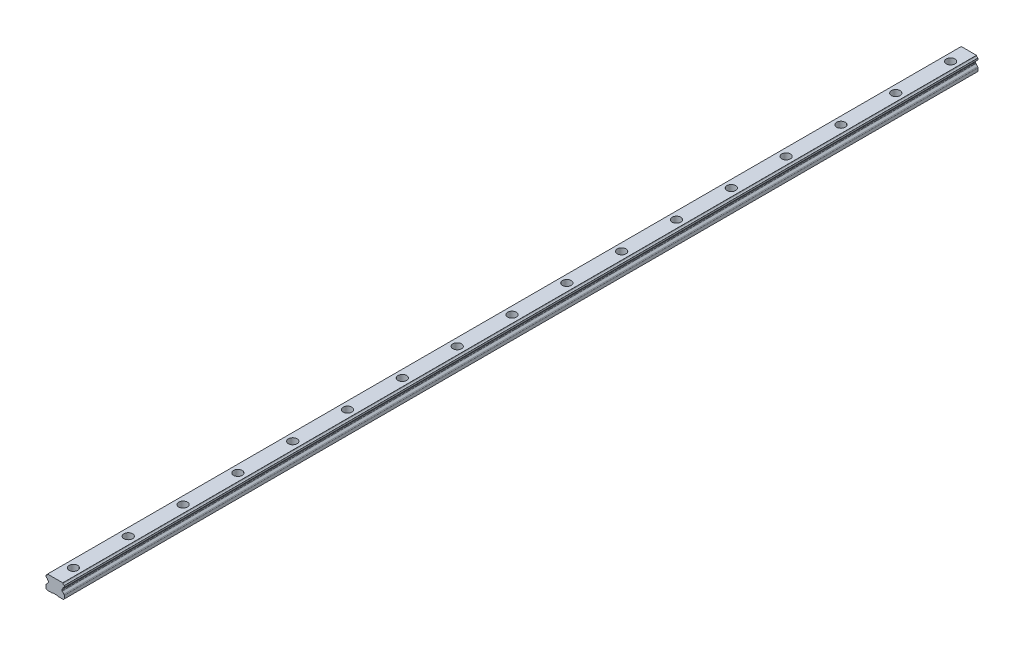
ISO-10303-21;
HEADER;
FILE_DESCRIPTION(('STEP AP214'),'2;1');
FILE_NAME('part.step','',(''),(''),'','','');
FILE_SCHEMA(('AUTOMOTIVE_DESIGN { 1 0 10303 214 1 1 1 1 }'));
ENDSEC;
DATA;
#1=APPLICATION_CONTEXT('core data for automotive mechanical design processes');
#2=APPLICATION_PROTOCOL_DEFINITION('international standard','automotive_design',2000,#1);
#3=PRODUCT_CONTEXT('',#1,'mechanical');
#4=PRODUCT('Part','Part','',(#3));
#5=PRODUCT_RELATED_PRODUCT_CATEGORY('part','',(#4));
#6=PRODUCT_DEFINITION_FORMATION('','',#4);
#7=PRODUCT_DEFINITION_CONTEXT('part definition',#1,'design');
#8=PRODUCT_DEFINITION('design','',#6,#7);
#9=PRODUCT_DEFINITION_SHAPE('','',#8);
#10=(LENGTH_UNIT() NAMED_UNIT(*) SI_UNIT(.MILLI.,.METRE.));
#11=(NAMED_UNIT(*) PLANE_ANGLE_UNIT() SI_UNIT($,.RADIAN.));
#12=(NAMED_UNIT(*) SI_UNIT($,.STERADIAN.) SOLID_ANGLE_UNIT());
#13=UNCERTAINTY_MEASURE_WITH_UNIT(LENGTH_MEASURE(1.E-05),#10,'distance_accuracy_value','');
#14=(GEOMETRIC_REPRESENTATION_CONTEXT(3) GLOBAL_UNCERTAINTY_ASSIGNED_CONTEXT((#13)) GLOBAL_UNIT_ASSIGNED_CONTEXT((#10,
#11,#12)) REPRESENTATION_CONTEXT('',''));
#15=CARTESIAN_POINT('',(0.,0.,0.));
#16=DIRECTION('',(0.,0.,1.));
#17=DIRECTION('',(1.,0.,0.));
#18=AXIS2_PLACEMENT_3D('',#15,#16,#17);
#19=CARTESIAN_POINT('',(-2.23546899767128,-6.99793718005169,1000.));
#20=DIRECTION('',(0.,1.,0.));
#21=DIRECTION('',(0.,0.,1.));
#22=AXIS2_PLACEMENT_3D('',#19,#20,#21);
#23=PLANE('',#22);
#24=DIRECTION('',(0.,0.,-1.));
#25=VECTOR('',#24,1.);
#26=CARTESIAN_POINT('',(2.76453100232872,-6.99793718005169,1000.));
#27=LINE('',#26,#25);
#28=CARTESIAN_POINT('',(2.76453100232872,-6.99793718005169,78.3416872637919));
#29=VERTEX_POINT('',#28);
#30=CARTESIAN_POINT('',(2.76453100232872,-6.99793718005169,21.658312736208));
#31=VERTEX_POINT('',#30);
#32=EDGE_CURVE('E623',#29,#31,#27,.T.);
#33=ORIENTED_EDGE('',*,*,#32,.F.);
#34=CARTESIAN_POINT('',(0.264531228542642,-6.99793718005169,79.9999999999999));
#35=DIRECTION('',(0.,1.,0.));
#36=DIRECTION('',(0.,0.,1.));
#37=AXIS2_PLACEMENT_3D('',#34,#35,#36);
#38=CIRCLE('',#37,3.);
#39=CARTESIAN_POINT('',(-2.23546899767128,-6.99793718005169,78.3416879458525));
#40=VERTEX_POINT('',#39);
#41=EDGE_CURVE('E61',#29,#40,#38,.T.);
#42=ORIENTED_EDGE('',*,*,#41,.T.);
#43=DIRECTION('',(0.,0.,-1.));
#44=VECTOR('',#43,1.);
#45=CARTESIAN_POINT('',(-2.23546899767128,-6.99793718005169,1000.));
#46=LINE('',#45,#44);
#47=CARTESIAN_POINT('',(-2.23546899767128,-6.99793718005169,21.6583120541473));
#48=VERTEX_POINT('',#47);
#49=EDGE_CURVE('E630',#40,#48,#46,.T.);
#50=ORIENTED_EDGE('',*,*,#49,.T.);
#51=CARTESIAN_POINT('',(0.264531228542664,-6.99793718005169,20.));
#52=DIRECTION('',(0.,1.,0.));
#53=DIRECTION('',(0.,0.,1.));
#54=AXIS2_PLACEMENT_3D('',#51,#52,#53);
#55=CIRCLE('',#54,3.);
#56=EDGE_CURVE('E1246',#48,#31,#55,.T.);
#57=ORIENTED_EDGE('',*,*,#56,.T.);
#58=EDGE_LOOP('',(#33,#42,#50,#57));
#59=FACE_BOUND('',#58,.T.);
#60=ADVANCED_FACE('F45',(#59),#23,.F.);
#61=CARTESIAN_POINT('',(-2.73546899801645,-7.49793718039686,1000.));
#62=DIRECTION('',(-0.707106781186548,0.707106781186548,0.));
#63=DIRECTION('',(-0.707106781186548,-0.707106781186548,0.));
#64=AXIS2_PLACEMENT_3D('',#61,#62,#63);
#65=PLANE('',#64);
#66=ORIENTED_EDGE('',*,*,#49,.F.);
#67=CARTESIAN_POINT('',(0.264531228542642,-4.49793695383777,79.9999999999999));
#68=DIRECTION('',(-0.707106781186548,0.707106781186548,0.));
#69=DIRECTION('',(0.707106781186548,0.707106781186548,0.));
#70=AXIS2_PLACEMENT_3D('',#67,#68,#69);
#71=ELLIPSE('',#70,4.24264068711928,3.);
#72=CARTESIAN_POINT('',(-2.73546877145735,-7.49793718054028,79.9999999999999));
#73=VERTEX_POINT('',#72);
#74=EDGE_CURVE('E1656',#40,#73,#71,.T.);
#75=ORIENTED_EDGE('',*,*,#74,.T.);
#76=DIRECTION('',(0.,0.,-1.));
#77=VECTOR('',#76,1.);
#78=CARTESIAN_POINT('',(-2.73546899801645,-7.49793718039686,1000.));
#79=LINE('',#78,#77);
#80=CARTESIAN_POINT('',(-2.73546877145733,-7.49793706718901,20.));
#81=VERTEX_POINT('',#80);
#82=EDGE_CURVE('E637',#73,#81,#79,.T.);
#83=ORIENTED_EDGE('',*,*,#82,.T.);
#84=CARTESIAN_POINT('',(0.264531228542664,-4.49793695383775,20.));
#85=DIRECTION('',(-0.707106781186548,0.707106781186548,0.));
#86=DIRECTION('',(0.707106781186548,0.707106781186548,0.));
#87=AXIS2_PLACEMENT_3D('',#84,#85,#86);
#88=ELLIPSE('',#87,4.24264068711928,3.);
#89=EDGE_CURVE('E1250',#81,#48,#88,.T.);
#90=ORIENTED_EDGE('',*,*,#89,.T.);
#91=EDGE_LOOP('',(#66,#75,#83,#90));
#92=FACE_BOUND('',#91,.T.);
#93=ADVANCED_FACE('F1655',(#92),#65,.F.);
#94=CARTESIAN_POINT('',(2.76453100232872,-6.99793718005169,1000.));
#95=DIRECTION('',(0.707106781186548,0.707106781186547,0.));
#96=DIRECTION('',(-0.707106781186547,0.707106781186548,0.));
#97=AXIS2_PLACEMENT_3D('',#94,#95,#96);
#98=PLANE('',#97);
#99=CARTESIAN_POINT('',(2.76453100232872,-6.99793718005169,138.341687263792));
#100=VERTEX_POINT('',#99);
#101=CARTESIAN_POINT('',(2.76453100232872,-6.99793718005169,81.6583127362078));
#102=VERTEX_POINT('',#101);
#103=EDGE_CURVE('E589',#100,#102,#27,.T.);
#104=ORIENTED_EDGE('',*,*,#103,.T.);
#105=CARTESIAN_POINT('',(0.264531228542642,-4.49793740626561,79.9999999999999));
#106=DIRECTION('',(0.707106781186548,0.707106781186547,0.));
#107=DIRECTION('',(-0.707106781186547,0.707106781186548,0.));
#108=AXIS2_PLACEMENT_3D('',#105,#106,#107);
#109=ELLIPSE('',#108,4.24264068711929,3.);
#110=CARTESIAN_POINT('',(3.26453122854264,-7.49793718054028,79.9999999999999));
#111=VERTEX_POINT('',#110);
#112=EDGE_CURVE('E573',#102,#111,#109,.T.);
#113=ORIENTED_EDGE('',*,*,#112,.T.);
#114=DIRECTION('',(0.,0.,-1.));
#115=VECTOR('',#114,1.);
#116=CARTESIAN_POINT('',(3.26453100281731,-7.49793718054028,1000.));
#117=LINE('',#116,#115);
#118=CARTESIAN_POINT('',(3.26453122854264,-7.49793718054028,140.));
#119=VERTEX_POINT('',#118);
#120=EDGE_CURVE('E586',#119,#111,#117,.T.);
#121=ORIENTED_EDGE('',*,*,#120,.F.);
#122=CARTESIAN_POINT('',(0.264531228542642,-4.49793740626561,140.));
#123=DIRECTION('',(0.707106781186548,0.707106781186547,0.));
#124=DIRECTION('',(-0.707106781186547,0.707106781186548,0.));
#125=AXIS2_PLACEMENT_3D('',#122,#123,#124);
#126=ELLIPSE('',#125,4.24264068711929,3.);
#127=EDGE_CURVE('E864',#119,#100,#126,.T.);
#128=ORIENTED_EDGE('',*,*,#127,.T.);
#129=EDGE_LOOP('',(#104,#113,#121,#128));
#130=FACE_BOUND('',#129,.T.);
#131=ADVANCED_FACE('F584',(#130),#98,.F.);
#132=CARTESIAN_POINT('',(-2.23546899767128,-6.99793718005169,138.341687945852));
#133=VERTEX_POINT('',#132);
#134=CARTESIAN_POINT('',(-2.23546899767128,-6.99793718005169,81.6583120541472));
#135=VERTEX_POINT('',#134);
#136=EDGE_CURVE('E1557',#133,#135,#46,.T.);
#137=ORIENTED_EDGE('',*,*,#136,.T.);
#138=EDGE_CURVE('E591',#135,#102,#38,.T.);
#139=ORIENTED_EDGE('',*,*,#138,.T.);
#140=ORIENTED_EDGE('',*,*,#103,.F.);
#141=CARTESIAN_POINT('',(0.264531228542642,-6.99793718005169,140.));
#142=DIRECTION('',(0.,1.,0.));
#143=DIRECTION('',(0.,0.,1.));
#144=AXIS2_PLACEMENT_3D('',#141,#142,#143);
#145=CIRCLE('',#144,3.);
#146=EDGE_CURVE('E69',#100,#133,#145,.T.);
#147=ORIENTED_EDGE('',*,*,#146,.T.);
#148=EDGE_LOOP('',(#137,#139,#140,#147));
#149=FACE_BOUND('',#148,.T.);
#150=ADVANCED_FACE('F1978',(#149),#23,.F.);
#151=CARTESIAN_POINT('',(-2.73546877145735,-7.49793718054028,140.));
#152=VERTEX_POINT('',#151);
#153=EDGE_CURVE('E1555',#152,#73,#79,.T.);
#154=ORIENTED_EDGE('',*,*,#153,.T.);
#155=EDGE_CURVE('E3389',#73,#135,#71,.T.);
#156=ORIENTED_EDGE('',*,*,#155,.T.);
#157=ORIENTED_EDGE('',*,*,#136,.F.);
#158=CARTESIAN_POINT('',(0.264531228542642,-4.49793695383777,140.));
#159=DIRECTION('',(-0.707106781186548,0.707106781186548,0.));
#160=DIRECTION('',(0.707106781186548,0.707106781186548,0.));
#161=AXIS2_PLACEMENT_3D('',#158,#159,#160);
#162=ELLIPSE('',#161,4.24264068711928,3.);
#163=EDGE_CURVE('E870',#133,#152,#162,.T.);
#164=ORIENTED_EDGE('',*,*,#163,.T.);
#165=EDGE_LOOP('',(#154,#156,#157,#164));
#166=FACE_BOUND('',#165,.T.);
#167=ADVANCED_FACE('F1553',(#166),#65,.F.);
#168=CARTESIAN_POINT('',(2.76453100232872,-6.99793718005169,198.341687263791));
#169=VERTEX_POINT('',#168);
#170=CARTESIAN_POINT('',(2.76453100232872,-6.99793718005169,141.658312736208));
#171=VERTEX_POINT('',#170);
#172=EDGE_CURVE('E834',#169,#171,#27,.T.);
#173=ORIENTED_EDGE('',*,*,#172,.T.);
#174=EDGE_CURVE('E847',#171,#119,#126,.T.);
#175=ORIENTED_EDGE('',*,*,#174,.T.);
#176=CARTESIAN_POINT('',(3.26453122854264,-7.49793718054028,199.999999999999));
#177=VERTEX_POINT('',#176);
#178=EDGE_CURVE('E605',#177,#119,#117,.T.);
#179=ORIENTED_EDGE('',*,*,#178,.F.);
#180=CARTESIAN_POINT('',(0.264531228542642,-4.49793740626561,199.999999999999));
#181=DIRECTION('',(0.707106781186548,0.707106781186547,0.));
#182=DIRECTION('',(-0.707106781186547,0.707106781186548,0.));
#183=AXIS2_PLACEMENT_3D('',#180,#181,#182);
#184=ELLIPSE('',#183,4.24264068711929,3.);
#185=EDGE_CURVE('E848',#177,#169,#184,.T.);
#186=ORIENTED_EDGE('',*,*,#185,.T.);
#187=EDGE_LOOP('',(#173,#175,#179,#186));
#188=FACE_BOUND('',#187,.T.);
#189=ADVANCED_FACE('F846',(#188),#98,.F.);
#190=CARTESIAN_POINT('',(-2.23546899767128,-6.99793718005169,198.341687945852));
#191=VERTEX_POINT('',#190);
#192=CARTESIAN_POINT('',(-2.23546899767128,-6.99793718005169,141.658312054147));
#193=VERTEX_POINT('',#192);
#194=EDGE_CURVE('E857',#191,#193,#46,.T.);
#195=ORIENTED_EDGE('',*,*,#194,.T.);
#196=EDGE_CURVE('E856',#193,#171,#145,.T.);
#197=ORIENTED_EDGE('',*,*,#196,.T.);
#198=ORIENTED_EDGE('',*,*,#172,.F.);
#199=CARTESIAN_POINT('',(0.264531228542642,-6.99793718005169,199.999999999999));
#200=DIRECTION('',(0.,1.,0.));
#201=DIRECTION('',(0.,0.,1.));
#202=AXIS2_PLACEMENT_3D('',#199,#200,#201);
#203=CIRCLE('',#202,3.);
#204=EDGE_CURVE('E854',#169,#191,#203,.T.);
#205=ORIENTED_EDGE('',*,*,#204,.T.);
#206=EDGE_LOOP('',(#195,#197,#198,#205));
#207=FACE_BOUND('',#206,.T.);
#208=ADVANCED_FACE('F853',(#207),#23,.F.);
#209=CARTESIAN_POINT('',(-2.73546877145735,-7.49793718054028,199.999999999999));
#210=VERTEX_POINT('',#209);
#211=EDGE_CURVE('E1564',#210,#152,#79,.T.);
#212=ORIENTED_EDGE('',*,*,#211,.T.);
#213=EDGE_CURVE('E863',#152,#193,#162,.T.);
#214=ORIENTED_EDGE('',*,*,#213,.T.);
#215=ORIENTED_EDGE('',*,*,#194,.F.);
#216=CARTESIAN_POINT('',(0.264531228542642,-4.49793695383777,199.999999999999));
#217=DIRECTION('',(-0.707106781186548,0.707106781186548,0.));
#218=DIRECTION('',(0.707106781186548,0.707106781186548,0.));
#219=AXIS2_PLACEMENT_3D('',#216,#217,#218);
#220=ELLIPSE('',#219,4.24264068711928,3.);
#221=EDGE_CURVE('E894',#191,#210,#220,.T.);
#222=ORIENTED_EDGE('',*,*,#221,.T.);
#223=EDGE_LOOP('',(#212,#214,#215,#222));
#224=FACE_BOUND('',#223,.T.);
#225=ADVANCED_FACE('F1570',(#224),#65,.F.);
#226=CARTESIAN_POINT('',(2.76453100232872,-6.99793718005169,258.341687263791));
#227=VERTEX_POINT('',#226);
#228=CARTESIAN_POINT('',(2.76453100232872,-6.99793718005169,201.658312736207));
#229=VERTEX_POINT('',#228);
#230=EDGE_CURVE('E827',#227,#229,#27,.T.);
#231=ORIENTED_EDGE('',*,*,#230,.T.);
#232=EDGE_CURVE('E885',#229,#177,#184,.T.);
#233=ORIENTED_EDGE('',*,*,#232,.T.);
#234=CARTESIAN_POINT('',(3.26453122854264,-7.49793718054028,259.999999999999));
#235=VERTEX_POINT('',#234);
#236=EDGE_CURVE('E608',#235,#177,#117,.T.);
#237=ORIENTED_EDGE('',*,*,#236,.F.);
#238=CARTESIAN_POINT('',(0.264531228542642,-4.49793740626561,259.999999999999));
#239=DIRECTION('',(0.707106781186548,0.707106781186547,0.));
#240=DIRECTION('',(-0.707106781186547,0.707106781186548,0.));
#241=AXIS2_PLACEMENT_3D('',#238,#239,#240);
#242=ELLIPSE('',#241,4.24264068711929,3.);
#243=EDGE_CURVE('E907',#235,#227,#242,.T.);
#244=ORIENTED_EDGE('',*,*,#243,.T.);
#245=EDGE_LOOP('',(#231,#233,#237,#244));
#246=FACE_BOUND('',#245,.T.);
#247=ADVANCED_FACE('F1543',(#246),#98,.F.);
#248=CARTESIAN_POINT('',(-2.23546899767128,-6.99793718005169,258.341687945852));
#249=VERTEX_POINT('',#248);
#250=CARTESIAN_POINT('',(-2.23546899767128,-6.99793718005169,201.658312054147));
#251=VERTEX_POINT('',#250);
#252=EDGE_CURVE('E1776',#249,#251,#46,.T.);
#253=ORIENTED_EDGE('',*,*,#252,.T.);
#254=EDGE_CURVE('E886',#251,#229,#203,.T.);
#255=ORIENTED_EDGE('',*,*,#254,.T.);
#256=ORIENTED_EDGE('',*,*,#230,.F.);
#257=CARTESIAN_POINT('',(0.264531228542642,-6.99793718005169,259.999999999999));
#258=DIRECTION('',(0.,1.,0.));
#259=DIRECTION('',(0.,0.,1.));
#260=AXIS2_PLACEMENT_3D('',#257,#258,#259);
#261=CIRCLE('',#260,3.);
#262=EDGE_CURVE('E915',#227,#249,#261,.T.);
#263=ORIENTED_EDGE('',*,*,#262,.T.);
#264=EDGE_LOOP('',(#253,#255,#256,#263));
#265=FACE_BOUND('',#264,.T.);
#266=ADVANCED_FACE('F2071',(#265),#23,.F.);
#267=CARTESIAN_POINT('',(-2.73546877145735,-7.49793718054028,259.999999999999));
#268=VERTEX_POINT('',#267);
#269=EDGE_CURVE('E1572',#268,#210,#79,.T.);
#270=ORIENTED_EDGE('',*,*,#269,.T.);
#271=EDGE_CURVE('E890',#210,#251,#220,.T.);
#272=ORIENTED_EDGE('',*,*,#271,.T.);
#273=ORIENTED_EDGE('',*,*,#252,.F.);
#274=CARTESIAN_POINT('',(0.264531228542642,-4.49793695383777,259.999999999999));
#275=DIRECTION('',(-0.707106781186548,0.707106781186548,0.));
#276=DIRECTION('',(0.707106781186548,0.707106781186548,0.));
#277=AXIS2_PLACEMENT_3D('',#274,#275,#276);
#278=ELLIPSE('',#277,4.24264068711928,3.);
#279=EDGE_CURVE('E920',#249,#268,#278,.T.);
#280=ORIENTED_EDGE('',*,*,#279,.T.);
#281=EDGE_LOOP('',(#270,#272,#273,#280));
#282=FACE_BOUND('',#281,.T.);
#283=ADVANCED_FACE('F2076',(#282),#65,.F.);
#284=CARTESIAN_POINT('',(2.76453100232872,-6.99793718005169,318.341687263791));
#285=VERTEX_POINT('',#284);
#286=CARTESIAN_POINT('',(2.76453100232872,-6.99793718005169,261.658312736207));
#287=VERTEX_POINT('',#286);
#288=EDGE_CURVE('E820',#285,#287,#27,.T.);
#289=ORIENTED_EDGE('',*,*,#288,.T.);
#290=EDGE_CURVE('E910',#287,#235,#242,.T.);
#291=ORIENTED_EDGE('',*,*,#290,.T.);
#292=CARTESIAN_POINT('',(3.26453122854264,-7.49793718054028,319.999999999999));
#293=VERTEX_POINT('',#292);
#294=EDGE_CURVE('E1536',#293,#235,#117,.T.);
#295=ORIENTED_EDGE('',*,*,#294,.F.);
#296=CARTESIAN_POINT('',(0.264531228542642,-4.49793740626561,319.999999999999));
#297=DIRECTION('',(0.707106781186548,0.707106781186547,0.));
#298=DIRECTION('',(-0.707106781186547,0.707106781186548,0.));
#299=AXIS2_PLACEMENT_3D('',#296,#297,#298);
#300=ELLIPSE('',#299,4.24264068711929,3.);
#301=EDGE_CURVE('E933',#293,#285,#300,.T.);
#302=ORIENTED_EDGE('',*,*,#301,.T.);
#303=EDGE_LOOP('',(#289,#291,#295,#302));
#304=FACE_BOUND('',#303,.T.);
#305=ADVANCED_FACE('F1715',(#304),#98,.F.);
#306=CARTESIAN_POINT('',(-2.23546899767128,-6.99793718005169,318.341687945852));
#307=VERTEX_POINT('',#306);
#308=CARTESIAN_POINT('',(-2.23546899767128,-6.99793718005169,261.658312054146));
#309=VERTEX_POINT('',#308);
#310=EDGE_CURVE('E1779',#307,#309,#46,.T.);
#311=ORIENTED_EDGE('',*,*,#310,.T.);
#312=EDGE_CURVE('E911',#309,#287,#261,.T.);
#313=ORIENTED_EDGE('',*,*,#312,.T.);
#314=ORIENTED_EDGE('',*,*,#288,.F.);
#315=CARTESIAN_POINT('',(0.264531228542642,-6.99793718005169,319.999999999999));
#316=DIRECTION('',(0.,1.,0.));
#317=DIRECTION('',(0.,0.,1.));
#318=AXIS2_PLACEMENT_3D('',#315,#316,#317);
#319=CIRCLE('',#318,3.);
#320=EDGE_CURVE('E941',#285,#307,#319,.T.);
#321=ORIENTED_EDGE('',*,*,#320,.T.);
#322=EDGE_LOOP('',(#311,#313,#314,#321));
#323=FACE_BOUND('',#322,.T.);
#324=ADVANCED_FACE('F2064',(#323),#23,.F.);
#325=CARTESIAN_POINT('',(-2.73546877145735,-7.49793718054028,319.999999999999));
#326=VERTEX_POINT('',#325);
#327=EDGE_CURVE('E1574',#326,#268,#79,.T.);
#328=ORIENTED_EDGE('',*,*,#327,.T.);
#329=EDGE_CURVE('E916',#268,#309,#278,.T.);
#330=ORIENTED_EDGE('',*,*,#329,.T.);
#331=ORIENTED_EDGE('',*,*,#310,.F.);
#332=CARTESIAN_POINT('',(0.264531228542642,-4.49793695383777,319.999999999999));
#333=DIRECTION('',(-0.707106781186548,0.707106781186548,0.));
#334=DIRECTION('',(0.707106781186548,0.707106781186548,0.));
#335=AXIS2_PLACEMENT_3D('',#332,#333,#334);
#336=ELLIPSE('',#335,4.24264068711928,3.);
#337=EDGE_CURVE('E946',#307,#326,#336,.T.);
#338=ORIENTED_EDGE('',*,*,#337,.T.);
#339=EDGE_LOOP('',(#328,#330,#331,#338));
#340=FACE_BOUND('',#339,.T.);
#341=ADVANCED_FACE('F2069',(#340),#65,.F.);
#342=CARTESIAN_POINT('',(2.76453100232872,-6.99793718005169,378.341687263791));
#343=VERTEX_POINT('',#342);
#344=CARTESIAN_POINT('',(2.76453100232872,-6.99793718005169,321.658312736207));
#345=VERTEX_POINT('',#344);
#346=EDGE_CURVE('E813',#343,#345,#27,.T.);
#347=ORIENTED_EDGE('',*,*,#346,.T.);
#348=EDGE_CURVE('E936',#345,#293,#300,.T.);
#349=ORIENTED_EDGE('',*,*,#348,.T.);
#350=CARTESIAN_POINT('',(3.26453122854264,-7.49793718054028,379.999999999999));
#351=VERTEX_POINT('',#350);
#352=EDGE_CURVE('E1532',#351,#293,#117,.T.);
#353=ORIENTED_EDGE('',*,*,#352,.F.);
#354=CARTESIAN_POINT('',(0.264531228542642,-4.49793740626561,379.999999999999));
#355=DIRECTION('',(0.707106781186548,0.707106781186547,0.));
#356=DIRECTION('',(-0.707106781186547,0.707106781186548,0.));
#357=AXIS2_PLACEMENT_3D('',#354,#355,#356);
#358=ELLIPSE('',#357,4.24264068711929,3.);
#359=EDGE_CURVE('E959',#351,#343,#358,.T.);
#360=ORIENTED_EDGE('',*,*,#359,.T.);
#361=EDGE_LOOP('',(#347,#349,#353,#360));
#362=FACE_BOUND('',#361,.T.);
#363=ADVANCED_FACE('F1712',(#362),#98,.F.);
#364=CARTESIAN_POINT('',(-2.23546899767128,-6.99793718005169,378.341687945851));
#365=VERTEX_POINT('',#364);
#366=CARTESIAN_POINT('',(-2.23546899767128,-6.99793718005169,321.658312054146));
#367=VERTEX_POINT('',#366);
#368=EDGE_CURVE('E1784',#365,#367,#46,.T.);
#369=ORIENTED_EDGE('',*,*,#368,.T.);
#370=EDGE_CURVE('E937',#367,#345,#319,.T.);
#371=ORIENTED_EDGE('',*,*,#370,.T.);
#372=ORIENTED_EDGE('',*,*,#346,.F.);
#373=CARTESIAN_POINT('',(0.264531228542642,-6.99793718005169,379.999999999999));
#374=DIRECTION('',(0.,1.,0.));
#375=DIRECTION('',(0.,0.,1.));
#376=AXIS2_PLACEMENT_3D('',#373,#374,#375);
#377=CIRCLE('',#376,3.);
#378=EDGE_CURVE('E967',#343,#365,#377,.T.);
#379=ORIENTED_EDGE('',*,*,#378,.T.);
#380=EDGE_LOOP('',(#369,#371,#372,#379));
#381=FACE_BOUND('',#380,.T.);
#382=ADVANCED_FACE('F2057',(#381),#23,.F.);
#383=CARTESIAN_POINT('',(-2.73546877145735,-7.49793718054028,379.999999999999));
#384=VERTEX_POINT('',#383);
#385=EDGE_CURVE('E1579',#384,#326,#79,.T.);
#386=ORIENTED_EDGE('',*,*,#385,.T.);
#387=EDGE_CURVE('E942',#326,#367,#336,.T.);
#388=ORIENTED_EDGE('',*,*,#387,.T.);
#389=ORIENTED_EDGE('',*,*,#368,.F.);
#390=CARTESIAN_POINT('',(0.264531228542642,-4.49793695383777,379.999999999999));
#391=DIRECTION('',(-0.707106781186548,0.707106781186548,0.));
#392=DIRECTION('',(0.707106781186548,0.707106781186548,0.));
#393=AXIS2_PLACEMENT_3D('',#390,#391,#392);
#394=ELLIPSE('',#393,4.24264068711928,3.);
#395=EDGE_CURVE('E972',#365,#384,#394,.T.);
#396=ORIENTED_EDGE('',*,*,#395,.T.);
#397=EDGE_LOOP('',(#386,#388,#389,#396));
#398=FACE_BOUND('',#397,.T.);
#399=ADVANCED_FACE('F2062',(#398),#65,.F.);
#400=CARTESIAN_POINT('',(2.76453100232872,-6.99793718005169,438.34168726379));
#401=VERTEX_POINT('',#400);
#402=CARTESIAN_POINT('',(2.76453100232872,-6.99793718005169,381.658312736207));
#403=VERTEX_POINT('',#402);
#404=EDGE_CURVE('E806',#401,#403,#27,.T.);
#405=ORIENTED_EDGE('',*,*,#404,.T.);
#406=EDGE_CURVE('E962',#403,#351,#358,.T.);
#407=ORIENTED_EDGE('',*,*,#406,.T.);
#408=CARTESIAN_POINT('',(3.26453122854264,-7.49793718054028,439.999999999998));
#409=VERTEX_POINT('',#408);
#410=EDGE_CURVE('E1528',#409,#351,#117,.T.);
#411=ORIENTED_EDGE('',*,*,#410,.F.);
#412=CARTESIAN_POINT('',(0.264531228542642,-4.49793740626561,439.999999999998));
#413=DIRECTION('',(0.707106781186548,0.707106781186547,0.));
#414=DIRECTION('',(-0.707106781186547,0.707106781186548,0.));
#415=AXIS2_PLACEMENT_3D('',#412,#413,#414);
#416=ELLIPSE('',#415,4.24264068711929,3.);
#417=EDGE_CURVE('E985',#409,#401,#416,.T.);
#418=ORIENTED_EDGE('',*,*,#417,.T.);
#419=EDGE_LOOP('',(#405,#407,#411,#418));
#420=FACE_BOUND('',#419,.T.);
#421=ADVANCED_FACE('F1709',(#420),#98,.F.);
#422=CARTESIAN_POINT('',(-2.23546899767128,-6.99793718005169,438.341687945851));
#423=VERTEX_POINT('',#422);
#424=CARTESIAN_POINT('',(-2.23546899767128,-6.99793718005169,381.658312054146));
#425=VERTEX_POINT('',#424);
#426=EDGE_CURVE('E1789',#423,#425,#46,.T.);
#427=ORIENTED_EDGE('',*,*,#426,.T.);
#428=EDGE_CURVE('E963',#425,#403,#377,.T.);
#429=ORIENTED_EDGE('',*,*,#428,.T.);
#430=ORIENTED_EDGE('',*,*,#404,.F.);
#431=CARTESIAN_POINT('',(0.264531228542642,-6.99793718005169,439.999999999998));
#432=DIRECTION('',(0.,1.,0.));
#433=DIRECTION('',(0.,0.,1.));
#434=AXIS2_PLACEMENT_3D('',#431,#432,#433);
#435=CIRCLE('',#434,3.);
#436=EDGE_CURVE('E993',#401,#423,#435,.T.);
#437=ORIENTED_EDGE('',*,*,#436,.T.);
#438=EDGE_LOOP('',(#427,#429,#430,#437));
#439=FACE_BOUND('',#438,.T.);
#440=ADVANCED_FACE('F2050',(#439),#23,.F.);
#441=CARTESIAN_POINT('',(-2.73546877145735,-7.49793718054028,439.999999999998));
#442=VERTEX_POINT('',#441);
#443=EDGE_CURVE('E1585',#442,#384,#79,.T.);
#444=ORIENTED_EDGE('',*,*,#443,.T.);
#445=EDGE_CURVE('E968',#384,#425,#394,.T.);
#446=ORIENTED_EDGE('',*,*,#445,.T.);
#447=ORIENTED_EDGE('',*,*,#426,.F.);
#448=CARTESIAN_POINT('',(0.264531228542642,-4.49793695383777,439.999999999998));
#449=DIRECTION('',(-0.707106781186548,0.707106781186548,0.));
#450=DIRECTION('',(0.707106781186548,0.707106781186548,0.));
#451=AXIS2_PLACEMENT_3D('',#448,#449,#450);
#452=ELLIPSE('',#451,4.24264068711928,3.);
#453=EDGE_CURVE('E998',#423,#442,#452,.T.);
#454=ORIENTED_EDGE('',*,*,#453,.T.);
#455=EDGE_LOOP('',(#444,#446,#447,#454));
#456=FACE_BOUND('',#455,.T.);
#457=ADVANCED_FACE('F2055',(#456),#65,.F.);
#458=CARTESIAN_POINT('',(2.76453100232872,-6.99793718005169,498.34168726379));
#459=VERTEX_POINT('',#458);
#460=CARTESIAN_POINT('',(2.76453100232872,-6.99793718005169,441.658312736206));
#461=VERTEX_POINT('',#460);
#462=EDGE_CURVE('E799',#459,#461,#27,.T.);
#463=ORIENTED_EDGE('',*,*,#462,.T.);
#464=EDGE_CURVE('E988',#461,#409,#416,.T.);
#465=ORIENTED_EDGE('',*,*,#464,.T.);
#466=CARTESIAN_POINT('',(3.26453122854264,-7.49793718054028,499.999999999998));
#467=VERTEX_POINT('',#466);
#468=EDGE_CURVE('E1524',#467,#409,#117,.T.);
#469=ORIENTED_EDGE('',*,*,#468,.F.);
#470=CARTESIAN_POINT('',(0.264531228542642,-4.49793740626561,499.999999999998));
#471=DIRECTION('',(0.707106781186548,0.707106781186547,0.));
#472=DIRECTION('',(-0.707106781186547,0.707106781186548,0.));
#473=AXIS2_PLACEMENT_3D('',#470,#471,#472);
#474=ELLIPSE('',#473,4.24264068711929,3.);
#475=EDGE_CURVE('E1011',#467,#459,#474,.T.);
#476=ORIENTED_EDGE('',*,*,#475,.T.);
#477=EDGE_LOOP('',(#463,#465,#469,#476));
#478=FACE_BOUND('',#477,.T.);
#479=ADVANCED_FACE('F1706',(#478),#98,.F.);
#480=CARTESIAN_POINT('',(-2.23546899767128,-6.99793718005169,498.341687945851));
#481=VERTEX_POINT('',#480);
#482=CARTESIAN_POINT('',(-2.23546899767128,-6.99793718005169,441.658312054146));
#483=VERTEX_POINT('',#482);
#484=EDGE_CURVE('E1794',#481,#483,#46,.T.);
#485=ORIENTED_EDGE('',*,*,#484,.T.);
#486=EDGE_CURVE('E989',#483,#461,#435,.T.);
#487=ORIENTED_EDGE('',*,*,#486,.T.);
#488=ORIENTED_EDGE('',*,*,#462,.F.);
#489=CARTESIAN_POINT('',(0.264531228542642,-6.99793718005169,499.999999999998));
#490=DIRECTION('',(0.,1.,0.));
#491=DIRECTION('',(0.,0.,1.));
#492=AXIS2_PLACEMENT_3D('',#489,#490,#491);
#493=CIRCLE('',#492,3.);
#494=EDGE_CURVE('E1019',#459,#481,#493,.T.);
#495=ORIENTED_EDGE('',*,*,#494,.T.);
#496=EDGE_LOOP('',(#485,#487,#488,#495));
#497=FACE_BOUND('',#496,.T.);
#498=ADVANCED_FACE('F2043',(#497),#23,.F.);
#499=CARTESIAN_POINT('',(-2.73546877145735,-7.49793718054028,499.999999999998));
#500=VERTEX_POINT('',#499);
#501=EDGE_CURVE('E1591',#500,#442,#79,.T.);
#502=ORIENTED_EDGE('',*,*,#501,.T.);
#503=EDGE_CURVE('E994',#442,#483,#452,.T.);
#504=ORIENTED_EDGE('',*,*,#503,.T.);
#505=ORIENTED_EDGE('',*,*,#484,.F.);
#506=CARTESIAN_POINT('',(0.264531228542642,-4.49793695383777,499.999999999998));
#507=DIRECTION('',(-0.707106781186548,0.707106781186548,0.));
#508=DIRECTION('',(0.707106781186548,0.707106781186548,0.));
#509=AXIS2_PLACEMENT_3D('',#506,#507,#508);
#510=ELLIPSE('',#509,4.24264068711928,3.);
#511=EDGE_CURVE('E1024',#481,#500,#510,.T.);
#512=ORIENTED_EDGE('',*,*,#511,.T.);
#513=EDGE_LOOP('',(#502,#504,#505,#512));
#514=FACE_BOUND('',#513,.T.);
#515=ADVANCED_FACE('F2048',(#514),#65,.F.);
#516=CARTESIAN_POINT('',(2.76453100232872,-6.99793718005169,558.34168726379));
#517=VERTEX_POINT('',#516);
#518=CARTESIAN_POINT('',(2.76453100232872,-6.99793718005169,501.658312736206));
#519=VERTEX_POINT('',#518);
#520=EDGE_CURVE('E792',#517,#519,#27,.T.);
#521=ORIENTED_EDGE('',*,*,#520,.T.);
#522=EDGE_CURVE('E1014',#519,#467,#474,.T.);
#523=ORIENTED_EDGE('',*,*,#522,.T.);
#524=CARTESIAN_POINT('',(3.26453122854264,-7.49793718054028,559.999999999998));
#525=VERTEX_POINT('',#524);
#526=EDGE_CURVE('E1520',#525,#467,#117,.T.);
#527=ORIENTED_EDGE('',*,*,#526,.F.);
#528=CARTESIAN_POINT('',(0.264531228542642,-4.49793740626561,559.999999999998));
#529=DIRECTION('',(0.707106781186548,0.707106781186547,0.));
#530=DIRECTION('',(-0.707106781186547,0.707106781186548,0.));
#531=AXIS2_PLACEMENT_3D('',#528,#529,#530);
#532=ELLIPSE('',#531,4.24264068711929,3.);
#533=EDGE_CURVE('E1037',#525,#517,#532,.T.);
#534=ORIENTED_EDGE('',*,*,#533,.T.);
#535=EDGE_LOOP('',(#521,#523,#527,#534));
#536=FACE_BOUND('',#535,.T.);
#537=ADVANCED_FACE('F1703',(#536),#98,.F.);
#538=CARTESIAN_POINT('',(-2.23546899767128,-6.99793718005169,558.341687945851));
#539=VERTEX_POINT('',#538);
#540=CARTESIAN_POINT('',(-2.23546899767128,-6.99793718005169,501.658312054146));
#541=VERTEX_POINT('',#540);
#542=EDGE_CURVE('E1799',#539,#541,#46,.T.);
#543=ORIENTED_EDGE('',*,*,#542,.T.);
#544=EDGE_CURVE('E1015',#541,#519,#493,.T.);
#545=ORIENTED_EDGE('',*,*,#544,.T.);
#546=ORIENTED_EDGE('',*,*,#520,.F.);
#547=CARTESIAN_POINT('',(0.264531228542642,-6.99793718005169,559.999999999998));
#548=DIRECTION('',(0.,1.,0.));
#549=DIRECTION('',(0.,0.,1.));
#550=AXIS2_PLACEMENT_3D('',#547,#548,#549);
#551=CIRCLE('',#550,3.);
#552=EDGE_CURVE('E1045',#517,#539,#551,.T.);
#553=ORIENTED_EDGE('',*,*,#552,.T.);
#554=EDGE_LOOP('',(#543,#545,#546,#553));
#555=FACE_BOUND('',#554,.T.);
#556=ADVANCED_FACE('F2036',(#555),#23,.F.);
#557=CARTESIAN_POINT('',(-2.73546877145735,-7.49793718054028,559.999999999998));
#558=VERTEX_POINT('',#557);
#559=EDGE_CURVE('E1597',#558,#500,#79,.T.);
#560=ORIENTED_EDGE('',*,*,#559,.T.);
#561=EDGE_CURVE('E1020',#500,#541,#510,.T.);
#562=ORIENTED_EDGE('',*,*,#561,.T.);
#563=ORIENTED_EDGE('',*,*,#542,.F.);
#564=CARTESIAN_POINT('',(0.264531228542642,-4.49793695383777,559.999999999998));
#565=DIRECTION('',(-0.707106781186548,0.707106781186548,0.));
#566=DIRECTION('',(0.707106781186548,0.707106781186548,0.));
#567=AXIS2_PLACEMENT_3D('',#564,#565,#566);
#568=ELLIPSE('',#567,4.24264068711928,3.);
#569=EDGE_CURVE('E1050',#539,#558,#568,.T.);
#570=ORIENTED_EDGE('',*,*,#569,.T.);
#571=EDGE_LOOP('',(#560,#562,#563,#570));
#572=FACE_BOUND('',#571,.T.);
#573=ADVANCED_FACE('F2041',(#572),#65,.F.);
#574=CARTESIAN_POINT('',(2.76453100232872,-6.99793718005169,618.34168726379));
#575=VERTEX_POINT('',#574);
#576=CARTESIAN_POINT('',(2.76453100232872,-6.99793718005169,561.658312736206));
#577=VERTEX_POINT('',#576);
#578=EDGE_CURVE('E785',#575,#577,#27,.T.);
#579=ORIENTED_EDGE('',*,*,#578,.T.);
#580=EDGE_CURVE('E1040',#577,#525,#532,.T.);
#581=ORIENTED_EDGE('',*,*,#580,.T.);
#582=CARTESIAN_POINT('',(3.26453122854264,-7.49793718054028,619.999999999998));
#583=VERTEX_POINT('',#582);
#584=EDGE_CURVE('E1516',#583,#525,#117,.T.);
#585=ORIENTED_EDGE('',*,*,#584,.F.);
#586=CARTESIAN_POINT('',(0.264531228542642,-4.49793740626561,619.999999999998));
#587=DIRECTION('',(0.707106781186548,0.707106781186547,0.));
#588=DIRECTION('',(-0.707106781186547,0.707106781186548,0.));
#589=AXIS2_PLACEMENT_3D('',#586,#587,#588);
#590=ELLIPSE('',#589,4.24264068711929,3.);
#591=EDGE_CURVE('E1063',#583,#575,#590,.T.);
#592=ORIENTED_EDGE('',*,*,#591,.T.);
#593=EDGE_LOOP('',(#579,#581,#585,#592));
#594=FACE_BOUND('',#593,.T.);
#595=ADVANCED_FACE('F1700',(#594),#98,.F.);
#596=CARTESIAN_POINT('',(-2.23546899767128,-6.99793718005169,618.34168794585));
#597=VERTEX_POINT('',#596);
#598=CARTESIAN_POINT('',(-2.23546899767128,-6.99793718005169,561.658312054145));
#599=VERTEX_POINT('',#598);
#600=EDGE_CURVE('E1804',#597,#599,#46,.T.);
#601=ORIENTED_EDGE('',*,*,#600,.T.);
#602=EDGE_CURVE('E1041',#599,#577,#551,.T.);
#603=ORIENTED_EDGE('',*,*,#602,.T.);
#604=ORIENTED_EDGE('',*,*,#578,.F.);
#605=CARTESIAN_POINT('',(0.264531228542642,-6.99793718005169,619.999999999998));
#606=DIRECTION('',(0.,1.,0.));
#607=DIRECTION('',(0.,0.,1.));
#608=AXIS2_PLACEMENT_3D('',#605,#606,#607);
#609=CIRCLE('',#608,3.);
#610=EDGE_CURVE('E1071',#575,#597,#609,.T.);
#611=ORIENTED_EDGE('',*,*,#610,.T.);
#612=EDGE_LOOP('',(#601,#603,#604,#611));
#613=FACE_BOUND('',#612,.T.);
#614=ADVANCED_FACE('F2029',(#613),#23,.F.);
#615=CARTESIAN_POINT('',(-2.73546877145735,-7.49793718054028,619.999999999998));
#616=VERTEX_POINT('',#615);
#617=EDGE_CURVE('E1603',#616,#558,#79,.T.);
#618=ORIENTED_EDGE('',*,*,#617,.T.);
#619=EDGE_CURVE('E1046',#558,#599,#568,.T.);
#620=ORIENTED_EDGE('',*,*,#619,.T.);
#621=ORIENTED_EDGE('',*,*,#600,.F.);
#622=CARTESIAN_POINT('',(0.264531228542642,-4.49793695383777,619.999999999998));
#623=DIRECTION('',(-0.707106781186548,0.707106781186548,0.));
#624=DIRECTION('',(0.707106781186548,0.707106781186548,0.));
#625=AXIS2_PLACEMENT_3D('',#622,#623,#624);
#626=ELLIPSE('',#625,4.24264068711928,3.);
#627=EDGE_CURVE('E1076',#597,#616,#626,.T.);
#628=ORIENTED_EDGE('',*,*,#627,.T.);
#629=EDGE_LOOP('',(#618,#620,#621,#628));
#630=FACE_BOUND('',#629,.T.);
#631=ADVANCED_FACE('F2034',(#630),#65,.F.);
#632=CARTESIAN_POINT('',(2.76453100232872,-6.99793718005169,678.341687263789));
#633=VERTEX_POINT('',#632);
#634=CARTESIAN_POINT('',(2.76453100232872,-6.99793718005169,621.658312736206));
#635=VERTEX_POINT('',#634);
#636=EDGE_CURVE('E778',#633,#635,#27,.T.);
#637=ORIENTED_EDGE('',*,*,#636,.T.);
#638=EDGE_CURVE('E1066',#635,#583,#590,.T.);
#639=ORIENTED_EDGE('',*,*,#638,.T.);
#640=CARTESIAN_POINT('',(3.26453122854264,-7.49793718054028,679.999999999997));
#641=VERTEX_POINT('',#640);
#642=EDGE_CURVE('E1512',#641,#583,#117,.T.);
#643=ORIENTED_EDGE('',*,*,#642,.F.);
#644=CARTESIAN_POINT('',(0.264531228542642,-4.49793740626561,679.999999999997));
#645=DIRECTION('',(0.707106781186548,0.707106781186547,0.));
#646=DIRECTION('',(-0.707106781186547,0.707106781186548,0.));
#647=AXIS2_PLACEMENT_3D('',#644,#645,#646);
#648=ELLIPSE('',#647,4.24264068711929,3.);
#649=EDGE_CURVE('E1089',#641,#633,#648,.T.);
#650=ORIENTED_EDGE('',*,*,#649,.T.);
#651=EDGE_LOOP('',(#637,#639,#643,#650));
#652=FACE_BOUND('',#651,.T.);
#653=ADVANCED_FACE('F1697',(#652),#98,.F.);
#654=CARTESIAN_POINT('',(-2.23546899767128,-6.99793718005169,678.34168794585));
#655=VERTEX_POINT('',#654);
#656=CARTESIAN_POINT('',(-2.23546899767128,-6.99793718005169,621.658312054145));
#657=VERTEX_POINT('',#656);
#658=EDGE_CURVE('E1809',#655,#657,#46,.T.);
#659=ORIENTED_EDGE('',*,*,#658,.T.);
#660=EDGE_CURVE('E1067',#657,#635,#609,.T.);
#661=ORIENTED_EDGE('',*,*,#660,.T.);
#662=ORIENTED_EDGE('',*,*,#636,.F.);
#663=CARTESIAN_POINT('',(0.264531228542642,-6.99793718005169,679.999999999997));
#664=DIRECTION('',(0.,1.,0.));
#665=DIRECTION('',(0.,0.,1.));
#666=AXIS2_PLACEMENT_3D('',#663,#664,#665);
#667=CIRCLE('',#666,3.);
#668=EDGE_CURVE('E1097',#633,#655,#667,.T.);
#669=ORIENTED_EDGE('',*,*,#668,.T.);
#670=EDGE_LOOP('',(#659,#661,#662,#669));
#671=FACE_BOUND('',#670,.T.);
#672=ADVANCED_FACE('F2022',(#671),#23,.F.);
#673=CARTESIAN_POINT('',(-2.73546877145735,-7.49793718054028,679.999999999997));
#674=VERTEX_POINT('',#673);
#675=EDGE_CURVE('E1609',#674,#616,#79,.T.);
#676=ORIENTED_EDGE('',*,*,#675,.T.);
#677=EDGE_CURVE('E1072',#616,#657,#626,.T.);
#678=ORIENTED_EDGE('',*,*,#677,.T.);
#679=ORIENTED_EDGE('',*,*,#658,.F.);
#680=CARTESIAN_POINT('',(0.264531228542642,-4.49793695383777,679.999999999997));
#681=DIRECTION('',(-0.707106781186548,0.707106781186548,0.));
#682=DIRECTION('',(0.707106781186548,0.707106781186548,0.));
#683=AXIS2_PLACEMENT_3D('',#680,#681,#682);
#684=ELLIPSE('',#683,4.24264068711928,3.);
#685=EDGE_CURVE('E1102',#655,#674,#684,.T.);
#686=ORIENTED_EDGE('',*,*,#685,.T.);
#687=EDGE_LOOP('',(#676,#678,#679,#686));
#688=FACE_BOUND('',#687,.T.);
#689=ADVANCED_FACE('F2027',(#688),#65,.F.);
#690=CARTESIAN_POINT('',(2.76453100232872,-6.99793718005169,738.341687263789));
#691=VERTEX_POINT('',#690);
#692=CARTESIAN_POINT('',(2.76453100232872,-6.99793718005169,681.658312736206));
#693=VERTEX_POINT('',#692);
#694=EDGE_CURVE('E771',#691,#693,#27,.T.);
#695=ORIENTED_EDGE('',*,*,#694,.T.);
#696=EDGE_CURVE('E1092',#693,#641,#648,.T.);
#697=ORIENTED_EDGE('',*,*,#696,.T.);
#698=CARTESIAN_POINT('',(3.26453122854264,-7.49793718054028,739.999999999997));
#699=VERTEX_POINT('',#698);
#700=EDGE_CURVE('E1508',#699,#641,#117,.T.);
#701=ORIENTED_EDGE('',*,*,#700,.F.);
#702=CARTESIAN_POINT('',(0.264531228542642,-4.49793740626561,739.999999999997));
#703=DIRECTION('',(0.707106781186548,0.707106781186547,0.));
#704=DIRECTION('',(-0.707106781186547,0.707106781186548,0.));
#705=AXIS2_PLACEMENT_3D('',#702,#703,#704);
#706=ELLIPSE('',#705,4.24264068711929,3.);
#707=EDGE_CURVE('E1115',#699,#691,#706,.T.);
#708=ORIENTED_EDGE('',*,*,#707,.T.);
#709=EDGE_LOOP('',(#695,#697,#701,#708));
#710=FACE_BOUND('',#709,.T.);
#711=ADVANCED_FACE('F1694',(#710),#98,.F.);
#712=CARTESIAN_POINT('',(-2.23546899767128,-6.99793718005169,738.34168794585));
#713=VERTEX_POINT('',#712);
#714=CARTESIAN_POINT('',(-2.23546899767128,-6.99793718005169,681.658312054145));
#715=VERTEX_POINT('',#714);
#716=EDGE_CURVE('E1814',#713,#715,#46,.T.);
#717=ORIENTED_EDGE('',*,*,#716,.T.);
#718=EDGE_CURVE('E1093',#715,#693,#667,.T.);
#719=ORIENTED_EDGE('',*,*,#718,.T.);
#720=ORIENTED_EDGE('',*,*,#694,.F.);
#721=CARTESIAN_POINT('',(0.264531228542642,-6.99793718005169,739.999999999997));
#722=DIRECTION('',(0.,1.,0.));
#723=DIRECTION('',(0.,0.,1.));
#724=AXIS2_PLACEMENT_3D('',#721,#722,#723);
#725=CIRCLE('',#724,3.);
#726=EDGE_CURVE('E1123',#691,#713,#725,.T.);
#727=ORIENTED_EDGE('',*,*,#726,.T.);
#728=EDGE_LOOP('',(#717,#719,#720,#727));
#729=FACE_BOUND('',#728,.T.);
#730=ADVANCED_FACE('F2015',(#729),#23,.F.);
#731=CARTESIAN_POINT('',(-2.73546877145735,-7.49793718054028,739.999999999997));
#732=VERTEX_POINT('',#731);
#733=EDGE_CURVE('E1615',#732,#674,#79,.T.);
#734=ORIENTED_EDGE('',*,*,#733,.T.);
#735=EDGE_CURVE('E1098',#674,#715,#684,.T.);
#736=ORIENTED_EDGE('',*,*,#735,.T.);
#737=ORIENTED_EDGE('',*,*,#716,.F.);
#738=CARTESIAN_POINT('',(0.264531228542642,-4.49793695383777,739.999999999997));
#739=DIRECTION('',(-0.707106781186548,0.707106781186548,0.));
#740=DIRECTION('',(0.707106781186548,0.707106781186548,0.));
#741=AXIS2_PLACEMENT_3D('',#738,#739,#740);
#742=ELLIPSE('',#741,4.24264068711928,3.);
#743=EDGE_CURVE('E1128',#713,#732,#742,.T.);
#744=ORIENTED_EDGE('',*,*,#743,.T.);
#745=EDGE_LOOP('',(#734,#736,#737,#744));
#746=FACE_BOUND('',#745,.T.);
#747=ADVANCED_FACE('F2020',(#746),#65,.F.);
#748=CARTESIAN_POINT('',(2.76453100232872,-6.99793718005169,798.341687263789));
#749=VERTEX_POINT('',#748);
#750=CARTESIAN_POINT('',(2.76453100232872,-6.99793718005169,741.658312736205));
#751=VERTEX_POINT('',#750);
#752=EDGE_CURVE('E764',#749,#751,#27,.T.);
#753=ORIENTED_EDGE('',*,*,#752,.T.);
#754=EDGE_CURVE('E1118',#751,#699,#706,.T.);
#755=ORIENTED_EDGE('',*,*,#754,.T.);
#756=CARTESIAN_POINT('',(3.26453122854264,-7.49793718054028,799.999999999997));
#757=VERTEX_POINT('',#756);
#758=EDGE_CURVE('E1504',#757,#699,#117,.T.);
#759=ORIENTED_EDGE('',*,*,#758,.F.);
#760=CARTESIAN_POINT('',(0.264531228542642,-4.49793740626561,799.999999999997));
#761=DIRECTION('',(0.707106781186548,0.707106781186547,0.));
#762=DIRECTION('',(-0.707106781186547,0.707106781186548,0.));
#763=AXIS2_PLACEMENT_3D('',#760,#761,#762);
#764=ELLIPSE('',#763,4.24264068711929,3.);
#765=EDGE_CURVE('E1141',#757,#749,#764,.T.);
#766=ORIENTED_EDGE('',*,*,#765,.T.);
#767=EDGE_LOOP('',(#753,#755,#759,#766));
#768=FACE_BOUND('',#767,.T.);
#769=ADVANCED_FACE('F1691',(#768),#98,.F.);
#770=CARTESIAN_POINT('',(-2.23546899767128,-6.99793718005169,798.34168794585));
#771=VERTEX_POINT('',#770);
#772=CARTESIAN_POINT('',(-2.23546899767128,-6.99793718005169,741.658312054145));
#773=VERTEX_POINT('',#772);
#774=EDGE_CURVE('E1819',#771,#773,#46,.T.);
#775=ORIENTED_EDGE('',*,*,#774,.T.);
#776=EDGE_CURVE('E1119',#773,#751,#725,.T.);
#777=ORIENTED_EDGE('',*,*,#776,.T.);
#778=ORIENTED_EDGE('',*,*,#752,.F.);
#779=CARTESIAN_POINT('',(0.264531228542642,-6.99793718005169,799.999999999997));
#780=DIRECTION('',(0.,1.,0.));
#781=DIRECTION('',(0.,0.,1.));
#782=AXIS2_PLACEMENT_3D('',#779,#780,#781);
#783=CIRCLE('',#782,3.);
#784=EDGE_CURVE('E1149',#749,#771,#783,.T.);
#785=ORIENTED_EDGE('',*,*,#784,.T.);
#786=EDGE_LOOP('',(#775,#777,#778,#785));
#787=FACE_BOUND('',#786,.T.);
#788=ADVANCED_FACE('F2009',(#787),#23,.F.);
#789=CARTESIAN_POINT('',(-2.73546877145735,-7.49793718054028,799.999999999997));
#790=VERTEX_POINT('',#789);
#791=EDGE_CURVE('E1621',#790,#732,#79,.T.);
#792=ORIENTED_EDGE('',*,*,#791,.T.);
#793=EDGE_CURVE('E1124',#732,#773,#742,.T.);
#794=ORIENTED_EDGE('',*,*,#793,.T.);
#795=ORIENTED_EDGE('',*,*,#774,.F.);
#796=CARTESIAN_POINT('',(0.264531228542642,-4.49793695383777,799.999999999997));
#797=DIRECTION('',(-0.707106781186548,0.707106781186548,0.));
#798=DIRECTION('',(0.707106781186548,0.707106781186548,0.));
#799=AXIS2_PLACEMENT_3D('',#796,#797,#798);
#800=ELLIPSE('',#799,4.24264068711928,3.);
#801=EDGE_CURVE('E1154',#771,#790,#800,.T.);
#802=ORIENTED_EDGE('',*,*,#801,.T.);
#803=EDGE_LOOP('',(#792,#794,#795,#802));
#804=FACE_BOUND('',#803,.T.);
#805=ADVANCED_FACE('F1833',(#804),#65,.F.);
#806=CARTESIAN_POINT('',(2.76453100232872,-6.99793718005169,858.341687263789));
#807=VERTEX_POINT('',#806);
#808=CARTESIAN_POINT('',(2.76453100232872,-6.99793718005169,801.658312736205));
#809=VERTEX_POINT('',#808);
#810=EDGE_CURVE('E757',#807,#809,#27,.T.);
#811=ORIENTED_EDGE('',*,*,#810,.T.);
#812=EDGE_CURVE('E1144',#809,#757,#764,.T.);
#813=ORIENTED_EDGE('',*,*,#812,.T.);
#814=CARTESIAN_POINT('',(3.26453122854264,-7.49793718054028,859.999999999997));
#815=VERTEX_POINT('',#814);
#816=EDGE_CURVE('E1500',#815,#757,#117,.T.);
#817=ORIENTED_EDGE('',*,*,#816,.F.);
#818=CARTESIAN_POINT('',(0.264531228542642,-4.49793740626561,859.999999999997));
#819=DIRECTION('',(0.707106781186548,0.707106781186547,0.));
#820=DIRECTION('',(-0.707106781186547,0.707106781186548,0.));
#821=AXIS2_PLACEMENT_3D('',#818,#819,#820);
#822=ELLIPSE('',#821,4.24264068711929,3.);
#823=EDGE_CURVE('E1167',#815,#807,#822,.T.);
#824=ORIENTED_EDGE('',*,*,#823,.T.);
#825=EDGE_LOOP('',(#811,#813,#817,#824));
#826=FACE_BOUND('',#825,.T.);
#827=ADVANCED_FACE('F1688',(#826),#98,.F.);
#828=CARTESIAN_POINT('',(-2.23546899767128,-6.99793718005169,858.341687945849));
#829=VERTEX_POINT('',#828);
#830=CARTESIAN_POINT('',(-2.23546899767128,-6.99793718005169,801.658312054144));
#831=VERTEX_POINT('',#830);
#832=EDGE_CURVE('E1769',#829,#831,#46,.T.);
#833=ORIENTED_EDGE('',*,*,#832,.T.);
#834=EDGE_CURVE('E1145',#831,#809,#783,.T.);
#835=ORIENTED_EDGE('',*,*,#834,.T.);
#836=ORIENTED_EDGE('',*,*,#810,.F.);
#837=CARTESIAN_POINT('',(0.264531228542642,-6.99793718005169,859.999999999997));
#838=DIRECTION('',(0.,1.,0.));
#839=DIRECTION('',(0.,0.,1.));
#840=AXIS2_PLACEMENT_3D('',#837,#838,#839);
#841=CIRCLE('',#840,3.);
#842=EDGE_CURVE('E1175',#807,#829,#841,.T.);
#843=ORIENTED_EDGE('',*,*,#842,.T.);
#844=EDGE_LOOP('',(#833,#835,#836,#843));
#845=FACE_BOUND('',#844,.T.);
#846=ADVANCED_FACE('F1830',(#845),#23,.F.);
#847=CARTESIAN_POINT('',(-2.73546877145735,-7.49793718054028,859.999999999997));
#848=VERTEX_POINT('',#847);
#849=EDGE_CURVE('E1627',#848,#790,#79,.T.);
#850=ORIENTED_EDGE('',*,*,#849,.T.);
#851=EDGE_CURVE('E1150',#790,#831,#800,.T.);
#852=ORIENTED_EDGE('',*,*,#851,.T.);
#853=ORIENTED_EDGE('',*,*,#832,.F.);
#854=CARTESIAN_POINT('',(0.264531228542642,-4.49793695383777,859.999999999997));
#855=DIRECTION('',(-0.707106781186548,0.707106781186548,0.));
#856=DIRECTION('',(0.707106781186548,0.707106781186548,0.));
#857=AXIS2_PLACEMENT_3D('',#854,#855,#856);
#858=ELLIPSE('',#857,4.24264068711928,3.);
#859=EDGE_CURVE('E1180',#829,#848,#858,.T.);
#860=ORIENTED_EDGE('',*,*,#859,.T.);
#861=EDGE_LOOP('',(#850,#852,#853,#860));
#862=FACE_BOUND('',#861,.T.);
#863=ADVANCED_FACE('F1831',(#862),#65,.F.);
#864=CARTESIAN_POINT('',(8.59874488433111,8.00206275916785,1000.));
#865=DIRECTION('',(0.,-1.,0.));
#866=DIRECTION('',(0.,0.,-1.));
#867=AXIS2_PLACEMENT_3D('',#864,#865,#866);
#868=PLANE('',#867);
#869=CARTESIAN_POINT('',(0.264531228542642,8.00206275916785,79.9999999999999));
#870=DIRECTION('',(0.,1.,0.));
#871=DIRECTION('',(0.,0.,1.));
#872=AXIS2_PLACEMENT_3D('',#869,#870,#871);
#873=CIRCLE('',#872,4.75);
#874=CARTESIAN_POINT('',(0.264531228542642,8.00206275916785,84.7499999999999));
#875=VERTEX_POINT('',#874);
#876=EDGE_CURVE('E3378',#875,#875,#873,.T.);
#877=ORIENTED_EDGE('',*,*,#876,.F.);
#878=EDGE_LOOP('',(#877));
#879=FACE_BOUND('',#878,.T.);
#880=CARTESIAN_POINT('',(0.264531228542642,8.00206275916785,140.));
#881=DIRECTION('',(0.,1.,0.));
#882=DIRECTION('',(0.,0.,1.));
#883=AXIS2_PLACEMENT_3D('',#880,#881,#882);
#884=CIRCLE('',#883,4.75);
#885=CARTESIAN_POINT('',(0.264531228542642,8.00206275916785,144.75));
#886=VERTEX_POINT('',#885);
#887=EDGE_CURVE('E3392',#886,#886,#884,.T.);
#888=ORIENTED_EDGE('',*,*,#887,.F.);
#889=EDGE_LOOP('',(#888));
#890=FACE_BOUND('',#889,.T.);
#891=CARTESIAN_POINT('',(0.264531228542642,8.00206275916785,199.999999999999));
#892=DIRECTION('',(0.,1.,0.));
#893=DIRECTION('',(0.,0.,1.));
#894=AXIS2_PLACEMENT_3D('',#891,#892,#893);
#895=CIRCLE('',#894,4.75);
#896=CARTESIAN_POINT('',(0.264531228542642,8.00206275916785,204.749999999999));
#897=VERTEX_POINT('',#896);
#898=EDGE_CURVE('E871',#897,#897,#895,.T.);
#899=ORIENTED_EDGE('',*,*,#898,.F.);
#900=EDGE_LOOP('',(#899));
#901=FACE_BOUND('',#900,.T.);
#902=CARTESIAN_POINT('',(0.264531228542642,8.00206275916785,259.999999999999));
#903=DIRECTION('',(0.,1.,0.));
#904=DIRECTION('',(0.,0.,1.));
#905=AXIS2_PLACEMENT_3D('',#902,#903,#904);
#906=CIRCLE('',#905,4.75);
#907=CARTESIAN_POINT('',(0.264531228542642,8.00206275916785,264.749999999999));
#908=VERTEX_POINT('',#907);
#909=EDGE_CURVE('E895',#908,#908,#906,.T.);
#910=ORIENTED_EDGE('',*,*,#909,.F.);
#911=EDGE_LOOP('',(#910));
#912=FACE_BOUND('',#911,.T.);
#913=CARTESIAN_POINT('',(0.264531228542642,8.00206275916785,319.999999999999));
#914=DIRECTION('',(0.,1.,0.));
#915=DIRECTION('',(0.,0.,1.));
#916=AXIS2_PLACEMENT_3D('',#913,#914,#915);
#917=CIRCLE('',#916,4.75);
#918=CARTESIAN_POINT('',(0.264531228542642,8.00206275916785,324.749999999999));
#919=VERTEX_POINT('',#918);
#920=EDGE_CURVE('E921',#919,#919,#917,.T.);
#921=ORIENTED_EDGE('',*,*,#920,.F.);
#922=EDGE_LOOP('',(#921));
#923=FACE_BOUND('',#922,.T.);
#924=CARTESIAN_POINT('',(0.264531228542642,8.00206275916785,379.999999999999));
#925=DIRECTION('',(0.,1.,0.));
#926=DIRECTION('',(0.,0.,1.));
#927=AXIS2_PLACEMENT_3D('',#924,#925,#926);
#928=CIRCLE('',#927,4.75);
#929=CARTESIAN_POINT('',(0.264531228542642,8.00206275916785,384.749999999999));
#930=VERTEX_POINT('',#929);
#931=EDGE_CURVE('E947',#930,#930,#928,.T.);
#932=ORIENTED_EDGE('',*,*,#931,.F.);
#933=EDGE_LOOP('',(#932));
#934=FACE_BOUND('',#933,.T.);
#935=CARTESIAN_POINT('',(0.264531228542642,8.00206275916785,439.999999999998));
#936=DIRECTION('',(0.,1.,0.));
#937=DIRECTION('',(0.,0.,1.));
#938=AXIS2_PLACEMENT_3D('',#935,#936,#937);
#939=CIRCLE('',#938,4.75);
#940=CARTESIAN_POINT('',(0.264531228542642,8.00206275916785,444.749999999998));
#941=VERTEX_POINT('',#940);
#942=EDGE_CURVE('E973',#941,#941,#939,.T.);
#943=ORIENTED_EDGE('',*,*,#942,.F.);
#944=EDGE_LOOP('',(#943));
#945=FACE_BOUND('',#944,.T.);
#946=CARTESIAN_POINT('',(0.264531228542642,8.00206275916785,499.999999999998));
#947=DIRECTION('',(0.,1.,0.));
#948=DIRECTION('',(0.,0.,1.));
#949=AXIS2_PLACEMENT_3D('',#946,#947,#948);
#950=CIRCLE('',#949,4.75);
#951=CARTESIAN_POINT('',(0.264531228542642,8.00206275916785,504.749999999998));
#952=VERTEX_POINT('',#951);
#953=EDGE_CURVE('E999',#952,#952,#950,.T.);
#954=ORIENTED_EDGE('',*,*,#953,.F.);
#955=EDGE_LOOP('',(#954));
#956=FACE_BOUND('',#955,.T.);
#957=CARTESIAN_POINT('',(0.264531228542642,8.00206275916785,559.999999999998));
#958=DIRECTION('',(0.,1.,0.));
#959=DIRECTION('',(0.,0.,1.));
#960=AXIS2_PLACEMENT_3D('',#957,#958,#959);
#961=CIRCLE('',#960,4.75);
#962=CARTESIAN_POINT('',(0.264531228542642,8.00206275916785,564.749999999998));
#963=VERTEX_POINT('',#962);
#964=EDGE_CURVE('E1025',#963,#963,#961,.T.);
#965=ORIENTED_EDGE('',*,*,#964,.F.);
#966=EDGE_LOOP('',(#965));
#967=FACE_BOUND('',#966,.T.);
#968=CARTESIAN_POINT('',(0.264531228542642,8.00206275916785,619.999999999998));
#969=DIRECTION('',(0.,1.,0.));
#970=DIRECTION('',(0.,0.,1.));
#971=AXIS2_PLACEMENT_3D('',#968,#969,#970);
#972=CIRCLE('',#971,4.75);
#973=CARTESIAN_POINT('',(0.264531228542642,8.00206275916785,624.749999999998));
#974=VERTEX_POINT('',#973);
#975=EDGE_CURVE('E1051',#974,#974,#972,.T.);
#976=ORIENTED_EDGE('',*,*,#975,.F.);
#977=EDGE_LOOP('',(#976));
#978=FACE_BOUND('',#977,.T.);
#979=CARTESIAN_POINT('',(0.264531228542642,8.00206275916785,679.999999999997));
#980=DIRECTION('',(0.,1.,0.));
#981=DIRECTION('',(0.,0.,1.));
#982=AXIS2_PLACEMENT_3D('',#979,#980,#981);
#983=CIRCLE('',#982,4.75);
#984=CARTESIAN_POINT('',(0.264531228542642,8.00206275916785,684.749999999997));
#985=VERTEX_POINT('',#984);
#986=EDGE_CURVE('E1077',#985,#985,#983,.T.);
#987=ORIENTED_EDGE('',*,*,#986,.F.);
#988=EDGE_LOOP('',(#987));
#989=FACE_BOUND('',#988,.T.);
#990=CARTESIAN_POINT('',(0.264531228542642,8.00206275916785,739.999999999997));
#991=DIRECTION('',(0.,1.,0.));
#992=DIRECTION('',(0.,0.,1.));
#993=AXIS2_PLACEMENT_3D('',#990,#991,#992);
#994=CIRCLE('',#993,4.75);
#995=CARTESIAN_POINT('',(0.264531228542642,8.00206275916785,744.749999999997));
#996=VERTEX_POINT('',#995);
#997=EDGE_CURVE('E1103',#996,#996,#994,.T.);
#998=ORIENTED_EDGE('',*,*,#997,.F.);
#999=EDGE_LOOP('',(#998));
#1000=FACE_BOUND('',#999,.T.);
#1001=CARTESIAN_POINT('',(0.264531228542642,8.00206275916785,799.999999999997));
#1002=DIRECTION('',(0.,1.,0.));
#1003=DIRECTION('',(0.,0.,1.));
#1004=AXIS2_PLACEMENT_3D('',#1001,#1002,#1003);
#1005=CIRCLE('',#1004,4.75);
#1006=CARTESIAN_POINT('',(0.264531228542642,8.00206275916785,804.749999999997));
#1007=VERTEX_POINT('',#1006);
#1008=EDGE_CURVE('E1129',#1007,#1007,#1005,.T.);
#1009=ORIENTED_EDGE('',*,*,#1008,.F.);
#1010=EDGE_LOOP('',(#1009));
#1011=FACE_BOUND('',#1010,.T.);
#1012=CARTESIAN_POINT('',(0.264531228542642,8.00206275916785,919.999999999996));
#1013=DIRECTION('',(0.,1.,0.));
#1014=DIRECTION('',(0.,0.,1.));
#1015=AXIS2_PLACEMENT_3D('',#1012,#1013,#1014);
#1016=CIRCLE('',#1015,4.75);
#1017=CARTESIAN_POINT('',(0.264531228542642,8.00206275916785,924.749999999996));
#1018=VERTEX_POINT('',#1017);
#1019=EDGE_CURVE('E1181',#1018,#1018,#1016,.T.);
#1020=ORIENTED_EDGE('',*,*,#1019,.F.);
#1021=EDGE_LOOP('',(#1020));
#1022=FACE_BOUND('',#1021,.T.);
#1023=CARTESIAN_POINT('',(0.264531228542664,8.00206275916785,20.));
#1024=DIRECTION('',(0.,1.,0.));
#1025=DIRECTION('',(0.,0.,1.));
#1026=AXIS2_PLACEMENT_3D('',#1023,#1024,#1025);
#1027=CIRCLE('',#1026,4.75);
#1028=CARTESIAN_POINT('',(0.264531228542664,8.00206275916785,24.75));
#1029=VERTEX_POINT('',#1028);
#1030=EDGE_CURVE('E1234',#1029,#1029,#1027,.T.);
#1031=ORIENTED_EDGE('',*,*,#1030,.F.);
#1032=EDGE_LOOP('',(#1031));
#1033=FACE_BOUND('',#1032,.T.);
#1034=DIRECTION('',(-1.,0.,0.));
#1035=VECTOR('',#1034,1.);
#1036=CARTESIAN_POINT('',(8.59874488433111,8.00206275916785,0.));
#1037=LINE('',#1036,#1035);
#1038=CARTESIAN_POINT('',(8.59874488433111,8.00206275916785,0.));
#1039=VERTEX_POINT('',#1038);
#1040=CARTESIAN_POINT('',(-8.06968311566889,8.00206275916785,0.));
#1041=VERTEX_POINT('',#1040);
#1042=EDGE_CURVE('E1384',#1039,#1041,#1037,.T.);
#1043=ORIENTED_EDGE('',*,*,#1042,.T.);
#1044=DIRECTION('',(0.,0.,-1.));
#1045=VECTOR('',#1044,1.);
#1046=CARTESIAN_POINT('',(-8.06968311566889,8.00206275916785,1000.));
#1047=LINE('',#1046,#1045);
#1048=CARTESIAN_POINT('',(-8.06968311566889,8.00206275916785,1000.));
#1049=VERTEX_POINT('',#1048);
#1050=EDGE_CURVE('E693',#1049,#1041,#1047,.T.);
#1051=ORIENTED_EDGE('',*,*,#1050,.F.);
#1052=DIRECTION('',(-1.,0.,0.));
#1053=VECTOR('',#1052,1.);
#1054=CARTESIAN_POINT('',(8.59874488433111,8.00206275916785,1000.));
#1055=LINE('',#1054,#1053);
#1056=CARTESIAN_POINT('',(8.59874488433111,8.00206275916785,1000.));
#1057=VERTEX_POINT('',#1056);
#1058=EDGE_CURVE('E1281',#1057,#1049,#1055,.T.);
#1059=ORIENTED_EDGE('',*,*,#1058,.F.);
#1060=DIRECTION('',(0.,0.,-1.));
#1061=VECTOR('',#1060,1.);
#1062=CARTESIAN_POINT('',(8.59874488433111,8.00206275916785,1000.));
#1063=LINE('',#1062,#1061);
#1064=EDGE_CURVE('E697',#1057,#1039,#1063,.T.);
#1065=ORIENTED_EDGE('',*,*,#1064,.T.);
#1066=EDGE_LOOP('',(#1043,#1051,#1059,#1065));
#1067=FACE_BOUND('',#1066,.T.);
#1068=CARTESIAN_POINT('',(0.264531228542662,8.00206275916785,979.999999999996));
#1069=DIRECTION('',(0.,1.,0.));
#1070=DIRECTION('',(0.,0.,1.));
#1071=AXIS2_PLACEMENT_3D('',#1068,#1069,#1070);
#1072=CIRCLE('',#1071,4.75);
#1073=CARTESIAN_POINT('',(0.264531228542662,8.00206275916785,984.749999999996));
#1074=VERTEX_POINT('',#1073);
#1075=EDGE_CURVE('E1207',#1074,#1074,#1072,.T.);
#1076=ORIENTED_EDGE('',*,*,#1075,.F.);
#1077=EDGE_LOOP('',(#1076));
#1078=FACE_BOUND('',#1077,.T.);
#1079=CARTESIAN_POINT('',(0.264531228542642,8.00206275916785,859.999999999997));
#1080=DIRECTION('',(0.,1.,0.));
#1081=DIRECTION('',(0.,0.,1.));
#1082=AXIS2_PLACEMENT_3D('',#1079,#1080,#1081);
#1083=CIRCLE('',#1082,4.75);
#1084=CARTESIAN_POINT('',(0.264531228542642,8.00206275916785,864.749999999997));
#1085=VERTEX_POINT('',#1084);
#1086=EDGE_CURVE('E1155',#1085,#1085,#1083,.T.);
#1087=ORIENTED_EDGE('',*,*,#1086,.F.);
#1088=EDGE_LOOP('',(#1087));
#1089=FACE_BOUND('',#1088,.T.);
#1090=ADVANCED_FACE('F1912',(#879,#890,#901,#912,#923,#934,#945,#956,#967,#978,#989,#1000,#1011,
#1022,#1033,#1067,#1078,#1089),#868,.F.);
#1091=CARTESIAN_POINT('',(2.76453100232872,-6.99793718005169,918.341687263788));
#1092=VERTEX_POINT('',#1091);
#1093=CARTESIAN_POINT('',(2.76453100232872,-6.99793718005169,861.658312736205));
#1094=VERTEX_POINT('',#1093);
#1095=EDGE_CURVE('E750',#1092,#1094,#27,.T.);
#1096=ORIENTED_EDGE('',*,*,#1095,.T.);
#1097=EDGE_CURVE('E1170',#1094,#815,#822,.T.);
#1098=ORIENTED_EDGE('',*,*,#1097,.T.);
#1099=CARTESIAN_POINT('',(3.26453122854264,-7.49793718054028,919.999999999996));
#1100=VERTEX_POINT('',#1099);
#1101=EDGE_CURVE('E1496',#1100,#815,#117,.T.);
#1102=ORIENTED_EDGE('',*,*,#1101,.F.);
#1103=CARTESIAN_POINT('',(0.264531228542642,-4.49793740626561,919.999999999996));
#1104=DIRECTION('',(0.707106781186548,0.707106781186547,0.));
#1105=DIRECTION('',(-0.707106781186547,0.707106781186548,0.));
#1106=AXIS2_PLACEMENT_3D('',#1103,#1104,#1105);
#1107=ELLIPSE('',#1106,4.24264068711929,3.);
#1108=EDGE_CURVE('E1193',#1100,#1092,#1107,.T.);
#1109=ORIENTED_EDGE('',*,*,#1108,.T.);
#1110=EDGE_LOOP('',(#1096,#1098,#1102,#1109));
#1111=FACE_BOUND('',#1110,.T.);
#1112=ADVANCED_FACE('F1685',(#1111),#98,.F.);
#1113=CARTESIAN_POINT('',(-2.23546899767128,-6.99793718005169,918.341687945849));
#1114=VERTEX_POINT('',#1113);
#1115=CARTESIAN_POINT('',(-2.23546899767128,-6.99793718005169,861.658312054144));
#1116=VERTEX_POINT('',#1115);
#1117=EDGE_CURVE('E1766',#1114,#1116,#46,.T.);
#1118=ORIENTED_EDGE('',*,*,#1117,.T.);
#1119=EDGE_CURVE('E1171',#1116,#1094,#841,.T.);
#1120=ORIENTED_EDGE('',*,*,#1119,.T.);
#1121=ORIENTED_EDGE('',*,*,#1095,.F.);
#1122=CARTESIAN_POINT('',(0.264531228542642,-6.99793718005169,919.999999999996));
#1123=DIRECTION('',(0.,1.,0.));
#1124=DIRECTION('',(0.,0.,1.));
#1125=AXIS2_PLACEMENT_3D('',#1122,#1123,#1124);
#1126=CIRCLE('',#1125,3.);
#1127=EDGE_CURVE('E1201',#1092,#1114,#1126,.T.);
#1128=ORIENTED_EDGE('',*,*,#1127,.T.);
#1129=EDGE_LOOP('',(#1118,#1120,#1121,#1128));
#1130=FACE_BOUND('',#1129,.T.);
#1131=ADVANCED_FACE('F1997',(#1130),#23,.F.);
#1132=CARTESIAN_POINT('',(-2.73546877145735,-7.49793718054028,919.999999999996));
#1133=VERTEX_POINT('',#1132);
#1134=EDGE_CURVE('E1633',#1133,#848,#79,.T.);
#1135=ORIENTED_EDGE('',*,*,#1134,.T.);
#1136=EDGE_CURVE('E1176',#848,#1116,#858,.T.);
#1137=ORIENTED_EDGE('',*,*,#1136,.T.);
#1138=ORIENTED_EDGE('',*,*,#1117,.F.);
#1139=CARTESIAN_POINT('',(0.264531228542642,-4.49793695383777,919.999999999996));
#1140=DIRECTION('',(-0.707106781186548,0.707106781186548,0.));
#1141=DIRECTION('',(0.707106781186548,0.707106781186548,0.));
#1142=AXIS2_PLACEMENT_3D('',#1139,#1140,#1141);
#1143=ELLIPSE('',#1142,4.24264068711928,3.);
#1144=EDGE_CURVE('E1206',#1114,#1133,#1143,.T.);
#1145=ORIENTED_EDGE('',*,*,#1144,.T.);
#1146=EDGE_LOOP('',(#1135,#1137,#1138,#1145));
#1147=FACE_BOUND('',#1146,.T.);
#1148=ADVANCED_FACE('F2001',(#1147),#65,.F.);
#1149=CARTESIAN_POINT('',(2.76453100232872,-6.99793718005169,978.341687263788));
#1150=VERTEX_POINT('',#1149);
#1151=CARTESIAN_POINT('',(2.76453100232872,-6.99793718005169,921.658312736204));
#1152=VERTEX_POINT('',#1151);
#1153=EDGE_CURVE('E622',#1150,#1152,#27,.T.);
#1154=ORIENTED_EDGE('',*,*,#1153,.T.);
#1155=EDGE_CURVE('E1196',#1152,#1100,#1107,.T.);
#1156=ORIENTED_EDGE('',*,*,#1155,.T.);
#1157=CARTESIAN_POINT('',(3.26453122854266,-7.49793718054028,979.999999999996));
#1158=VERTEX_POINT('',#1157);
#1159=EDGE_CURVE('E614',#1158,#1100,#117,.T.);
#1160=ORIENTED_EDGE('',*,*,#1159,.F.);
#1161=CARTESIAN_POINT('',(0.264531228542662,-4.49793740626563,979.999999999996));
#1162=DIRECTION('',(0.707106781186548,0.707106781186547,0.));
#1163=DIRECTION('',(-0.707106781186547,0.707106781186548,0.));
#1164=AXIS2_PLACEMENT_3D('',#1161,#1162,#1163);
#1165=ELLIPSE('',#1164,4.24264068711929,3.);
#1166=EDGE_CURVE('E1233',#1158,#1150,#1165,.T.);
#1167=ORIENTED_EDGE('',*,*,#1166,.T.);
#1168=EDGE_LOOP('',(#1154,#1156,#1160,#1167));
#1169=FACE_BOUND('',#1168,.T.);
#1170=ADVANCED_FACE('F1682',(#1169),#98,.F.);
#1171=CARTESIAN_POINT('',(2.76453100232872,-6.99793718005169,1000.));
#1172=VERTEX_POINT('',#1171);
#1173=CARTESIAN_POINT('',(2.76453100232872,-6.99793718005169,981.658312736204));
#1174=VERTEX_POINT('',#1173);
#1175=EDGE_CURVE('E617',#1172,#1174,#27,.T.);
#1176=ORIENTED_EDGE('',*,*,#1175,.T.);
#1177=EDGE_CURVE('E1229',#1174,#1158,#1165,.T.);
#1178=ORIENTED_EDGE('',*,*,#1177,.T.);
#1179=CARTESIAN_POINT('',(3.26453100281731,-7.49793718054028,1000.));
#1180=VERTEX_POINT('',#1179);
#1181=EDGE_CURVE('E601',#1180,#1158,#117,.T.);
#1182=ORIENTED_EDGE('',*,*,#1181,.F.);
#1183=DIRECTION('',(0.707106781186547,-0.707106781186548,0.));
#1184=VECTOR('',#1183,1.);
#1185=CARTESIAN_POINT('',(2.76453100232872,-6.99793718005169,1000.));
#1186=LINE('',#1185,#1184);
#1187=EDGE_CURVE('E1335',#1172,#1180,#1186,.T.);
#1188=ORIENTED_EDGE('',*,*,#1187,.F.);
#1189=EDGE_LOOP('',(#1176,#1178,#1182,#1188));
#1190=FACE_BOUND('',#1189,.T.);
#1191=ADVANCED_FACE('F1680',(#1190),#98,.F.);
#1192=CARTESIAN_POINT('',(-2.73546877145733,-7.49793706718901,979.999999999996));
#1193=VERTEX_POINT('',#1192);
#1194=EDGE_CURVE('E636',#1193,#1133,#79,.T.);
#1195=ORIENTED_EDGE('',*,*,#1194,.T.);
#1196=CARTESIAN_POINT('',(-2.23546899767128,-6.99793718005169,921.658312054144));
#1197=VERTEX_POINT('',#1196);
#1198=EDGE_CURVE('E1202',#1133,#1197,#1143,.T.);
#1199=ORIENTED_EDGE('',*,*,#1198,.T.);
#1200=CARTESIAN_POINT('',(-2.23546899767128,-6.99793718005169,978.341687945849));
#1201=VERTEX_POINT('',#1200);
#1202=EDGE_CURVE('E629',#1201,#1197,#46,.T.);
#1203=ORIENTED_EDGE('',*,*,#1202,.F.);
#1204=CARTESIAN_POINT('',(0.264531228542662,-4.49793695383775,979.999999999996));
#1205=DIRECTION('',(-0.707106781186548,0.707106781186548,0.));
#1206=DIRECTION('',(0.707106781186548,0.707106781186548,0.));
#1207=AXIS2_PLACEMENT_3D('',#1204,#1205,#1206);
#1208=ELLIPSE('',#1207,4.24264068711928,3.);
#1209=EDGE_CURVE('E1228',#1201,#1193,#1208,.T.);
#1210=ORIENTED_EDGE('',*,*,#1209,.T.);
#1211=EDGE_LOOP('',(#1195,#1199,#1203,#1210));
#1212=FACE_BOUND('',#1211,.T.);
#1213=ADVANCED_FACE('F1764',(#1212),#65,.F.);
#1214=ORIENTED_EDGE('',*,*,#1202,.T.);
#1215=EDGE_CURVE('E1197',#1197,#1152,#1126,.T.);
#1216=ORIENTED_EDGE('',*,*,#1215,.T.);
#1217=ORIENTED_EDGE('',*,*,#1153,.F.);
#1218=CARTESIAN_POINT('',(0.264531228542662,-6.99793718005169,979.999999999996));
#1219=DIRECTION('',(0.,1.,0.));
#1220=DIRECTION('',(0.,0.,1.));
#1221=AXIS2_PLACEMENT_3D('',#1218,#1219,#1220);
#1222=CIRCLE('',#1221,3.);
#1223=EDGE_CURVE('E1224',#1150,#1201,#1222,.T.);
#1224=ORIENTED_EDGE('',*,*,#1223,.T.);
#1225=EDGE_LOOP('',(#1214,#1216,#1217,#1224));
#1226=FACE_BOUND('',#1225,.T.);
#1227=ADVANCED_FACE('F1763',(#1226),#23,.F.);
#1228=CARTESIAN_POINT('',(2.76453100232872,-6.99793718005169,18.341687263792));
#1229=VERTEX_POINT('',#1228);
#1230=CARTESIAN_POINT('',(2.76453100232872,-6.99793718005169,0.));
#1231=VERTEX_POINT('',#1230);
#1232=EDGE_CURVE('E613',#1229,#1231,#27,.T.);
#1233=ORIENTED_EDGE('',*,*,#1232,.F.);
#1234=CARTESIAN_POINT('',(-2.23546899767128,-6.99793718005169,18.3416879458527));
#1235=VERTEX_POINT('',#1234);
#1236=EDGE_CURVE('E741',#1229,#1235,#55,.T.);
#1237=ORIENTED_EDGE('',*,*,#1236,.T.);
#1238=CARTESIAN_POINT('',(-2.23546899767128,-6.99793718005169,0.));
#1239=VERTEX_POINT('',#1238);
#1240=EDGE_CURVE('E621',#1235,#1239,#46,.T.);
#1241=ORIENTED_EDGE('',*,*,#1240,.T.);
#1242=DIRECTION('',(1.,0.,0.));
#1243=VECTOR('',#1242,1.);
#1244=CARTESIAN_POINT('',(-2.23546899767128,-6.99793718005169,0.));
#1245=LINE('',#1244,#1243);
#1246=EDGE_CURVE('E744',#1239,#1231,#1245,.T.);
#1247=ORIENTED_EDGE('',*,*,#1246,.T.);
#1248=EDGE_LOOP('',(#1233,#1237,#1241,#1247));
#1249=FACE_BOUND('',#1248,.T.);
#1250=ADVANCED_FACE('F740',(#1249),#23,.F.);
#1251=ORIENTED_EDGE('',*,*,#1240,.F.);
#1252=EDGE_CURVE('E1254',#1235,#81,#88,.T.);
#1253=ORIENTED_EDGE('',*,*,#1252,.T.);
#1254=CARTESIAN_POINT('',(-2.73546899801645,-7.49793718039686,0.));
#1255=VERTEX_POINT('',#1254);
#1256=EDGE_CURVE('E628',#81,#1255,#79,.T.);
#1257=ORIENTED_EDGE('',*,*,#1256,.T.);
#1258=DIRECTION('',(0.707106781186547,0.707106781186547,0.));
#1259=VECTOR('',#1258,1.);
#1260=CARTESIAN_POINT('',(-2.73546899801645,-7.49793718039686,0.));
#1261=LINE('',#1260,#1259);
#1262=EDGE_CURVE('E1433',#1255,#1239,#1261,.T.);
#1263=ORIENTED_EDGE('',*,*,#1262,.T.);
#1264=EDGE_LOOP('',(#1251,#1253,#1257,#1263));
#1265=FACE_BOUND('',#1264,.T.);
#1266=ADVANCED_FACE('F1659',(#1265),#65,.F.);
#1267=CARTESIAN_POINT('',(3.26453122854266,-7.49793729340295,20.));
#1268=VERTEX_POINT('',#1267);
#1269=EDGE_CURVE('E592',#111,#1268,#117,.T.);
#1270=ORIENTED_EDGE('',*,*,#1269,.F.);
#1271=EDGE_CURVE('E570',#111,#29,#109,.T.);
#1272=ORIENTED_EDGE('',*,*,#1271,.T.);
#1273=ORIENTED_EDGE('',*,*,#32,.T.);
#1274=CARTESIAN_POINT('',(0.264531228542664,-4.49793740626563,20.));
#1275=DIRECTION('',(0.707106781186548,0.707106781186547,0.));
#1276=DIRECTION('',(-0.707106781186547,0.707106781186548,0.));
#1277=AXIS2_PLACEMENT_3D('',#1274,#1275,#1276);
#1278=ELLIPSE('',#1277,4.24264068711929,3.);
#1279=EDGE_CURVE('E12',#31,#1268,#1278,.T.);
#1280=ORIENTED_EDGE('',*,*,#1279,.T.);
#1281=EDGE_LOOP('',(#1270,#1272,#1273,#1280));
#1282=FACE_BOUND('',#1281,.T.);
#1283=ADVANCED_FACE('F593',(#1282),#98,.F.);
#1284=CARTESIAN_POINT('',(8.76453111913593,1.35363580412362,1000.));
#1285=DIRECTION('',(0.,0.,-1.));
#1286=DIRECTION('',(-1.,0.,0.));
#1287=AXIS2_PLACEMENT_3D('',#1284,#1285,#1286);
#1288=CYLINDRICAL_SURFACE('',#1287,1.0000001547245);
#1289=CARTESIAN_POINT('',(8.76453111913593,1.35363580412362,0.));
#1290=DIRECTION('',(0.,0.,-1.));
#1291=DIRECTION('',(1.,0.,0.));
#1292=AXIS2_PLACEMENT_3D('',#1289,#1290,#1291);
#1293=CIRCLE('',#1292,1.0000001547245);
#1294=CARTESIAN_POINT('',(7.76453096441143,1.35363580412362,0.));
#1295=VERTEX_POINT('',#1294);
#1296=CARTESIAN_POINT('',(8.05742445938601,2.06074292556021,0.));
#1297=VERTEX_POINT('',#1296);
#1298=EDGE_CURVE('E1360',#1295,#1297,#1293,.T.);
#1299=ORIENTED_EDGE('',*,*,#1298,.T.);
#1300=DIRECTION('',(0.,0.,-1.));
#1301=VECTOR('',#1300,1.);
#1302=CARTESIAN_POINT('',(8.05742445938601,2.06074292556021,1000.));
#1303=LINE('',#1302,#1301);
#1304=CARTESIAN_POINT('',(8.05742445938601,2.06074292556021,1000.));
#1305=VERTEX_POINT('',#1304);
#1306=EDGE_CURVE('E724',#1305,#1297,#1303,.T.);
#1307=ORIENTED_EDGE('',*,*,#1306,.F.);
#1308=CARTESIAN_POINT('',(8.76453111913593,1.35363580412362,1000.));
#1309=DIRECTION('',(0.,0.,-1.));
#1310=DIRECTION('',(1.,0.,0.));
#1311=AXIS2_PLACEMENT_3D('',#1308,#1309,#1310);
#1312=CIRCLE('',#1311,1.0000001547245);
#1313=CARTESIAN_POINT('',(7.76453096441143,1.35363580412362,1000.));
#1314=VERTEX_POINT('',#1313);
#1315=EDGE_CURVE('E1255',#1314,#1305,#1312,.T.);
#1316=ORIENTED_EDGE('',*,*,#1315,.F.);
#1317=DIRECTION('',(0.,0.,-1.));
#1318=VECTOR('',#1317,1.);
#1319=CARTESIAN_POINT('',(7.76453096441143,1.35363580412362,1000.));
#1320=LINE('',#1319,#1318);
#1321=EDGE_CURVE('E1359',#1314,#1295,#1320,.T.);
#1322=ORIENTED_EDGE('',*,*,#1321,.T.);
#1323=EDGE_LOOP('',(#1299,#1307,#1316,#1322));
#1324=FACE_BOUND('',#1323,.T.);
#1325=ADVANCED_FACE('F47',(#1324),#1288,.F.);
#1326=CARTESIAN_POINT('',(8.05742445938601,2.06074292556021,1000.));
#1327=DIRECTION('',(-0.707106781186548,0.707106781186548,0.));
#1328=DIRECTION('',(-0.707106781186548,-0.707106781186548,0.));
#1329=AXIS2_PLACEMENT_3D('',#1326,#1327,#1328);
#1330=PLANE('',#1329);
#1331=DIRECTION('',(0.707106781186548,0.707106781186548,0.));
#1332=VECTOR('',#1331,1.);
#1333=CARTESIAN_POINT('',(8.05742445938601,2.06074292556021,0.));
#1334=LINE('',#1333,#1332);
#1335=CARTESIAN_POINT('',(8.65409942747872,2.65741789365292,0.));
#1336=VERTEX_POINT('',#1335);
#1337=EDGE_CURVE('E1363',#1297,#1336,#1334,.T.);
#1338=ORIENTED_EDGE('',*,*,#1337,.T.);
#1339=DIRECTION('',(0.,0.,-1.));
#1340=VECTOR('',#1339,1.);
#1341=CARTESIAN_POINT('',(8.65409942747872,2.65741789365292,1000.));
#1342=LINE('',#1341,#1340);
#1343=CARTESIAN_POINT('',(8.65409942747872,2.65741789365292,1000.));
#1344=VERTEX_POINT('',#1343);
#1345=EDGE_CURVE('E721',#1344,#1336,#1342,.T.);
#1346=ORIENTED_EDGE('',*,*,#1345,.F.);
#1347=DIRECTION('',(0.707106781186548,0.707106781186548,0.));
#1348=VECTOR('',#1347,1.);
#1349=CARTESIAN_POINT('',(8.05742445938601,2.06074292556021,1000.));
#1350=LINE('',#1349,#1348);
#1351=EDGE_CURVE('E1259',#1305,#1344,#1350,.T.);
#1352=ORIENTED_EDGE('',*,*,#1351,.F.);
#1353=ORIENTED_EDGE('',*,*,#1306,.T.);
#1354=EDGE_LOOP('',(#1338,#1346,#1352,#1353));
#1355=FACE_BOUND('',#1354,.T.);
#1356=ADVANCED_FACE('F1944',(#1355),#1330,.F.);
#1357=CARTESIAN_POINT('',(10.4016542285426,2.56493969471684,1000.));
#1358=DIRECTION('',(0.,0.,-1.));
#1359=DIRECTION('',(-1.,0.,0.));
#1360=AXIS2_PLACEMENT_3D('',#1357,#1358,#1359);
#1361=CYLINDRICAL_SURFACE('',#1360,1.75);
#1362=CARTESIAN_POINT('',(10.4016542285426,2.56493969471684,0.));
#1363=DIRECTION('',(0.,0.,-1.));
#1364=DIRECTION('',(1.,0.,0.));
#1365=AXIS2_PLACEMENT_3D('',#1362,#1363,#1364);
#1366=CIRCLE('',#1365,1.75);
#1367=CARTESIAN_POINT('',(10.2248772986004,4.30598820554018,0.));
#1368=VERTEX_POINT('',#1367);
#1369=EDGE_CURVE('E1366',#1336,#1368,#1366,.T.);
#1370=ORIENTED_EDGE('',*,*,#1369,.T.);
#1371=DIRECTION('',(0.,0.,-1.));
#1372=VECTOR('',#1371,1.);
#1373=CARTESIAN_POINT('',(10.2248772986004,4.30598820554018,1000.));
#1374=LINE('',#1373,#1372);
#1375=CARTESIAN_POINT('',(10.2248772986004,4.30598820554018,1000.));
#1376=VERTEX_POINT('',#1375);
#1377=EDGE_CURVE('E717',#1376,#1368,#1374,.T.);
#1378=ORIENTED_EDGE('',*,*,#1377,.F.);
#1379=CARTESIAN_POINT('',(10.4016542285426,2.56493969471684,1000.));
#1380=DIRECTION('',(0.,0.,-1.));
#1381=DIRECTION('',(1.,0.,0.));
#1382=AXIS2_PLACEMENT_3D('',#1379,#1380,#1381);
#1383=CIRCLE('',#1382,1.75);
#1384=EDGE_CURVE('E1263',#1344,#1376,#1383,.T.);
#1385=ORIENTED_EDGE('',*,*,#1384,.F.);
#1386=ORIENTED_EDGE('',*,*,#1345,.T.);
#1387=EDGE_LOOP('',(#1370,#1378,#1385,#1386));
#1388=FACE_BOUND('',#1387,.T.);
#1389=ADVANCED_FACE('F1942',(#1388),#1361,.F.);
#1390=CARTESIAN_POINT('',(9.96453122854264,4.45505169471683,1000.));
#1391=DIRECTION('',(0.,0.,-1.));
#1392=DIRECTION('',(-1.,0.,0.));
#1393=AXIS2_PLACEMENT_3D('',#1390,#1391,#1392);
#1394=CYLINDRICAL_SURFACE('',#1393,0.300000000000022);
#1395=CARTESIAN_POINT('',(9.96453122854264,4.45505169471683,0.));
#1396=DIRECTION('',(0.,0.,1.));
#1397=DIRECTION('',(1.,0.,0.));
#1398=AXIS2_PLACEMENT_3D('',#1395,#1396,#1397);
#1399=CIRCLE('',#1398,0.300000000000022);
#1400=CARTESIAN_POINT('',(10.2645312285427,4.45505169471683,0.));
#1401=VERTEX_POINT('',#1400);
#1402=EDGE_CURVE('E1369',#1368,#1401,#1399,.T.);
#1403=ORIENTED_EDGE('',*,*,#1402,.T.);
#1404=DIRECTION('',(0.,0.,-1.));
#1405=VECTOR('',#1404,1.);
#1406=CARTESIAN_POINT('',(10.2645312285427,4.45505169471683,1000.));
#1407=LINE('',#1406,#1405);
#1408=CARTESIAN_POINT('',(10.2645312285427,4.45505169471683,1000.));
#1409=VERTEX_POINT('',#1408);
#1410=EDGE_CURVE('E713',#1409,#1401,#1407,.T.);
#1411=ORIENTED_EDGE('',*,*,#1410,.F.);
#1412=CARTESIAN_POINT('',(9.96453122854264,4.45505169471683,1000.));
#1413=DIRECTION('',(0.,0.,1.));
#1414=DIRECTION('',(1.,0.,0.));
#1415=AXIS2_PLACEMENT_3D('',#1412,#1413,#1414);
#1416=CIRCLE('',#1415,0.300000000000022);
#1417=EDGE_CURVE('E1266',#1376,#1409,#1416,.T.);
#1418=ORIENTED_EDGE('',*,*,#1417,.F.);
#1419=ORIENTED_EDGE('',*,*,#1377,.T.);
#1420=EDGE_LOOP('',(#1403,#1411,#1418,#1419));
#1421=FACE_BOUND('',#1420,.T.);
#1422=ADVANCED_FACE('F1937',(#1421),#1394,.T.);
#1423=CARTESIAN_POINT('',(10.2645312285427,4.45505169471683,1000.));
#1424=DIRECTION('',(-1.,0.,0.));
#1425=DIRECTION('',(0.,0.,1.));
#1426=AXIS2_PLACEMENT_3D('',#1423,#1424,#1425);
#1427=PLANE('',#1426);
#1428=DIRECTION('',(0.,1.,0.));
#1429=VECTOR('',#1428,1.);
#1430=CARTESIAN_POINT('',(10.2645312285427,4.45505169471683,0.));
#1431=LINE('',#1430,#1429);
#1432=CARTESIAN_POINT('',(10.2645312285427,6.14909354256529,0.));
#1433=VERTEX_POINT('',#1432);
#1434=EDGE_CURVE('E1372',#1401,#1433,#1431,.T.);
#1435=ORIENTED_EDGE('',*,*,#1434,.T.);
#1436=DIRECTION('',(0.,0.,-1.));
#1437=VECTOR('',#1436,1.);
#1438=CARTESIAN_POINT('',(10.2645312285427,6.14909354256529,1000.));
#1439=LINE('',#1438,#1437);
#1440=CARTESIAN_POINT('',(10.2645312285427,6.14909354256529,1000.));
#1441=VERTEX_POINT('',#1440);
#1442=EDGE_CURVE('E709',#1441,#1433,#1439,.T.);
#1443=ORIENTED_EDGE('',*,*,#1442,.F.);
#1444=DIRECTION('',(0.,1.,0.));
#1445=VECTOR('',#1444,1.);
#1446=CARTESIAN_POINT('',(10.2645312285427,4.45505169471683,1000.));
#1447=LINE('',#1446,#1445);
#1448=EDGE_CURVE('E1269',#1409,#1441,#1447,.T.);
#1449=ORIENTED_EDGE('',*,*,#1448,.F.);
#1450=ORIENTED_EDGE('',*,*,#1410,.T.);
#1451=EDGE_LOOP('',(#1435,#1443,#1449,#1450));
#1452=FACE_BOUND('',#1451,.T.);
#1453=ADVANCED_FACE('F1932',(#1452),#1427,.F.);
#1454=CARTESIAN_POINT('',(9.96453122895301,6.14907369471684,1000.));
#1455=DIRECTION('',(0.,0.,-1.));
#1456=DIRECTION('',(-1.,0.,0.));
#1457=AXIS2_PLACEMENT_3D('',#1454,#1455,#1456);
#1458=CYLINDRICAL_SURFACE('',#1457,0.300000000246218);
#1459=CARTESIAN_POINT('',(9.96453122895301,6.14907369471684,0.));
#1460=DIRECTION('',(0.,0.,1.));
#1461=DIRECTION('',(1.,0.,0.));
#1462=AXIS2_PLACEMENT_3D('',#1459,#1460,#1461);
#1463=CIRCLE('',#1462,0.300000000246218);
#1464=CARTESIAN_POINT('',(10.2248772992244,6.29813718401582,0.));
#1465=VERTEX_POINT('',#1464);
#1466=EDGE_CURVE('E1375',#1433,#1465,#1463,.T.);
#1467=ORIENTED_EDGE('',*,*,#1466,.T.);
#1468=DIRECTION('',(0.,0.,-1.));
#1469=VECTOR('',#1468,1.);
#1470=CARTESIAN_POINT('',(10.2248772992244,6.29813718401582,1000.));
#1471=LINE('',#1470,#1469);
#1472=CARTESIAN_POINT('',(10.2248772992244,6.29813718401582,1000.));
#1473=VERTEX_POINT('',#1472);
#1474=EDGE_CURVE('E705',#1473,#1465,#1471,.T.);
#1475=ORIENTED_EDGE('',*,*,#1474,.F.);
#1476=CARTESIAN_POINT('',(9.96453122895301,6.14907369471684,1000.));
#1477=DIRECTION('',(0.,0.,1.));
#1478=DIRECTION('',(1.,0.,0.));
#1479=AXIS2_PLACEMENT_3D('',#1476,#1477,#1478);
#1480=CIRCLE('',#1479,0.300000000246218);
#1481=EDGE_CURVE('E1272',#1441,#1473,#1480,.T.);
#1482=ORIENTED_EDGE('',*,*,#1481,.F.);
#1483=ORIENTED_EDGE('',*,*,#1442,.T.);
#1484=EDGE_LOOP('',(#1467,#1475,#1482,#1483));
#1485=FACE_BOUND('',#1484,.T.);
#1486=ADVANCED_FACE('F1928',(#1485),#1458,.T.);
#1487=CARTESIAN_POINT('',(10.4016538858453,8.03918572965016,1000.));
#1488=DIRECTION('',(0.,0.,-1.));
#1489=DIRECTION('',(-1.,0.,0.));
#1490=AXIS2_PLACEMENT_3D('',#1487,#1488,#1489);
#1491=CYLINDRICAL_SURFACE('',#1490,1.74999999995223);
#1492=CARTESIAN_POINT('',(10.4016538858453,8.03918572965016,0.));
#1493=DIRECTION('',(0.,0.,-1.));
#1494=DIRECTION('',(1.,0.,0.));
#1495=AXIS2_PLACEMENT_3D('',#1492,#1493,#1494);
#1496=CIRCLE('',#1495,1.74999999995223);
#1497=CARTESIAN_POINT('',(8.65409905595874,7.94670807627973,0.));
#1498=VERTEX_POINT('',#1497);
#1499=EDGE_CURVE('E1378',#1465,#1498,#1496,.T.);
#1500=ORIENTED_EDGE('',*,*,#1499,.T.);
#1501=DIRECTION('',(0.,0.,-1.));
#1502=VECTOR('',#1501,1.);
#1503=CARTESIAN_POINT('',(8.65409905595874,7.94670807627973,1000.));
#1504=LINE('',#1503,#1502);
#1505=CARTESIAN_POINT('',(8.65409905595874,7.94670807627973,1000.));
#1506=VERTEX_POINT('',#1505);
#1507=EDGE_CURVE('E701',#1506,#1498,#1504,.T.);
#1508=ORIENTED_EDGE('',*,*,#1507,.F.);
#1509=CARTESIAN_POINT('',(10.4016538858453,8.03918572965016,1000.));
#1510=DIRECTION('',(0.,0.,-1.));
#1511=DIRECTION('',(1.,0.,0.));
#1512=AXIS2_PLACEMENT_3D('',#1509,#1510,#1511);
#1513=CIRCLE('',#1512,1.74999999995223);
#1514=EDGE_CURVE('E1275',#1473,#1506,#1513,.T.);
#1515=ORIENTED_EDGE('',*,*,#1514,.F.);
#1516=ORIENTED_EDGE('',*,*,#1474,.T.);
#1517=EDGE_LOOP('',(#1500,#1508,#1515,#1516));
#1518=FACE_BOUND('',#1517,.T.);
#1519=ADVANCED_FACE('F1923',(#1518),#1491,.F.);
#1520=CARTESIAN_POINT('',(8.65409905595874,7.94670807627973,1000.));
#1521=DIRECTION('',(-0.707110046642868,-0.707103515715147,0.));
#1522=DIRECTION('',(0.707103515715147,-0.707110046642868,0.));
#1523=AXIS2_PLACEMENT_3D('',#1520,#1521,#1522);
#1524=PLANE('',#1523);
#1525=DIRECTION('',(-0.707103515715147,0.707110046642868,0.));
#1526=VECTOR('',#1525,1.);
#1527=CARTESIAN_POINT('',(8.65409905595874,7.94670807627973,0.));
#1528=LINE('',#1527,#1526);
#1529=EDGE_CURVE('E1381',#1498,#1039,#1528,.T.);
#1530=ORIENTED_EDGE('',*,*,#1529,.T.);
#1531=ORIENTED_EDGE('',*,*,#1064,.F.);
#1532=DIRECTION('',(-0.707103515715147,0.707110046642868,0.));
#1533=VECTOR('',#1532,1.);
#1534=CARTESIAN_POINT('',(8.65409905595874,7.94670807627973,1000.));
#1535=LINE('',#1534,#1533);
#1536=EDGE_CURVE('E1278',#1506,#1057,#1535,.T.);
#1537=ORIENTED_EDGE('',*,*,#1536,.F.);
#1538=ORIENTED_EDGE('',*,*,#1507,.T.);
#1539=EDGE_LOOP('',(#1530,#1531,#1537,#1538));
#1540=FACE_BOUND('',#1539,.T.);
#1541=ADVANCED_FACE('F1917',(#1540),#1524,.F.);
#1542=CARTESIAN_POINT('',(-8.06968311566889,8.00206275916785,1000.));
#1543=DIRECTION('',(0.707110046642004,-0.707103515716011,0.));
#1544=DIRECTION('',(0.707103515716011,0.707110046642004,0.));
#1545=AXIS2_PLACEMENT_3D('',#1542,#1543,#1544);
#1546=PLANE('',#1545);
#1547=DIRECTION('',(-0.707103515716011,-0.707110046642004,0.));
#1548=VECTOR('',#1547,1.);
#1549=CARTESIAN_POINT('',(-8.06968311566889,8.00206275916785,0.));
#1550=LINE('',#1549,#1548);
#1551=CARTESIAN_POINT('',(-8.1250372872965,7.94670807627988,0.));
#1552=VERTEX_POINT('',#1551);
#1553=EDGE_CURVE('E1387',#1041,#1552,#1550,.T.);
#1554=ORIENTED_EDGE('',*,*,#1553,.T.);
#1555=DIRECTION('',(0.,0.,-1.));
#1556=VECTOR('',#1555,1.);
#1557=CARTESIAN_POINT('',(-8.1250372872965,7.94670807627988,1000.));
#1558=LINE('',#1557,#1556);
#1559=CARTESIAN_POINT('',(-8.1250372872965,7.94670807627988,1000.));
#1560=VERTEX_POINT('',#1559);
#1561=EDGE_CURVE('E689',#1560,#1552,#1558,.T.);
#1562=ORIENTED_EDGE('',*,*,#1561,.F.);
#1563=DIRECTION('',(-0.707103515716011,-0.707110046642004,0.));
#1564=VECTOR('',#1563,1.);
#1565=CARTESIAN_POINT('',(-8.06968311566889,8.00206275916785,1000.));
#1566=LINE('',#1565,#1564);
#1567=EDGE_CURVE('E1284',#1049,#1560,#1566,.T.);
#1568=ORIENTED_EDGE('',*,*,#1567,.F.);
#1569=ORIENTED_EDGE('',*,*,#1050,.T.);
#1570=EDGE_LOOP('',(#1554,#1562,#1568,#1569));
#1571=FACE_BOUND('',#1570,.T.);
#1572=ADVANCED_FACE('F1907',(#1571),#1546,.F.);
#1573=CARTESIAN_POINT('',(-9.87259211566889,8.03918575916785,1000.));
#1574=DIRECTION('',(0.,0.,-1.));
#1575=DIRECTION('',(-1.,0.,0.));
#1576=AXIS2_PLACEMENT_3D('',#1573,#1574,#1575);
#1577=CYLINDRICAL_SURFACE('',#1576,1.75);
#1578=CARTESIAN_POINT('',(-9.87259211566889,8.03918575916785,0.));
#1579=DIRECTION('',(0.,0.,-1.));
#1580=DIRECTION('',(1.,0.,0.));
#1581=AXIS2_PLACEMENT_3D('',#1578,#1579,#1580);
#1582=CIRCLE('',#1581,1.75);
#1583=CARTESIAN_POINT('',(-9.69581518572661,6.29813724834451,0.));
#1584=VERTEX_POINT('',#1583);
#1585=EDGE_CURVE('E1390',#1552,#1584,#1582,.T.);
#1586=ORIENTED_EDGE('',*,*,#1585,.T.);
#1587=DIRECTION('',(0.,0.,-1.));
#1588=VECTOR('',#1587,1.);
#1589=CARTESIAN_POINT('',(-9.69581518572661,6.29813724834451,1000.));
#1590=LINE('',#1589,#1588);
#1591=CARTESIAN_POINT('',(-9.69581518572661,6.29813724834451,1000.));
#1592=VERTEX_POINT('',#1591);
#1593=EDGE_CURVE('E685',#1592,#1584,#1590,.T.);
#1594=ORIENTED_EDGE('',*,*,#1593,.F.);
#1595=CARTESIAN_POINT('',(-9.87259211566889,8.03918575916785,1000.));
#1596=DIRECTION('',(0.,0.,-1.));
#1597=DIRECTION('',(1.,0.,0.));
#1598=AXIS2_PLACEMENT_3D('',#1595,#1596,#1597);
#1599=CIRCLE('',#1598,1.75);
#1600=EDGE_CURVE('E1287',#1560,#1592,#1599,.T.);
#1601=ORIENTED_EDGE('',*,*,#1600,.F.);
#1602=ORIENTED_EDGE('',*,*,#1561,.T.);
#1603=EDGE_LOOP('',(#1586,#1594,#1601,#1602));
#1604=FACE_BOUND('',#1603,.T.);
#1605=ADVANCED_FACE('F1901',(#1604),#1577,.F.);
#1606=CARTESIAN_POINT('',(-9.4354691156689,6.14907375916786,1000.));
#1607=DIRECTION('',(0.,0.,-1.));
#1608=DIRECTION('',(-1.,0.,0.));
#1609=AXIS2_PLACEMENT_3D('',#1606,#1607,#1608);
#1610=CYLINDRICAL_SURFACE('',#1609,0.300000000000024);
#1611=CARTESIAN_POINT('',(-9.4354691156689,6.14907375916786,0.));
#1612=DIRECTION('',(0.,0.,1.));
#1613=DIRECTION('',(1.,0.,0.));
#1614=AXIS2_PLACEMENT_3D('',#1611,#1612,#1613);
#1615=CIRCLE('',#1614,0.300000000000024);
#1616=CARTESIAN_POINT('',(-9.73546911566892,6.14907375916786,0.));
#1617=VERTEX_POINT('',#1616);
#1618=EDGE_CURVE('E1393',#1584,#1617,#1615,.T.);
#1619=ORIENTED_EDGE('',*,*,#1618,.T.);
#1620=DIRECTION('',(0.,0.,-1.));
#1621=VECTOR('',#1620,1.);
#1622=CARTESIAN_POINT('',(-9.73546911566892,6.14907375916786,1000.));
#1623=LINE('',#1622,#1621);
#1624=CARTESIAN_POINT('',(-9.73546911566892,6.14907375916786,1000.));
#1625=VERTEX_POINT('',#1624);
#1626=EDGE_CURVE('E681',#1625,#1617,#1623,.T.);
#1627=ORIENTED_EDGE('',*,*,#1626,.F.);
#1628=CARTESIAN_POINT('',(-9.4354691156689,6.14907375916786,1000.));
#1629=DIRECTION('',(0.,0.,1.));
#1630=DIRECTION('',(1.,0.,0.));
#1631=AXIS2_PLACEMENT_3D('',#1628,#1629,#1630);
#1632=CIRCLE('',#1631,0.300000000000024);
#1633=EDGE_CURVE('E1290',#1592,#1625,#1632,.T.);
#1634=ORIENTED_EDGE('',*,*,#1633,.F.);
#1635=ORIENTED_EDGE('',*,*,#1593,.T.);
#1636=EDGE_LOOP('',(#1619,#1627,#1634,#1635));
#1637=FACE_BOUND('',#1636,.T.);
#1638=ADVANCED_FACE('F1897',(#1637),#1610,.T.);
#1639=CARTESIAN_POINT('',(-9.73546911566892,6.14907375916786,1000.));
#1640=DIRECTION('',(1.,0.,0.));
#1641=DIRECTION('',(0.,0.,-1.));
#1642=AXIS2_PLACEMENT_3D('',#1639,#1640,#1641);
#1643=PLANE('',#1642);
#1644=DIRECTION('',(0.,-1.,0.));
#1645=VECTOR('',#1644,1.);
#1646=CARTESIAN_POINT('',(-9.73546911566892,6.14907375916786,0.));
#1647=LINE('',#1646,#1645);
#1648=CARTESIAN_POINT('',(-9.73546911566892,4.45505175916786,0.));
#1649=VERTEX_POINT('',#1648);
#1650=EDGE_CURVE('E1396',#1617,#1649,#1647,.T.);
#1651=ORIENTED_EDGE('',*,*,#1650,.T.);
#1652=DIRECTION('',(0.,0.,-1.));
#1653=VECTOR('',#1652,1.);
#1654=CARTESIAN_POINT('',(-9.73546911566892,4.45505175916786,1000.));
#1655=LINE('',#1654,#1653);
#1656=CARTESIAN_POINT('',(-9.73546911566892,4.45505175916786,1000.));
#1657=VERTEX_POINT('',#1656);
#1658=EDGE_CURVE('E677',#1657,#1649,#1655,.T.);
#1659=ORIENTED_EDGE('',*,*,#1658,.F.);
#1660=DIRECTION('',(0.,-1.,0.));
#1661=VECTOR('',#1660,1.);
#1662=CARTESIAN_POINT('',(-9.73546911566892,6.14907375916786,1000.));
#1663=LINE('',#1662,#1661);
#1664=EDGE_CURVE('E1293',#1625,#1657,#1663,.T.);
#1665=ORIENTED_EDGE('',*,*,#1664,.F.);
#1666=ORIENTED_EDGE('',*,*,#1626,.T.);
#1667=EDGE_LOOP('',(#1651,#1659,#1665,#1666));
#1668=FACE_BOUND('',#1667,.T.);
#1669=ADVANCED_FACE('F1892',(#1668),#1643,.F.);
#1670=CARTESIAN_POINT('',(-9.43546911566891,4.45505175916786,1000.));
#1671=DIRECTION('',(0.,0.,-1.));
#1672=DIRECTION('',(-1.,0.,0.));
#1673=AXIS2_PLACEMENT_3D('',#1670,#1671,#1672);
#1674=CYLINDRICAL_SURFACE('',#1673,0.300000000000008);
#1675=CARTESIAN_POINT('',(-9.43546911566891,4.45505175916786,0.));
#1676=DIRECTION('',(0.,0.,1.));
#1677=DIRECTION('',(1.,0.,0.));
#1678=AXIS2_PLACEMENT_3D('',#1675,#1676,#1677);
#1679=CIRCLE('',#1678,0.300000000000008);
#1680=CARTESIAN_POINT('',(-9.69581518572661,4.30598826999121,0.));
#1681=VERTEX_POINT('',#1680);
#1682=EDGE_CURVE('E1399',#1649,#1681,#1679,.T.);
#1683=ORIENTED_EDGE('',*,*,#1682,.T.);
#1684=DIRECTION('',(0.,0.,-1.));
#1685=VECTOR('',#1684,1.);
#1686=CARTESIAN_POINT('',(-9.69581518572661,4.30598826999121,1000.));
#1687=LINE('',#1686,#1685);
#1688=CARTESIAN_POINT('',(-9.69581518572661,4.30598826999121,1000.));
#1689=VERTEX_POINT('',#1688);
#1690=EDGE_CURVE('E673',#1689,#1681,#1687,.T.);
#1691=ORIENTED_EDGE('',*,*,#1690,.F.);
#1692=CARTESIAN_POINT('',(-9.43546911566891,4.45505175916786,1000.));
#1693=DIRECTION('',(0.,0.,1.));
#1694=DIRECTION('',(1.,0.,0.));
#1695=AXIS2_PLACEMENT_3D('',#1692,#1693,#1694);
#1696=CIRCLE('',#1695,0.300000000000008);
#1697=EDGE_CURVE('E1296',#1657,#1689,#1696,.T.);
#1698=ORIENTED_EDGE('',*,*,#1697,.F.);
#1699=ORIENTED_EDGE('',*,*,#1658,.T.);
#1700=EDGE_LOOP('',(#1683,#1691,#1698,#1699));
#1701=FACE_BOUND('',#1700,.T.);
#1702=ADVANCED_FACE('F1886',(#1701),#1674,.T.);
#1703=CARTESIAN_POINT('',(-9.87259211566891,2.56493975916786,1000.));
#1704=DIRECTION('',(0.,0.,-1.));
#1705=DIRECTION('',(-1.,0.,0.));
#1706=AXIS2_PLACEMENT_3D('',#1703,#1704,#1705);
#1707=CYLINDRICAL_SURFACE('',#1706,1.75000000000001);
#1708=CARTESIAN_POINT('',(-9.87259211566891,2.56493975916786,0.));
#1709=DIRECTION('',(0.,0.,-1.));
#1710=DIRECTION('',(1.,0.,0.));
#1711=AXIS2_PLACEMENT_3D('',#1708,#1709,#1710);
#1712=CIRCLE('',#1711,1.75000000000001);
#1713=CARTESIAN_POINT('',(-8.12503731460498,2.65741795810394,0.));
#1714=VERTEX_POINT('',#1713);
#1715=EDGE_CURVE('E1402',#1681,#1714,#1712,.T.);
#1716=ORIENTED_EDGE('',*,*,#1715,.T.);
#1717=DIRECTION('',(0.,0.,-1.));
#1718=VECTOR('',#1717,1.);
#1719=CARTESIAN_POINT('',(-8.12503731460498,2.65741795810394,1000.));
#1720=LINE('',#1719,#1718);
#1721=CARTESIAN_POINT('',(-8.12503731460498,2.65741795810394,1000.));
#1722=VERTEX_POINT('',#1721);
#1723=EDGE_CURVE('E669',#1722,#1714,#1720,.T.);
#1724=ORIENTED_EDGE('',*,*,#1723,.F.);
#1725=CARTESIAN_POINT('',(-9.87259211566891,2.56493975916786,1000.));
#1726=DIRECTION('',(0.,0.,-1.));
#1727=DIRECTION('',(1.,0.,0.));
#1728=AXIS2_PLACEMENT_3D('',#1725,#1726,#1727);
#1729=CIRCLE('',#1728,1.75000000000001);
#1730=EDGE_CURVE('E1299',#1689,#1722,#1729,.T.);
#1731=ORIENTED_EDGE('',*,*,#1730,.F.);
#1732=ORIENTED_EDGE('',*,*,#1690,.T.);
#1733=EDGE_LOOP('',(#1716,#1724,#1731,#1732));
#1734=FACE_BOUND('',#1733,.T.);
#1735=ADVANCED_FACE('F1882',(#1734),#1707,.F.);
#1736=CARTESIAN_POINT('',(-8.12503731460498,2.65741795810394,1000.));
#1737=DIRECTION('',(0.707106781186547,0.707106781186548,0.));
#1738=DIRECTION('',(-0.707106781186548,0.707106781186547,0.));
#1739=AXIS2_PLACEMENT_3D('',#1736,#1737,#1738);
#1740=PLANE('',#1739);
#1741=DIRECTION('',(0.707106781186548,-0.707106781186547,0.));
#1742=VECTOR('',#1741,1.);
#1743=CARTESIAN_POINT('',(-8.12503731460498,2.65741795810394,0.));
#1744=LINE('',#1743,#1742);
#1745=CARTESIAN_POINT('',(-7.52836226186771,2.06074290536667,0.));
#1746=VERTEX_POINT('',#1745);
#1747=EDGE_CURVE('E1405',#1714,#1746,#1744,.T.);
#1748=ORIENTED_EDGE('',*,*,#1747,.T.);
#1749=DIRECTION('',(0.,0.,-1.));
#1750=VECTOR('',#1749,1.);
#1751=CARTESIAN_POINT('',(-7.52836226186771,2.06074290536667,1000.));
#1752=LINE('',#1751,#1750);
#1753=CARTESIAN_POINT('',(-7.52836226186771,2.06074290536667,1000.));
#1754=VERTEX_POINT('',#1753);
#1755=EDGE_CURVE('E665',#1754,#1746,#1752,.T.);
#1756=ORIENTED_EDGE('',*,*,#1755,.F.);
#1757=DIRECTION('',(0.707106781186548,-0.707106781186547,0.));
#1758=VECTOR('',#1757,1.);
#1759=CARTESIAN_POINT('',(-8.12503731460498,2.65741795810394,1000.));
#1760=LINE('',#1759,#1758);
#1761=EDGE_CURVE('E1302',#1722,#1754,#1760,.T.);
#1762=ORIENTED_EDGE('',*,*,#1761,.F.);
#1763=ORIENTED_EDGE('',*,*,#1723,.T.);
#1764=EDGE_LOOP('',(#1748,#1756,#1762,#1763));
#1765=FACE_BOUND('',#1764,.T.);
#1766=ADVANCED_FACE('F1877',(#1765),#1740,.F.);
#1767=CARTESIAN_POINT('',(-8.23546906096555,1.35363581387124,1000.));
#1768=DIRECTION('',(0.,0.,-1.));
#1769=DIRECTION('',(-1.,0.,0.));
#1770=AXIS2_PLACEMENT_3D('',#1767,#1768,#1769);
#1771=CYLINDRICAL_SURFACE('',#1770,1.00000023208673);
#1772=CARTESIAN_POINT('',(-8.23546906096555,1.35363581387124,0.));
#1773=DIRECTION('',(0.,0.,-1.));
#1774=DIRECTION('',(1.,0.,0.));
#1775=AXIS2_PLACEMENT_3D('',#1772,#1773,#1774);
#1776=CIRCLE('',#1775,1.00000023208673);
#1777=CARTESIAN_POINT('',(-7.23546882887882,1.35363581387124,0.));
#1778=VERTEX_POINT('',#1777);
#1779=EDGE_CURVE('E1408',#1746,#1778,#1776,.T.);
#1780=ORIENTED_EDGE('',*,*,#1779,.T.);
#1781=DIRECTION('',(0.,0.,-1.));
#1782=VECTOR('',#1781,1.);
#1783=CARTESIAN_POINT('',(-7.23546882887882,1.35363581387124,1000.));
#1784=LINE('',#1783,#1782);
#1785=CARTESIAN_POINT('',(-7.23546882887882,1.35363581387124,1000.));
#1786=VERTEX_POINT('',#1785);
#1787=EDGE_CURVE('E661',#1786,#1778,#1784,.T.);
#1788=ORIENTED_EDGE('',*,*,#1787,.F.);
#1789=CARTESIAN_POINT('',(-8.23546906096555,1.35363581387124,1000.));
#1790=DIRECTION('',(0.,0.,-1.));
#1791=DIRECTION('',(1.,0.,0.));
#1792=AXIS2_PLACEMENT_3D('',#1789,#1790,#1791);
#1793=CIRCLE('',#1792,1.00000023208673);
#1794=EDGE_CURVE('E1305',#1754,#1786,#1793,.T.);
#1795=ORIENTED_EDGE('',*,*,#1794,.F.);
#1796=ORIENTED_EDGE('',*,*,#1755,.T.);
#1797=EDGE_LOOP('',(#1780,#1788,#1795,#1796));
#1798=FACE_BOUND('',#1797,.T.);
#1799=ADVANCED_FACE('F1871',(#1798),#1771,.F.);
#1800=CARTESIAN_POINT('',(-7.23546882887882,1.35363581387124,1000.));
#1801=DIRECTION('',(0.999999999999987,-1.65073787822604E-07,0.));
#1802=DIRECTION('',(1.65073787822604E-07,0.999999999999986,0.));
#1803=AXIS2_PLACEMENT_3D('',#1800,#1801,#1802);
#1804=PLANE('',#1803);
#1805=DIRECTION('',(-1.65073787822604E-07,-0.999999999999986,0.));
#1806=VECTOR('',#1805,1.);
#1807=CARTESIAN_POINT('',(-7.23546882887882,1.35363581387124,0.));
#1808=LINE('',#1807,#1806);
#1809=CARTESIAN_POINT('',(-7.2354689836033,0.416330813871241,0.));
#1810=VERTEX_POINT('',#1809);
#1811=EDGE_CURVE('E1411',#1778,#1810,#1808,.T.);
#1812=ORIENTED_EDGE('',*,*,#1811,.T.);
#1813=DIRECTION('',(0.,0.,-1.));
#1814=VECTOR('',#1813,1.);
#1815=CARTESIAN_POINT('',(-7.2354689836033,0.416330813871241,1000.));
#1816=LINE('',#1815,#1814);
#1817=CARTESIAN_POINT('',(-7.2354689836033,0.416330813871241,1000.));
#1818=VERTEX_POINT('',#1817);
#1819=EDGE_CURVE('E657',#1818,#1810,#1816,.T.);
#1820=ORIENTED_EDGE('',*,*,#1819,.F.);
#1821=DIRECTION('',(-1.65073787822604E-07,-0.999999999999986,0.));
#1822=VECTOR('',#1821,1.);
#1823=CARTESIAN_POINT('',(-7.23546882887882,1.35363581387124,1000.));
#1824=LINE('',#1823,#1822);
#1825=EDGE_CURVE('E1308',#1786,#1818,#1824,.T.);
#1826=ORIENTED_EDGE('',*,*,#1825,.F.);
#1827=ORIENTED_EDGE('',*,*,#1787,.T.);
#1828=EDGE_LOOP('',(#1812,#1820,#1826,#1827));
#1829=FACE_BOUND('',#1828,.T.);
#1830=ADVANCED_FACE('F1867',(#1829),#1804,.F.);
#1831=CARTESIAN_POINT('',(-8.23546889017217,0.416330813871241,1000.));
#1832=DIRECTION('',(0.,0.,-1.));
#1833=DIRECTION('',(-1.,0.,0.));
#1834=AXIS2_PLACEMENT_3D('',#1831,#1832,#1833);
#1835=CYLINDRICAL_SURFACE('',#1834,0.999999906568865);
#1836=CARTESIAN_POINT('',(-8.23546889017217,0.416330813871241,0.));
#1837=DIRECTION('',(0.,0.,-1.));
#1838=DIRECTION('',(1.,0.,0.));
#1839=AXIS2_PLACEMENT_3D('',#1836,#1837,#1838);
#1840=CIRCLE('',#1839,0.999999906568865);
#1841=CARTESIAN_POINT('',(-7.52836183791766,-0.290775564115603,0.));
#1842=VERTEX_POINT('',#1841);
#1843=EDGE_CURVE('E1414',#1810,#1842,#1840,.T.);
#1844=ORIENTED_EDGE('',*,*,#1843,.T.);
#1845=DIRECTION('',(0.,0.,-1.));
#1846=VECTOR('',#1845,1.);
#1847=CARTESIAN_POINT('',(-7.52836183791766,-0.290775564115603,1000.));
#1848=LINE('',#1847,#1846);
#1849=CARTESIAN_POINT('',(-7.52836183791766,-0.290775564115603,1000.));
#1850=VERTEX_POINT('',#1849);
#1851=EDGE_CURVE('E653',#1850,#1842,#1848,.T.);
#1852=ORIENTED_EDGE('',*,*,#1851,.F.);
#1853=CARTESIAN_POINT('',(-8.23546889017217,0.416330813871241,1000.));
#1854=DIRECTION('',(0.,0.,-1.));
#1855=DIRECTION('',(1.,0.,0.));
#1856=AXIS2_PLACEMENT_3D('',#1853,#1854,#1855);
#1857=CIRCLE('',#1856,0.999999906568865);
#1858=EDGE_CURVE('E1311',#1818,#1850,#1857,.T.);
#1859=ORIENTED_EDGE('',*,*,#1858,.F.);
#1860=ORIENTED_EDGE('',*,*,#1819,.T.);
#1861=EDGE_LOOP('',(#1844,#1852,#1859,#1860));
#1862=FACE_BOUND('',#1861,.T.);
#1863=ADVANCED_FACE('F1862',(#1862),#1835,.F.);
#1864=CARTESIAN_POINT('',(-7.52836183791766,-0.290775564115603,1000.));
#1865=DIRECTION('',(0.707106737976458,-0.707106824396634,0.));
#1866=DIRECTION('',(0.707106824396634,0.707106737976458,0.));
#1867=AXIS2_PLACEMENT_3D('',#1864,#1865,#1866);
#1868=PLANE('',#1867);
#1869=DIRECTION('',(-0.707106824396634,-0.707106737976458,0.));
#1870=VECTOR('',#1869,1.);
#1871=CARTESIAN_POINT('',(-7.52836183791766,-0.290775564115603,0.));
#1872=LINE('',#1871,#1870);
#1873=CARTESIAN_POINT('',(-9.29612903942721,-2.0585425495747,0.));
#1874=VERTEX_POINT('',#1873);
#1875=EDGE_CURVE('E1417',#1842,#1874,#1872,.T.);
#1876=ORIENTED_EDGE('',*,*,#1875,.T.);
#1877=DIRECTION('',(0.,0.,-1.));
#1878=VECTOR('',#1877,1.);
#1879=CARTESIAN_POINT('',(-9.29612903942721,-2.0585425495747,1000.));
#1880=LINE('',#1879,#1878);
#1881=CARTESIAN_POINT('',(-9.29612903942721,-2.0585425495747,1000.));
#1882=VERTEX_POINT('',#1881);
#1883=EDGE_CURVE('E649',#1882,#1874,#1880,.T.);
#1884=ORIENTED_EDGE('',*,*,#1883,.F.);
#1885=DIRECTION('',(-0.707106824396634,-0.707106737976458,0.));
#1886=VECTOR('',#1885,1.);
#1887=CARTESIAN_POINT('',(-7.52836183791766,-0.290775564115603,1000.));
#1888=LINE('',#1887,#1886);
#1889=EDGE_CURVE('E1314',#1850,#1882,#1888,.T.);
#1890=ORIENTED_EDGE('',*,*,#1889,.F.);
#1891=ORIENTED_EDGE('',*,*,#1851,.T.);
#1892=EDGE_LOOP('',(#1876,#1884,#1890,#1891));
#1893=FACE_BOUND('',#1892,.T.);
#1894=ADVANCED_FACE('F1856',(#1893),#1868,.F.);
#1895=CARTESIAN_POINT('',(-8.23546889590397,-3.11920318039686,1000.));
#1896=DIRECTION('',(0.,0.,-1.));
#1897=DIRECTION('',(-1.,0.,0.));
#1898=AXIS2_PLACEMENT_3D('',#1895,#1896,#1897);
#1899=CYLINDRICAL_SURFACE('',#1898,1.50000030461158);
#1900=CARTESIAN_POINT('',(-8.23546889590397,-3.11920318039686,0.));
#1901=DIRECTION('',(0.,0.,1.));
#1902=DIRECTION('',(1.,0.,0.));
#1903=AXIS2_PLACEMENT_3D('',#1900,#1901,#1902);
#1904=CIRCLE('',#1903,1.50000030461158);
#1905=CARTESIAN_POINT('',(-9.73546920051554,-3.11920318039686,0.));
#1906=VERTEX_POINT('',#1905);
#1907=EDGE_CURVE('E1420',#1874,#1906,#1904,.T.);
#1908=ORIENTED_EDGE('',*,*,#1907,.T.);
#1909=DIRECTION('',(0.,0.,-1.));
#1910=VECTOR('',#1909,1.);
#1911=CARTESIAN_POINT('',(-9.73546920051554,-3.11920318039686,1000.));
#1912=LINE('',#1911,#1910);
#1913=CARTESIAN_POINT('',(-9.73546920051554,-3.11920318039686,1000.));
#1914=VERTEX_POINT('',#1913);
#1915=EDGE_CURVE('E645',#1914,#1906,#1912,.T.);
#1916=ORIENTED_EDGE('',*,*,#1915,.F.);
#1917=CARTESIAN_POINT('',(-8.23546889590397,-3.11920318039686,1000.));
#1918=DIRECTION('',(0.,0.,1.));
#1919=DIRECTION('',(1.,0.,0.));
#1920=AXIS2_PLACEMENT_3D('',#1917,#1918,#1919);
#1921=CIRCLE('',#1920,1.50000030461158);
#1922=EDGE_CURVE('E1317',#1882,#1914,#1921,.T.);
#1923=ORIENTED_EDGE('',*,*,#1922,.F.);
#1924=ORIENTED_EDGE('',*,*,#1883,.T.);
#1925=EDGE_LOOP('',(#1908,#1916,#1923,#1924));
#1926=FACE_BOUND('',#1925,.T.);
#1927=ADVANCED_FACE('F1852',(#1926),#1899,.T.);
#1928=CARTESIAN_POINT('',(-9.73546920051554,-3.11920318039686,1000.));
#1929=DIRECTION('',(0.999999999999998,6.01036908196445E-08,0.));
#1930=DIRECTION('',(-6.01036908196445E-08,0.999999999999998,0.));
#1931=AXIS2_PLACEMENT_3D('',#1928,#1929,#1930);
#1932=PLANE('',#1931);
#1933=DIRECTION('',(6.01036908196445E-08,-0.999999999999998,0.));
#1934=VECTOR('',#1933,1.);
#1935=CARTESIAN_POINT('',(-9.73546920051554,-3.11920318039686,0.));
#1936=LINE('',#1935,#1934);
#1937=CARTESIAN_POINT('',(-9.73546899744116,-6.49793718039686,0.));
#1938=VERTEX_POINT('',#1937);
#1939=EDGE_CURVE('E1423',#1906,#1938,#1936,.T.);
#1940=ORIENTED_EDGE('',*,*,#1939,.T.);
#1941=DIRECTION('',(0.,0.,-1.));
#1942=VECTOR('',#1941,1.);
#1943=CARTESIAN_POINT('',(-9.73546899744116,-6.49793718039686,1000.));
#1944=LINE('',#1943,#1942);
#1945=CARTESIAN_POINT('',(-9.73546899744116,-6.49793718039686,1000.));
#1946=VERTEX_POINT('',#1945);
#1947=EDGE_CURVE('E641',#1946,#1938,#1944,.T.);
#1948=ORIENTED_EDGE('',*,*,#1947,.F.);
#1949=DIRECTION('',(6.01036908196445E-08,-0.999999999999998,0.));
#1950=VECTOR('',#1949,1.);
#1951=CARTESIAN_POINT('',(-9.73546920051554,-3.11920318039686,1000.));
#1952=LINE('',#1951,#1950);
#1953=EDGE_CURVE('E1320',#1914,#1946,#1952,.T.);
#1954=ORIENTED_EDGE('',*,*,#1953,.F.);
#1955=ORIENTED_EDGE('',*,*,#1915,.T.);
#1956=EDGE_LOOP('',(#1940,#1948,#1954,#1955));
#1957=FACE_BOUND('',#1956,.T.);
#1958=ADVANCED_FACE('F1848',(#1957),#1932,.F.);
#1959=CARTESIAN_POINT('',(-9.73546899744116,-6.49793718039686,1000.));
#1960=DIRECTION('',(0.707106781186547,0.707106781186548,0.));
#1961=DIRECTION('',(-0.707106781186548,0.707106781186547,0.));
#1962=AXIS2_PLACEMENT_3D('',#1959,#1960,#1961);
#1963=PLANE('',#1962);
#1964=DIRECTION('',(0.707106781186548,-0.707106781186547,0.));
#1965=VECTOR('',#1964,1.);
#1966=CARTESIAN_POINT('',(-9.73546899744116,-6.49793718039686,0.));
#1967=LINE('',#1966,#1965);
#1968=CARTESIAN_POINT('',(-8.73546899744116,-7.49793718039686,0.));
#1969=VERTEX_POINT('',#1968);
#1970=EDGE_CURVE('E1426',#1938,#1969,#1967,.T.);
#1971=ORIENTED_EDGE('',*,*,#1970,.T.);
#1972=DIRECTION('',(0.,0.,-1.));
#1973=VECTOR('',#1972,1.);
#1974=CARTESIAN_POINT('',(-8.73546899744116,-7.49793718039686,1000.));
#1975=LINE('',#1974,#1973);
#1976=CARTESIAN_POINT('',(-8.73546899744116,-7.49793718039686,1000.));
#1977=VERTEX_POINT('',#1976);
#1978=EDGE_CURVE('E635',#1977,#1969,#1975,.T.);
#1979=ORIENTED_EDGE('',*,*,#1978,.F.);
#1980=DIRECTION('',(0.707106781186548,-0.707106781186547,0.));
#1981=VECTOR('',#1980,1.);
#1982=CARTESIAN_POINT('',(-9.73546899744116,-6.49793718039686,1000.));
#1983=LINE('',#1982,#1981);
#1984=EDGE_CURVE('E1323',#1946,#1977,#1983,.T.);
#1985=ORIENTED_EDGE('',*,*,#1984,.F.);
#1986=ORIENTED_EDGE('',*,*,#1947,.T.);
#1987=EDGE_LOOP('',(#1971,#1979,#1985,#1986));
#1988=FACE_BOUND('',#1987,.T.);
#1989=ADVANCED_FACE('F1843',(#1988),#1963,.F.);
#1990=CARTESIAN_POINT('',(-8.73546899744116,-7.49793718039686,1000.));
#1991=DIRECTION('',(0.,1.,0.));
#1992=DIRECTION('',(-1.,0.,0.));
#1993=AXIS2_PLACEMENT_3D('',#1990,#1991,#1992);
#1994=PLANE('',#1993);
#1995=DIRECTION('',(1.,0.,0.));
#1996=VECTOR('',#1995,1.);
#1997=CARTESIAN_POINT('',(-8.73546899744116,-7.49793718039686,0.));
#1998=LINE('',#1997,#1996);
#1999=EDGE_CURVE('E1429',#1969,#1255,#1998,.T.);
#2000=ORIENTED_EDGE('',*,*,#1999,.T.);
#2001=ORIENTED_EDGE('',*,*,#1256,.F.);
#2002=ORIENTED_EDGE('',*,*,#82,.F.);
#2003=ORIENTED_EDGE('',*,*,#153,.F.);
#2004=ORIENTED_EDGE('',*,*,#211,.F.);
#2005=ORIENTED_EDGE('',*,*,#269,.F.);
#2006=ORIENTED_EDGE('',*,*,#327,.F.);
#2007=ORIENTED_EDGE('',*,*,#385,.F.);
#2008=ORIENTED_EDGE('',*,*,#443,.F.);
#2009=ORIENTED_EDGE('',*,*,#501,.F.);
#2010=ORIENTED_EDGE('',*,*,#559,.F.);
#2011=ORIENTED_EDGE('',*,*,#617,.F.);
#2012=ORIENTED_EDGE('',*,*,#675,.F.);
#2013=ORIENTED_EDGE('',*,*,#733,.F.);
#2014=ORIENTED_EDGE('',*,*,#791,.F.);
#2015=ORIENTED_EDGE('',*,*,#849,.F.);
#2016=ORIENTED_EDGE('',*,*,#1134,.F.);
#2017=ORIENTED_EDGE('',*,*,#1194,.F.);
#2018=CARTESIAN_POINT('',(-2.73546899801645,-7.49793718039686,1000.));
#2019=VERTEX_POINT('',#2018);
#2020=EDGE_CURVE('E631',#2019,#1193,#79,.T.);
#2021=ORIENTED_EDGE('',*,*,#2020,.F.);
#2022=DIRECTION('',(1.,0.,0.));
#2023=VECTOR('',#2022,1.);
#2024=CARTESIAN_POINT('',(-8.73546899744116,-7.49793718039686,1000.));
#2025=LINE('',#2024,#2023);
#2026=EDGE_CURVE('E1326',#1977,#2019,#2025,.T.);
#2027=ORIENTED_EDGE('',*,*,#2026,.F.);
#2028=ORIENTED_EDGE('',*,*,#1978,.T.);
#2029=EDGE_LOOP('',(#2000,#2001,#2002,#2003,#2004,#2005,#2006,#2007,#2008,#2009,#2010,#2011,
#2012,#2013,#2014,#2015,#2016,#2017,#2021,#2027,#2028));
#2030=FACE_BOUND('',#2029,.T.);
#2031=ADVANCED_FACE('F1562',(#2030),#1994,.F.);
#2032=ORIENTED_EDGE('',*,*,#2020,.T.);
#2033=CARTESIAN_POINT('',(-2.23546899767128,-6.99793718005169,981.658312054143));
#2034=VERTEX_POINT('',#2033);
#2035=EDGE_CURVE('E1223',#1193,#2034,#1208,.T.);
#2036=ORIENTED_EDGE('',*,*,#2035,.T.);
#2037=CARTESIAN_POINT('',(-2.23546899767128,-6.99793718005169,1000.));
#2038=VERTEX_POINT('',#2037);
#2039=EDGE_CURVE('E624',#2038,#2034,#46,.T.);
#2040=ORIENTED_EDGE('',*,*,#2039,.F.);
#2041=DIRECTION('',(0.707106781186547,0.707106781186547,0.));
#2042=VECTOR('',#2041,1.);
#2043=CARTESIAN_POINT('',(-2.73546899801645,-7.49793718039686,1000.));
#2044=LINE('',#2043,#2042);
#2045=EDGE_CURVE('E1329',#2019,#2038,#2044,.T.);
#2046=ORIENTED_EDGE('',*,*,#2045,.F.);
#2047=EDGE_LOOP('',(#2032,#2036,#2040,#2046));
#2048=FACE_BOUND('',#2047,.T.);
#2049=ADVANCED_FACE('F1837',(#2048),#65,.F.);
#2050=ORIENTED_EDGE('',*,*,#2039,.T.);
#2051=EDGE_CURVE('E1219',#2034,#1174,#1222,.T.);
#2052=ORIENTED_EDGE('',*,*,#2051,.T.);
#2053=ORIENTED_EDGE('',*,*,#1175,.F.);
#2054=DIRECTION('',(1.,0.,0.));
#2055=VECTOR('',#2054,1.);
#2056=CARTESIAN_POINT('',(-2.23546899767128,-6.99793718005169,1000.));
#2057=LINE('',#2056,#2055);
#2058=EDGE_CURVE('E1332',#2038,#1172,#2057,.T.);
#2059=ORIENTED_EDGE('',*,*,#2058,.F.);
#2060=EDGE_LOOP('',(#2050,#2052,#2053,#2059));
#2061=FACE_BOUND('',#2060,.T.);
#2062=ADVANCED_FACE('F1979',(#2061),#23,.F.);
#2063=CARTESIAN_POINT('',(3.26453100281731,-7.49793718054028,0.));
#2064=VERTEX_POINT('',#2063);
#2065=EDGE_CURVE('E599',#1268,#2064,#117,.T.);
#2066=ORIENTED_EDGE('',*,*,#2065,.F.);
#2067=EDGE_CURVE('E49',#1268,#1229,#1278,.T.);
#2068=ORIENTED_EDGE('',*,*,#2067,.T.);
#2069=ORIENTED_EDGE('',*,*,#1232,.T.);
#2070=DIRECTION('',(0.707106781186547,-0.707106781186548,0.));
#2071=VECTOR('',#2070,1.);
#2072=CARTESIAN_POINT('',(2.76453100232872,-6.99793718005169,0.));
#2073=LINE('',#2072,#2071);
#2074=EDGE_CURVE('E1439',#1231,#2064,#2073,.T.);
#2075=ORIENTED_EDGE('',*,*,#2074,.T.);
#2076=EDGE_LOOP('',(#2066,#2068,#2069,#2075));
#2077=FACE_BOUND('',#2076,.T.);
#2078=ADVANCED_FACE('F734',(#2077),#98,.F.);
#2079=CARTESIAN_POINT('',(3.26453100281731,-7.49793718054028,1000.));
#2080=DIRECTION('',(0.,1.,0.));
#2081=DIRECTION('',(0.,0.,1.));
#2082=AXIS2_PLACEMENT_3D('',#2079,#2080,#2081);
#2083=PLANE('',#2082);
#2084=DIRECTION('',(1.,0.,0.));
#2085=VECTOR('',#2084,1.);
#2086=CARTESIAN_POINT('',(3.26453100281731,-7.49793718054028,0.));
#2087=LINE('',#2086,#2085);
#2088=CARTESIAN_POINT('',(9.2645310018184,-7.49793718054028,0.));
#2089=VERTEX_POINT('',#2088);
#2090=EDGE_CURVE('E1442',#2064,#2089,#2087,.T.);
#2091=ORIENTED_EDGE('',*,*,#2090,.T.);
#2092=DIRECTION('',(0.,0.,-1.));
#2093=VECTOR('',#2092,1.);
#2094=CARTESIAN_POINT('',(9.2645310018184,-7.49793718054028,1000.));
#2095=LINE('',#2094,#2093);
#2096=CARTESIAN_POINT('',(9.2645310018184,-7.49793718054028,1000.));
#2097=VERTEX_POINT('',#2096);
#2098=EDGE_CURVE('E615',#2097,#2089,#2095,.T.);
#2099=ORIENTED_EDGE('',*,*,#2098,.F.);
#2100=DIRECTION('',(1.,0.,0.));
#2101=VECTOR('',#2100,1.);
#2102=CARTESIAN_POINT('',(3.26453100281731,-7.49793718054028,1000.));
#2103=LINE('',#2102,#2101);
#2104=EDGE_CURVE('E1338',#1180,#2097,#2103,.T.);
#2105=ORIENTED_EDGE('',*,*,#2104,.F.);
#2106=ORIENTED_EDGE('',*,*,#1181,.T.);
#2107=ORIENTED_EDGE('',*,*,#1159,.T.);
#2108=ORIENTED_EDGE('',*,*,#1101,.T.);
#2109=ORIENTED_EDGE('',*,*,#816,.T.);
#2110=ORIENTED_EDGE('',*,*,#758,.T.);
#2111=ORIENTED_EDGE('',*,*,#700,.T.);
#2112=ORIENTED_EDGE('',*,*,#642,.T.);
#2113=ORIENTED_EDGE('',*,*,#584,.T.);
#2114=ORIENTED_EDGE('',*,*,#526,.T.);
#2115=ORIENTED_EDGE('',*,*,#468,.T.);
#2116=ORIENTED_EDGE('',*,*,#410,.T.);
#2117=ORIENTED_EDGE('',*,*,#352,.T.);
#2118=ORIENTED_EDGE('',*,*,#294,.T.);
#2119=ORIENTED_EDGE('',*,*,#236,.T.);
#2120=ORIENTED_EDGE('',*,*,#178,.T.);
#2121=ORIENTED_EDGE('',*,*,#120,.T.);
#2122=ORIENTED_EDGE('',*,*,#1269,.T.);
#2123=ORIENTED_EDGE('',*,*,#2065,.T.);
#2124=EDGE_LOOP('',(#2091,#2099,#2105,#2106,#2107,#2108,#2109,#2110,#2111,#2112,#2113,#2114,
#2115,#2116,#2117,#2118,#2119,#2120,#2121,#2122,#2123));
#2125=FACE_BOUND('',#2124,.T.);
#2126=ADVANCED_FACE('F602',(#2125),#2083,.F.);
#2127=CARTESIAN_POINT('',(9.2645310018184,-7.49793718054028,1000.));
#2128=DIRECTION('',(-0.707106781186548,0.707106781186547,0.));
#2129=DIRECTION('',(-0.707106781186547,-0.707106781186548,0.));
#2130=AXIS2_PLACEMENT_3D('',#2127,#2128,#2129);
#2131=PLANE('',#2130);
#2132=DIRECTION('',(0.707106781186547,0.707106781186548,0.));
#2133=VECTOR('',#2132,1.);
#2134=CARTESIAN_POINT('',(9.2645310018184,-7.49793718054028,0.));
#2135=LINE('',#2134,#2133);
#2136=CARTESIAN_POINT('',(10.2645310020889,-6.49793718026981,0.));
#2137=VERTEX_POINT('',#2136);
#2138=EDGE_CURVE('E1445',#2089,#2137,#2135,.T.);
#2139=ORIENTED_EDGE('',*,*,#2138,.T.);
#2140=DIRECTION('',(0.,0.,-1.));
#2141=VECTOR('',#2140,1.);
#2142=CARTESIAN_POINT('',(10.2645310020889,-6.49793718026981,1000.));
#2143=LINE('',#2142,#2141);
#2144=CARTESIAN_POINT('',(10.2645310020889,-6.49793718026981,1000.));
#2145=VERTEX_POINT('',#2144);
#2146=EDGE_CURVE('E1480',#2145,#2137,#2143,.T.);
#2147=ORIENTED_EDGE('',*,*,#2146,.F.);
#2148=DIRECTION('',(0.707106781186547,0.707106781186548,0.));
#2149=VECTOR('',#2148,1.);
#2150=CARTESIAN_POINT('',(9.2645310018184,-7.49793718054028,1000.));
#2151=LINE('',#2150,#2149);
#2152=EDGE_CURVE('E1341',#2097,#2145,#2151,.T.);
#2153=ORIENTED_EDGE('',*,*,#2152,.F.);
#2154=ORIENTED_EDGE('',*,*,#2098,.T.);
#2155=EDGE_LOOP('',(#2139,#2147,#2153,#2154));
#2156=FACE_BOUND('',#2155,.T.);
#2157=ADVANCED_FACE('F1671',(#2156),#2131,.F.);
#2158=CARTESIAN_POINT('',(10.2645310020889,-6.49793718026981,1000.));
#2159=DIRECTION('',(-1.,0.,0.));
#2160=DIRECTION('',(0.,0.,1.));
#2161=AXIS2_PLACEMENT_3D('',#2158,#2159,#2160);
#2162=PLANE('',#2161);
#2163=DIRECTION('',(0.,1.,0.));
#2164=VECTOR('',#2163,1.);
#2165=CARTESIAN_POINT('',(10.2645310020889,-6.49793718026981,0.));
#2166=LINE('',#2165,#2164);
#2167=CARTESIAN_POINT('',(10.2645310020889,-3.11920318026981,0.));
#2168=VERTEX_POINT('',#2167);
#2169=EDGE_CURVE('E1448',#2137,#2168,#2166,.T.);
#2170=ORIENTED_EDGE('',*,*,#2169,.T.);
#2171=DIRECTION('',(0.,0.,-1.));
#2172=VECTOR('',#2171,1.);
#2173=CARTESIAN_POINT('',(10.2645310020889,-3.11920318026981,1000.));
#2174=LINE('',#2173,#2172);
#2175=CARTESIAN_POINT('',(10.2645310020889,-3.11920318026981,1000.));
#2176=VERTEX_POINT('',#2175);
#2177=EDGE_CURVE('E1477',#2176,#2168,#2174,.T.);
#2178=ORIENTED_EDGE('',*,*,#2177,.F.);
#2179=DIRECTION('',(0.,1.,0.));
#2180=VECTOR('',#2179,1.);
#2181=CARTESIAN_POINT('',(10.2645310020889,-6.49793718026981,1000.));
#2182=LINE('',#2181,#2180);
#2183=EDGE_CURVE('E1344',#2145,#2176,#2182,.T.);
#2184=ORIENTED_EDGE('',*,*,#2183,.F.);
#2185=ORIENTED_EDGE('',*,*,#2146,.T.);
#2186=EDGE_LOOP('',(#2170,#2178,#2184,#2185));
#2187=FACE_BOUND('',#2186,.T.);
#2188=ADVANCED_FACE('F1967',(#2187),#2162,.F.);
#2189=CARTESIAN_POINT('',(8.76453089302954,-3.11920318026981,1000.));
#2190=DIRECTION('',(0.,0.,-1.));
#2191=DIRECTION('',(-1.,0.,0.));
#2192=AXIS2_PLACEMENT_3D('',#2189,#2190,#2191);
#2193=CYLINDRICAL_SURFACE('',#2192,1.50000010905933);
#2194=CARTESIAN_POINT('',(8.76453089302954,-3.11920318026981,0.));
#2195=DIRECTION('',(0.,0.,1.));
#2196=DIRECTION('',(1.,0.,0.));
#2197=AXIS2_PLACEMENT_3D('',#2194,#2195,#2196);
#2198=CIRCLE('',#2197,1.50000010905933);
#2199=CARTESIAN_POINT('',(9.82519075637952,-2.0585425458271,0.));
#2200=VERTEX_POINT('',#2199);
#2201=EDGE_CURVE('E1451',#2168,#2200,#2198,.T.);
#2202=ORIENTED_EDGE('',*,*,#2201,.T.);
#2203=DIRECTION('',(0.,0.,-1.));
#2204=VECTOR('',#2203,1.);
#2205=CARTESIAN_POINT('',(9.82519075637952,-2.0585425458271,1000.));
#2206=LINE('',#2205,#2204);
#2207=CARTESIAN_POINT('',(9.82519075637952,-2.0585425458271,1000.));
#2208=VERTEX_POINT('',#2207);
#2209=EDGE_CURVE('E1473',#2208,#2200,#2206,.T.);
#2210=ORIENTED_EDGE('',*,*,#2209,.F.);
#2211=CARTESIAN_POINT('',(8.76453089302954,-3.11920318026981,1000.));
#2212=DIRECTION('',(0.,0.,1.));
#2213=DIRECTION('',(1.,0.,0.));
#2214=AXIS2_PLACEMENT_3D('',#2211,#2212,#2213);
#2215=CIRCLE('',#2214,1.50000010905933);
#2216=EDGE_CURVE('E1347',#2176,#2208,#2215,.T.);
#2217=ORIENTED_EDGE('',*,*,#2216,.F.);
#2218=ORIENTED_EDGE('',*,*,#2177,.T.);
#2219=EDGE_LOOP('',(#2202,#2210,#2217,#2218));
#2220=FACE_BOUND('',#2219,.T.);
#2221=ADVANCED_FACE('F1966',(#2220),#2193,.T.);
#2222=CARTESIAN_POINT('',(9.82519075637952,-2.0585425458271,1000.));
#2223=DIRECTION('',(-0.707106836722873,-0.707106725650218,0.));
#2224=DIRECTION('',(0.707106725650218,-0.707106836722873,0.));
#2225=AXIS2_PLACEMENT_3D('',#2222,#2223,#2224);
#2226=PLANE('',#2225);
#2227=DIRECTION('',(-0.707106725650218,0.707106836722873,0.));
#2228=VECTOR('',#2227,1.);
#2229=CARTESIAN_POINT('',(9.82519075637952,-2.0585425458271,0.));
#2230=LINE('',#2229,#2228);
#2231=CARTESIAN_POINT('',(8.05742406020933,-0.290775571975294,0.));
#2232=VERTEX_POINT('',#2231);
#2233=EDGE_CURVE('E1454',#2200,#2232,#2230,.T.);
#2234=ORIENTED_EDGE('',*,*,#2233,.T.);
#2235=DIRECTION('',(0.,0.,-1.));
#2236=VECTOR('',#2235,1.);
#2237=CARTESIAN_POINT('',(8.05742406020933,-0.290775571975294,1000.));
#2238=LINE('',#2237,#2236);
#2239=CARTESIAN_POINT('',(8.05742406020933,-0.290775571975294,1000.));
#2240=VERTEX_POINT('',#2239);
#2241=EDGE_CURVE('E1469',#2240,#2232,#2238,.T.);
#2242=ORIENTED_EDGE('',*,*,#2241,.F.);
#2243=DIRECTION('',(-0.707106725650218,0.707106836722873,0.));
#2244=VECTOR('',#2243,1.);
#2245=CARTESIAN_POINT('',(9.82519075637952,-2.0585425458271,1000.));
#2246=LINE('',#2245,#2244);
#2247=EDGE_CURVE('E1350',#2208,#2240,#2246,.T.);
#2248=ORIENTED_EDGE('',*,*,#2247,.F.);
#2249=ORIENTED_EDGE('',*,*,#2209,.T.);
#2250=EDGE_LOOP('',(#2234,#2242,#2248,#2249));
#2251=FACE_BOUND('',#2250,.T.);
#2252=ADVANCED_FACE('F1961',(#2251),#2226,.F.);
#2253=CARTESIAN_POINT('',(8.76453087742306,0.416330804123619,1000.));
#2254=DIRECTION('',(0.,0.,-1.));
#2255=DIRECTION('',(-1.,0.,0.));
#2256=AXIS2_PLACEMENT_3D('',#2253,#2254,#2255);
#2257=CYLINDRICAL_SURFACE('',#2256,0.999999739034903);
#2258=CARTESIAN_POINT('',(8.76453087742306,0.416330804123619,0.));
#2259=DIRECTION('',(0.,0.,-1.));
#2260=DIRECTION('',(1.,0.,0.));
#2261=AXIS2_PLACEMENT_3D('',#2258,#2259,#2260);
#2262=CIRCLE('',#2261,0.999999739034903);
#2263=CARTESIAN_POINT('',(7.76453113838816,0.416330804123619,0.));
#2264=VERTEX_POINT('',#2263);
#2265=EDGE_CURVE('E1457',#2232,#2264,#2262,.T.);
#2266=ORIENTED_EDGE('',*,*,#2265,.T.);
#2267=DIRECTION('',(0.,0.,-1.));
#2268=VECTOR('',#2267,1.);
#2269=CARTESIAN_POINT('',(7.76453113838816,0.416330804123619,1000.));
#2270=LINE('',#2269,#2268);
#2271=CARTESIAN_POINT('',(7.76453113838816,0.416330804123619,1000.));
#2272=VERTEX_POINT('',#2271);
#2273=EDGE_CURVE('E1465',#2272,#2264,#2270,.T.);
#2274=ORIENTED_EDGE('',*,*,#2273,.F.);
#2275=CARTESIAN_POINT('',(8.76453087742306,0.416330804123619,1000.));
#2276=DIRECTION('',(0.,0.,-1.));
#2277=DIRECTION('',(1.,0.,0.));
#2278=AXIS2_PLACEMENT_3D('',#2275,#2276,#2277);
#2279=CIRCLE('',#2278,0.999999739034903);
#2280=EDGE_CURVE('E1353',#2240,#2272,#2279,.T.);
#2281=ORIENTED_EDGE('',*,*,#2280,.F.);
#2282=ORIENTED_EDGE('',*,*,#2241,.T.);
#2283=EDGE_LOOP('',(#2266,#2274,#2281,#2282));
#2284=FACE_BOUND('',#2283,.T.);
#2285=ADVANCED_FACE('F1956',(#2284),#2257,.F.);
#2286=CARTESIAN_POINT('',(7.76453113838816,0.416330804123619,1000.));
#2287=DIRECTION('',(-0.999999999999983,-1.8561378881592E-07,0.));
#2288=DIRECTION('',(1.8561378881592E-07,-0.999999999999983,0.));
#2289=AXIS2_PLACEMENT_3D('',#2286,#2287,#2288);
#2290=PLANE('',#2289);
#2291=DIRECTION('',(-1.8561378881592E-07,0.999999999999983,0.));
#2292=VECTOR('',#2291,1.);
#2293=CARTESIAN_POINT('',(7.76453113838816,0.416330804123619,0.));
#2294=LINE('',#2293,#2292);
#2295=EDGE_CURVE('E1260',#2264,#1295,#2294,.T.);
#2296=ORIENTED_EDGE('',*,*,#2295,.T.);
#2297=ORIENTED_EDGE('',*,*,#1321,.F.);
#2298=DIRECTION('',(-1.8561378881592E-07,0.999999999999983,0.));
#2299=VECTOR('',#2298,1.);
#2300=CARTESIAN_POINT('',(7.76453113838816,0.416330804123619,1000.));
#2301=LINE('',#2300,#2299);
#2302=EDGE_CURVE('E1356',#2272,#1314,#2301,.T.);
#2303=ORIENTED_EDGE('',*,*,#2302,.F.);
#2304=ORIENTED_EDGE('',*,*,#2273,.T.);
#2305=EDGE_LOOP('',(#2296,#2297,#2303,#2304));
#2306=FACE_BOUND('',#2305,.T.);
#2307=ADVANCED_FACE('F1952',(#2306),#2290,.F.);
#2308=CARTESIAN_POINT('',(8.76453111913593,1.35363580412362,1000.));
#2309=DIRECTION('',(0.,0.,1.));
#2310=DIRECTION('',(1.,0.,0.));
#2311=AXIS2_PLACEMENT_3D('',#2308,#2309,#2310);
#2312=PLANE('',#2311);
#2313=ORIENTED_EDGE('',*,*,#1315,.T.);
#2314=ORIENTED_EDGE('',*,*,#1351,.T.);
#2315=ORIENTED_EDGE('',*,*,#1384,.T.);
#2316=ORIENTED_EDGE('',*,*,#1417,.T.);
#2317=ORIENTED_EDGE('',*,*,#1448,.T.);
#2318=ORIENTED_EDGE('',*,*,#1481,.T.);
#2319=ORIENTED_EDGE('',*,*,#1514,.T.);
#2320=ORIENTED_EDGE('',*,*,#1536,.T.);
#2321=ORIENTED_EDGE('',*,*,#1058,.T.);
#2322=ORIENTED_EDGE('',*,*,#1567,.T.);
#2323=ORIENTED_EDGE('',*,*,#1600,.T.);
#2324=ORIENTED_EDGE('',*,*,#1633,.T.);
#2325=ORIENTED_EDGE('',*,*,#1664,.T.);
#2326=ORIENTED_EDGE('',*,*,#1697,.T.);
#2327=ORIENTED_EDGE('',*,*,#1730,.T.);
#2328=ORIENTED_EDGE('',*,*,#1761,.T.);
#2329=ORIENTED_EDGE('',*,*,#1794,.T.);
#2330=ORIENTED_EDGE('',*,*,#1825,.T.);
#2331=ORIENTED_EDGE('',*,*,#1858,.T.);
#2332=ORIENTED_EDGE('',*,*,#1889,.T.);
#2333=ORIENTED_EDGE('',*,*,#1922,.T.);
#2334=ORIENTED_EDGE('',*,*,#1953,.T.);
#2335=ORIENTED_EDGE('',*,*,#1984,.T.);
#2336=ORIENTED_EDGE('',*,*,#2026,.T.);
#2337=ORIENTED_EDGE('',*,*,#2045,.T.);
#2338=ORIENTED_EDGE('',*,*,#2058,.T.);
#2339=ORIENTED_EDGE('',*,*,#1187,.T.);
#2340=ORIENTED_EDGE('',*,*,#2104,.T.);
#2341=ORIENTED_EDGE('',*,*,#2152,.T.);
#2342=ORIENTED_EDGE('',*,*,#2183,.T.);
#2343=ORIENTED_EDGE('',*,*,#2216,.T.);
#2344=ORIENTED_EDGE('',*,*,#2247,.T.);
#2345=ORIENTED_EDGE('',*,*,#2280,.T.);
#2346=ORIENTED_EDGE('',*,*,#2302,.T.);
#2347=EDGE_LOOP('',(#2313,#2314,#2315,#2316,#2317,#2318,#2319,#2320,#2321,#2322,#2323,#2324,
#2325,#2326,#2327,#2328,#2329,#2330,#2331,#2332,#2333,#2334,#2335,#2336,#2337,#2338,#2339,#2340,
#2341,#2342,#2343,#2344,#2345,#2346));
#2348=FACE_BOUND('',#2347,.T.);
#2349=ADVANCED_FACE('F1673',(#2348),#2312,.T.);
#2350=CARTESIAN_POINT('',(8.76453111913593,1.35363580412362,0.));
#2351=DIRECTION('',(0.,0.,1.));
#2352=DIRECTION('',(1.,0.,0.));
#2353=AXIS2_PLACEMENT_3D('',#2350,#2351,#2352);
#2354=PLANE('',#2353);
#2355=ORIENTED_EDGE('',*,*,#1298,.F.);
#2356=ORIENTED_EDGE('',*,*,#2295,.F.);
#2357=ORIENTED_EDGE('',*,*,#2265,.F.);
#2358=ORIENTED_EDGE('',*,*,#2233,.F.);
#2359=ORIENTED_EDGE('',*,*,#2201,.F.);
#2360=ORIENTED_EDGE('',*,*,#2169,.F.);
#2361=ORIENTED_EDGE('',*,*,#2138,.F.);
#2362=ORIENTED_EDGE('',*,*,#2090,.F.);
#2363=ORIENTED_EDGE('',*,*,#2074,.F.);
#2364=ORIENTED_EDGE('',*,*,#1246,.F.);
#2365=ORIENTED_EDGE('',*,*,#1262,.F.);
#2366=ORIENTED_EDGE('',*,*,#1999,.F.);
#2367=ORIENTED_EDGE('',*,*,#1970,.F.);
#2368=ORIENTED_EDGE('',*,*,#1939,.F.);
#2369=ORIENTED_EDGE('',*,*,#1907,.F.);
#2370=ORIENTED_EDGE('',*,*,#1875,.F.);
#2371=ORIENTED_EDGE('',*,*,#1843,.F.);
#2372=ORIENTED_EDGE('',*,*,#1811,.F.);
#2373=ORIENTED_EDGE('',*,*,#1779,.F.);
#2374=ORIENTED_EDGE('',*,*,#1747,.F.);
#2375=ORIENTED_EDGE('',*,*,#1715,.F.);
#2376=ORIENTED_EDGE('',*,*,#1682,.F.);
#2377=ORIENTED_EDGE('',*,*,#1650,.F.);
#2378=ORIENTED_EDGE('',*,*,#1618,.F.);
#2379=ORIENTED_EDGE('',*,*,#1585,.F.);
#2380=ORIENTED_EDGE('',*,*,#1553,.F.);
#2381=ORIENTED_EDGE('',*,*,#1042,.F.);
#2382=ORIENTED_EDGE('',*,*,#1529,.F.);
#2383=ORIENTED_EDGE('',*,*,#1499,.F.);
#2384=ORIENTED_EDGE('',*,*,#1466,.F.);
#2385=ORIENTED_EDGE('',*,*,#1434,.F.);
#2386=ORIENTED_EDGE('',*,*,#1402,.F.);
#2387=ORIENTED_EDGE('',*,*,#1369,.F.);
#2388=ORIENTED_EDGE('',*,*,#1337,.F.);
#2389=EDGE_LOOP('',(#2355,#2356,#2357,#2358,#2359,#2360,#2361,#2362,#2363,#2364,#2365,#2366,
#2367,#2368,#2369,#2370,#2371,#2372,#2373,#2374,#2375,#2376,#2377,#2378,#2379,#2380,#2381,#2382,
#2383,#2384,#2385,#2386,#2387,#2388));
#2390=FACE_BOUND('',#2389,.T.);
#2391=ADVANCED_FACE('F1668',(#2390),#2354,.F.);
#2392=CARTESIAN_POINT('',(0.264531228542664,8.00206275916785,20.));
#2393=DIRECTION('',(0.,1.,0.));
#2394=DIRECTION('',(0.,0.,1.));
#2395=AXIS2_PLACEMENT_3D('',#2392,#2393,#2394);
#2396=CYLINDRICAL_SURFACE('',#2395,3.);
#2397=CARTESIAN_POINT('',(0.264531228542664,-0.49793724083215,20.));
#2398=DIRECTION('',(0.,1.,0.));
#2399=DIRECTION('',(0.,0.,1.));
#2400=AXIS2_PLACEMENT_3D('',#2397,#2398,#2399);
#2401=CIRCLE('',#2400,3.);
#2402=CARTESIAN_POINT('',(0.264531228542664,-0.49793724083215,23.));
#2403=VERTEX_POINT('',#2402);
#2404=EDGE_CURVE('E1242',#2403,#2403,#2401,.T.);
#2405=ORIENTED_EDGE('',*,*,#2404,.T.);
#2406=EDGE_LOOP('',(#2405));
#2407=FACE_BOUND('',#2406,.T.);
#2408=ORIENTED_EDGE('',*,*,#1236,.F.);
#2409=ORIENTED_EDGE('',*,*,#2067,.F.);
#2410=ORIENTED_EDGE('',*,*,#1279,.F.);
#2411=ORIENTED_EDGE('',*,*,#56,.F.);
#2412=ORIENTED_EDGE('',*,*,#89,.F.);
#2413=ORIENTED_EDGE('',*,*,#1252,.F.);
#2414=EDGE_LOOP('',(#2408,#2409,#2410,#2411,#2412,#2413));
#2415=FACE_BOUND('',#2414,.T.);
#2416=ADVANCED_FACE('F1658',(#2407,#2415),#2396,.F.);
#2417=CARTESIAN_POINT('',(3.26453122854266,-0.49793724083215,20.));
#2418=DIRECTION('',(0.,-1.,0.));
#2419=DIRECTION('',(0.,0.,-1.));
#2420=AXIS2_PLACEMENT_3D('',#2417,#2418,#2419);
#2421=PLANE('',#2420);
#2422=ORIENTED_EDGE('',*,*,#2404,.F.);
#2423=EDGE_LOOP('',(#2422));
#2424=FACE_BOUND('',#2423,.T.);
#2425=CARTESIAN_POINT('',(0.264531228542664,-0.49793724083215,20.));
#2426=DIRECTION('',(0.,1.,0.));
#2427=DIRECTION('',(0.,0.,1.));
#2428=AXIS2_PLACEMENT_3D('',#2425,#2426,#2427);
#2429=CIRCLE('',#2428,4.75);
#2430=CARTESIAN_POINT('',(0.264531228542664,-0.49793724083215,24.75));
#2431=VERTEX_POINT('',#2430);
#2432=EDGE_CURVE('E1238',#2431,#2431,#2429,.T.);
#2433=ORIENTED_EDGE('',*,*,#2432,.T.);
#2434=EDGE_LOOP('',(#2433));
#2435=FACE_BOUND('',#2434,.T.);
#2436=ADVANCED_FACE('F2960',(#2424,#2435),#2421,.F.);
#2437=CARTESIAN_POINT('',(0.264531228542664,8.00206275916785,20.));
#2438=DIRECTION('',(0.,1.,0.));
#2439=DIRECTION('',(0.,0.,1.));
#2440=AXIS2_PLACEMENT_3D('',#2437,#2438,#2439);
#2441=CYLINDRICAL_SURFACE('',#2440,4.75);
#2442=ORIENTED_EDGE('',*,*,#2432,.F.);
#2443=EDGE_LOOP('',(#2442));
#2444=FACE_BOUND('',#2443,.T.);
#2445=ORIENTED_EDGE('',*,*,#1030,.T.);
#2446=EDGE_LOOP('',(#2445));
#2447=FACE_BOUND('',#2446,.T.);
#2448=ADVANCED_FACE('F2428',(#2444,#2447),#2441,.F.);
#2449=CARTESIAN_POINT('',(0.264531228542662,8.00206275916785,979.999999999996));
#2450=DIRECTION('',(0.,1.,0.));
#2451=DIRECTION('',(0.,0.,1.));
#2452=AXIS2_PLACEMENT_3D('',#2449,#2450,#2451);
#2453=CYLINDRICAL_SURFACE('',#2452,3.);
#2454=CARTESIAN_POINT('',(0.264531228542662,-0.49793724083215,979.999999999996));
#2455=DIRECTION('',(0.,1.,0.));
#2456=DIRECTION('',(0.,0.,1.));
#2457=AXIS2_PLACEMENT_3D('',#2454,#2455,#2456);
#2458=CIRCLE('',#2457,3.);
#2459=CARTESIAN_POINT('',(0.264531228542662,-0.49793724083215,982.999999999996));
#2460=VERTEX_POINT('',#2459);
#2461=EDGE_CURVE('E1215',#2460,#2460,#2458,.T.);
#2462=ORIENTED_EDGE('',*,*,#2461,.T.);
#2463=EDGE_LOOP('',(#2462));
#2464=FACE_BOUND('',#2463,.T.);
#2465=ORIENTED_EDGE('',*,*,#1177,.F.);
#2466=ORIENTED_EDGE('',*,*,#2051,.F.);
#2467=ORIENTED_EDGE('',*,*,#2035,.F.);
#2468=ORIENTED_EDGE('',*,*,#1209,.F.);
#2469=ORIENTED_EDGE('',*,*,#1223,.F.);
#2470=ORIENTED_EDGE('',*,*,#1166,.F.);
#2471=EDGE_LOOP('',(#2465,#2466,#2467,#2468,#2469,#2470));
#2472=FACE_BOUND('',#2471,.T.);
#2473=ADVANCED_FACE('F2422',(#2464,#2472),#2453,.F.);
#2474=CARTESIAN_POINT('',(3.26453122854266,-0.49793724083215,979.999999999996));
#2475=DIRECTION('',(0.,-1.,0.));
#2476=DIRECTION('',(0.,0.,-1.));
#2477=AXIS2_PLACEMENT_3D('',#2474,#2475,#2476);
#2478=PLANE('',#2477);
#2479=ORIENTED_EDGE('',*,*,#2461,.F.);
#2480=EDGE_LOOP('',(#2479));
#2481=FACE_BOUND('',#2480,.T.);
#2482=CARTESIAN_POINT('',(0.264531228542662,-0.49793724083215,979.999999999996));
#2483=DIRECTION('',(0.,1.,0.));
#2484=DIRECTION('',(0.,0.,1.));
#2485=AXIS2_PLACEMENT_3D('',#2482,#2483,#2484);
#2486=CIRCLE('',#2485,4.75);
#2487=CARTESIAN_POINT('',(0.264531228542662,-0.49793724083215,984.749999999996));
#2488=VERTEX_POINT('',#2487);
#2489=EDGE_CURVE('E1211',#2488,#2488,#2486,.T.);
#2490=ORIENTED_EDGE('',*,*,#2489,.T.);
#2491=EDGE_LOOP('',(#2490));
#2492=FACE_BOUND('',#2491,.T.);
#2493=ADVANCED_FACE('F2427',(#2481,#2492),#2478,.F.);
#2494=CARTESIAN_POINT('',(0.264531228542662,8.00206275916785,979.999999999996));
#2495=DIRECTION('',(0.,1.,0.));
#2496=DIRECTION('',(0.,0.,1.));
#2497=AXIS2_PLACEMENT_3D('',#2494,#2495,#2496);
#2498=CYLINDRICAL_SURFACE('',#2497,4.75);
#2499=ORIENTED_EDGE('',*,*,#2489,.F.);
#2500=EDGE_LOOP('',(#2499));
#2501=FACE_BOUND('',#2500,.T.);
#2502=ORIENTED_EDGE('',*,*,#1075,.T.);
#2503=EDGE_LOOP('',(#2502));
#2504=FACE_BOUND('',#2503,.T.);
#2505=ADVANCED_FACE('F2441',(#2501,#2504),#2498,.F.);
#2506=CARTESIAN_POINT('',(0.264531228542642,8.00206275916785,919.999999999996));
#2507=DIRECTION('',(0.,1.,0.));
#2508=DIRECTION('',(0.,0.,1.));
#2509=AXIS2_PLACEMENT_3D('',#2506,#2507,#2508);
#2510=CYLINDRICAL_SURFACE('',#2509,3.);
#2511=CARTESIAN_POINT('',(0.264531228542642,-0.49793724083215,919.999999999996));
#2512=DIRECTION('',(0.,1.,0.));
#2513=DIRECTION('',(0.,0.,1.));
#2514=AXIS2_PLACEMENT_3D('',#2511,#2512,#2513);
#2515=CIRCLE('',#2514,3.);
#2516=CARTESIAN_POINT('',(0.264531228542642,-0.49793724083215,922.999999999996));
#2517=VERTEX_POINT('',#2516);
#2518=EDGE_CURVE('E1189',#2517,#2517,#2515,.T.);
#2519=ORIENTED_EDGE('',*,*,#2518,.T.);
#2520=EDGE_LOOP('',(#2519));
#2521=FACE_BOUND('',#2520,.T.);
#2522=ORIENTED_EDGE('',*,*,#1127,.F.);
#2523=ORIENTED_EDGE('',*,*,#1108,.F.);
#2524=ORIENTED_EDGE('',*,*,#1155,.F.);
#2525=ORIENTED_EDGE('',*,*,#1215,.F.);
#2526=ORIENTED_EDGE('',*,*,#1198,.F.);
#2527=ORIENTED_EDGE('',*,*,#1144,.F.);
#2528=EDGE_LOOP('',(#2522,#2523,#2524,#2525,#2526,#2527));
#2529=FACE_BOUND('',#2528,.T.);
#2530=ADVANCED_FACE('F2452',(#2521,#2529),#2510,.F.);
#2531=CARTESIAN_POINT('',(3.26453122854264,-0.49793724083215,919.999999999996));
#2532=DIRECTION('',(0.,-1.,0.));
#2533=DIRECTION('',(0.,0.,-1.));
#2534=AXIS2_PLACEMENT_3D('',#2531,#2532,#2533);
#2535=PLANE('',#2534);
#2536=ORIENTED_EDGE('',*,*,#2518,.F.);
#2537=EDGE_LOOP('',(#2536));
#2538=FACE_BOUND('',#2537,.T.);
#2539=CARTESIAN_POINT('',(0.264531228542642,-0.49793724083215,919.999999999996));
#2540=DIRECTION('',(0.,1.,0.));
#2541=DIRECTION('',(0.,0.,1.));
#2542=AXIS2_PLACEMENT_3D('',#2539,#2540,#2541);
#2543=CIRCLE('',#2542,4.75);
#2544=CARTESIAN_POINT('',(0.264531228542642,-0.49793724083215,924.749999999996));
#2545=VERTEX_POINT('',#2544);
#2546=EDGE_CURVE('E1185',#2545,#2545,#2543,.T.);
#2547=ORIENTED_EDGE('',*,*,#2546,.T.);
#2548=EDGE_LOOP('',(#2547));
#2549=FACE_BOUND('',#2548,.T.);
#2550=ADVANCED_FACE('F2463',(#2538,#2549),#2535,.F.);
#2551=CARTESIAN_POINT('',(0.264531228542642,8.00206275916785,919.999999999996));
#2552=DIRECTION('',(0.,1.,0.));
#2553=DIRECTION('',(0.,0.,1.));
#2554=AXIS2_PLACEMENT_3D('',#2551,#2552,#2553);
#2555=CYLINDRICAL_SURFACE('',#2554,4.75);
#2556=ORIENTED_EDGE('',*,*,#2546,.F.);
#2557=EDGE_LOOP('',(#2556));
#2558=FACE_BOUND('',#2557,.T.);
#2559=ORIENTED_EDGE('',*,*,#1019,.T.);
#2560=EDGE_LOOP('',(#2559));
#2561=FACE_BOUND('',#2560,.T.);
#2562=ADVANCED_FACE('F2474',(#2558,#2561),#2555,.F.);
#2563=CARTESIAN_POINT('',(0.264531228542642,8.00206275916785,859.999999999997));
#2564=DIRECTION('',(0.,1.,0.));
#2565=DIRECTION('',(0.,0.,1.));
#2566=AXIS2_PLACEMENT_3D('',#2563,#2564,#2565);
#2567=CYLINDRICAL_SURFACE('',#2566,3.);
#2568=CARTESIAN_POINT('',(0.264531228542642,-0.49793724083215,859.999999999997));
#2569=DIRECTION('',(0.,1.,0.));
#2570=DIRECTION('',(0.,0.,1.));
#2571=AXIS2_PLACEMENT_3D('',#2568,#2569,#2570);
#2572=CIRCLE('',#2571,3.);
#2573=CARTESIAN_POINT('',(0.264531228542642,-0.49793724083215,862.999999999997));
#2574=VERTEX_POINT('',#2573);
#2575=EDGE_CURVE('E1163',#2574,#2574,#2572,.T.);
#2576=ORIENTED_EDGE('',*,*,#2575,.T.);
#2577=EDGE_LOOP('',(#2576));
#2578=FACE_BOUND('',#2577,.T.);
#2579=ORIENTED_EDGE('',*,*,#842,.F.);
#2580=ORIENTED_EDGE('',*,*,#823,.F.);
#2581=ORIENTED_EDGE('',*,*,#1097,.F.);
#2582=ORIENTED_EDGE('',*,*,#1119,.F.);
#2583=ORIENTED_EDGE('',*,*,#1136,.F.);
#2584=ORIENTED_EDGE('',*,*,#859,.F.);
#2585=EDGE_LOOP('',(#2579,#2580,#2581,#2582,#2583,#2584));
#2586=FACE_BOUND('',#2585,.T.);
#2587=ADVANCED_FACE('F2485',(#2578,#2586),#2567,.F.);
#2588=CARTESIAN_POINT('',(3.26453122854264,-0.49793724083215,859.999999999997));
#2589=DIRECTION('',(0.,-1.,0.));
#2590=DIRECTION('',(0.,0.,-1.));
#2591=AXIS2_PLACEMENT_3D('',#2588,#2589,#2590);
#2592=PLANE('',#2591);
#2593=ORIENTED_EDGE('',*,*,#2575,.F.);
#2594=EDGE_LOOP('',(#2593));
#2595=FACE_BOUND('',#2594,.T.);
#2596=CARTESIAN_POINT('',(0.264531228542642,-0.49793724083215,859.999999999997));
#2597=DIRECTION('',(0.,1.,0.));
#2598=DIRECTION('',(0.,0.,1.));
#2599=AXIS2_PLACEMENT_3D('',#2596,#2597,#2598);
#2600=CIRCLE('',#2599,4.75);
#2601=CARTESIAN_POINT('',(0.264531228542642,-0.49793724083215,864.749999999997));
#2602=VERTEX_POINT('',#2601);
#2603=EDGE_CURVE('E1159',#2602,#2602,#2600,.T.);
#2604=ORIENTED_EDGE('',*,*,#2603,.T.);
#2605=EDGE_LOOP('',(#2604));
#2606=FACE_BOUND('',#2605,.T.);
#2607=ADVANCED_FACE('F2496',(#2595,#2606),#2592,.F.);
#2608=CARTESIAN_POINT('',(0.264531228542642,8.00206275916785,859.999999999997));
#2609=DIRECTION('',(0.,1.,0.));
#2610=DIRECTION('',(0.,0.,1.));
#2611=AXIS2_PLACEMENT_3D('',#2608,#2609,#2610);
#2612=CYLINDRICAL_SURFACE('',#2611,4.75);
#2613=ORIENTED_EDGE('',*,*,#2603,.F.);
#2614=EDGE_LOOP('',(#2613));
#2615=FACE_BOUND('',#2614,.T.);
#2616=ORIENTED_EDGE('',*,*,#1086,.T.);
#2617=EDGE_LOOP('',(#2616));
#2618=FACE_BOUND('',#2617,.T.);
#2619=ADVANCED_FACE('F2507',(#2615,#2618),#2612,.F.);
#2620=CARTESIAN_POINT('',(0.264531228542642,8.00206275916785,799.999999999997));
#2621=DIRECTION('',(0.,1.,0.));
#2622=DIRECTION('',(0.,0.,1.));
#2623=AXIS2_PLACEMENT_3D('',#2620,#2621,#2622);
#2624=CYLINDRICAL_SURFACE('',#2623,3.);
#2625=CARTESIAN_POINT('',(0.264531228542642,-0.49793724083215,799.999999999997));
#2626=DIRECTION('',(0.,1.,0.));
#2627=DIRECTION('',(0.,0.,1.));
#2628=AXIS2_PLACEMENT_3D('',#2625,#2626,#2627);
#2629=CIRCLE('',#2628,3.);
#2630=CARTESIAN_POINT('',(0.264531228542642,-0.49793724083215,802.999999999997));
#2631=VERTEX_POINT('',#2630);
#2632=EDGE_CURVE('E1137',#2631,#2631,#2629,.T.);
#2633=ORIENTED_EDGE('',*,*,#2632,.T.);
#2634=EDGE_LOOP('',(#2633));
#2635=FACE_BOUND('',#2634,.T.);
#2636=ORIENTED_EDGE('',*,*,#784,.F.);
#2637=ORIENTED_EDGE('',*,*,#765,.F.);
#2638=ORIENTED_EDGE('',*,*,#812,.F.);
#2639=ORIENTED_EDGE('',*,*,#834,.F.);
#2640=ORIENTED_EDGE('',*,*,#851,.F.);
#2641=ORIENTED_EDGE('',*,*,#801,.F.);
#2642=EDGE_LOOP('',(#2636,#2637,#2638,#2639,#2640,#2641));
#2643=FACE_BOUND('',#2642,.T.);
#2644=ADVANCED_FACE('F1832',(#2635,#2643),#2624,.F.);
#2645=CARTESIAN_POINT('',(3.26453122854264,-0.49793724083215,799.999999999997));
#2646=DIRECTION('',(0.,-1.,0.));
#2647=DIRECTION('',(0.,0.,-1.));
#2648=AXIS2_PLACEMENT_3D('',#2645,#2646,#2647);
#2649=PLANE('',#2648);
#2650=ORIENTED_EDGE('',*,*,#2632,.F.);
#2651=EDGE_LOOP('',(#2650));
#2652=FACE_BOUND('',#2651,.T.);
#2653=CARTESIAN_POINT('',(0.264531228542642,-0.49793724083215,799.999999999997));
#2654=DIRECTION('',(0.,1.,0.));
#2655=DIRECTION('',(0.,0.,1.));
#2656=AXIS2_PLACEMENT_3D('',#2653,#2654,#2655);
#2657=CIRCLE('',#2656,4.75);
#2658=CARTESIAN_POINT('',(0.264531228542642,-0.49793724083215,804.749999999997));
#2659=VERTEX_POINT('',#2658);
#2660=EDGE_CURVE('E1133',#2659,#2659,#2657,.T.);
#2661=ORIENTED_EDGE('',*,*,#2660,.T.);
#2662=EDGE_LOOP('',(#2661));
#2663=FACE_BOUND('',#2662,.T.);
#2664=ADVANCED_FACE('F2528',(#2652,#2663),#2649,.F.);
#2665=CARTESIAN_POINT('',(0.264531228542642,8.00206275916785,799.999999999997));
#2666=DIRECTION('',(0.,1.,0.));
#2667=DIRECTION('',(0.,0.,1.));
#2668=AXIS2_PLACEMENT_3D('',#2665,#2666,#2667);
#2669=CYLINDRICAL_SURFACE('',#2668,4.75);
#2670=ORIENTED_EDGE('',*,*,#2660,.F.);
#2671=EDGE_LOOP('',(#2670));
#2672=FACE_BOUND('',#2671,.T.);
#2673=ORIENTED_EDGE('',*,*,#1008,.T.);
#2674=EDGE_LOOP('',(#2673));
#2675=FACE_BOUND('',#2674,.T.);
#2676=ADVANCED_FACE('F2539',(#2672,#2675),#2669,.F.);
#2677=CARTESIAN_POINT('',(0.264531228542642,8.00206275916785,739.999999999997));
#2678=DIRECTION('',(0.,1.,0.));
#2679=DIRECTION('',(0.,0.,1.));
#2680=AXIS2_PLACEMENT_3D('',#2677,#2678,#2679);
#2681=CYLINDRICAL_SURFACE('',#2680,3.);
#2682=CARTESIAN_POINT('',(0.264531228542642,-0.49793724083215,739.999999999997));
#2683=DIRECTION('',(0.,1.,0.));
#2684=DIRECTION('',(0.,0.,1.));
#2685=AXIS2_PLACEMENT_3D('',#2682,#2683,#2684);
#2686=CIRCLE('',#2685,3.);
#2687=CARTESIAN_POINT('',(0.264531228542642,-0.49793724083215,742.999999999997));
#2688=VERTEX_POINT('',#2687);
#2689=EDGE_CURVE('E1111',#2688,#2688,#2686,.T.);
#2690=ORIENTED_EDGE('',*,*,#2689,.T.);
#2691=EDGE_LOOP('',(#2690));
#2692=FACE_BOUND('',#2691,.T.);
#2693=ORIENTED_EDGE('',*,*,#726,.F.);
#2694=ORIENTED_EDGE('',*,*,#707,.F.);
#2695=ORIENTED_EDGE('',*,*,#754,.F.);
#2696=ORIENTED_EDGE('',*,*,#776,.F.);
#2697=ORIENTED_EDGE('',*,*,#793,.F.);
#2698=ORIENTED_EDGE('',*,*,#743,.F.);
#2699=EDGE_LOOP('',(#2693,#2694,#2695,#2696,#2697,#2698));
#2700=FACE_BOUND('',#2699,.T.);
#2701=ADVANCED_FACE('F2550',(#2692,#2700),#2681,.F.);
#2702=CARTESIAN_POINT('',(3.26453122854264,-0.49793724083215,739.999999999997));
#2703=DIRECTION('',(0.,-1.,0.));
#2704=DIRECTION('',(0.,0.,-1.));
#2705=AXIS2_PLACEMENT_3D('',#2702,#2703,#2704);
#2706=PLANE('',#2705);
#2707=ORIENTED_EDGE('',*,*,#2689,.F.);
#2708=EDGE_LOOP('',(#2707));
#2709=FACE_BOUND('',#2708,.T.);
#2710=CARTESIAN_POINT('',(0.264531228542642,-0.49793724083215,739.999999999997));
#2711=DIRECTION('',(0.,1.,0.));
#2712=DIRECTION('',(0.,0.,1.));
#2713=AXIS2_PLACEMENT_3D('',#2710,#2711,#2712);
#2714=CIRCLE('',#2713,4.75);
#2715=CARTESIAN_POINT('',(0.264531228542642,-0.49793724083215,744.749999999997));
#2716=VERTEX_POINT('',#2715);
#2717=EDGE_CURVE('E1107',#2716,#2716,#2714,.T.);
#2718=ORIENTED_EDGE('',*,*,#2717,.T.);
#2719=EDGE_LOOP('',(#2718));
#2720=FACE_BOUND('',#2719,.T.);
#2721=ADVANCED_FACE('F2561',(#2709,#2720),#2706,.F.);
#2722=CARTESIAN_POINT('',(0.264531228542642,8.00206275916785,739.999999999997));
#2723=DIRECTION('',(0.,1.,0.));
#2724=DIRECTION('',(0.,0.,1.));
#2725=AXIS2_PLACEMENT_3D('',#2722,#2723,#2724);
#2726=CYLINDRICAL_SURFACE('',#2725,4.75);
#2727=ORIENTED_EDGE('',*,*,#2717,.F.);
#2728=EDGE_LOOP('',(#2727));
#2729=FACE_BOUND('',#2728,.T.);
#2730=ORIENTED_EDGE('',*,*,#997,.T.);
#2731=EDGE_LOOP('',(#2730));
#2732=FACE_BOUND('',#2731,.T.);
#2733=ADVANCED_FACE('F2572',(#2729,#2732),#2726,.F.);
#2734=CARTESIAN_POINT('',(0.264531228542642,8.00206275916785,679.999999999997));
#2735=DIRECTION('',(0.,1.,0.));
#2736=DIRECTION('',(0.,0.,1.));
#2737=AXIS2_PLACEMENT_3D('',#2734,#2735,#2736);
#2738=CYLINDRICAL_SURFACE('',#2737,3.);
#2739=CARTESIAN_POINT('',(0.264531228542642,-0.49793724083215,679.999999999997));
#2740=DIRECTION('',(0.,1.,0.));
#2741=DIRECTION('',(0.,0.,1.));
#2742=AXIS2_PLACEMENT_3D('',#2739,#2740,#2741);
#2743=CIRCLE('',#2742,3.);
#2744=CARTESIAN_POINT('',(0.264531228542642,-0.49793724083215,682.999999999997));
#2745=VERTEX_POINT('',#2744);
#2746=EDGE_CURVE('E1085',#2745,#2745,#2743,.T.);
#2747=ORIENTED_EDGE('',*,*,#2746,.T.);
#2748=EDGE_LOOP('',(#2747));
#2749=FACE_BOUND('',#2748,.T.);
#2750=ORIENTED_EDGE('',*,*,#668,.F.);
#2751=ORIENTED_EDGE('',*,*,#649,.F.);
#2752=ORIENTED_EDGE('',*,*,#696,.F.);
#2753=ORIENTED_EDGE('',*,*,#718,.F.);
#2754=ORIENTED_EDGE('',*,*,#735,.F.);
#2755=ORIENTED_EDGE('',*,*,#685,.F.);
#2756=EDGE_LOOP('',(#2750,#2751,#2752,#2753,#2754,#2755));
#2757=FACE_BOUND('',#2756,.T.);
#2758=ADVANCED_FACE('F2583',(#2749,#2757),#2738,.F.);
#2759=CARTESIAN_POINT('',(3.26453122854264,-0.49793724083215,679.999999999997));
#2760=DIRECTION('',(0.,-1.,0.));
#2761=DIRECTION('',(0.,0.,-1.));
#2762=AXIS2_PLACEMENT_3D('',#2759,#2760,#2761);
#2763=PLANE('',#2762);
#2764=ORIENTED_EDGE('',*,*,#2746,.F.);
#2765=EDGE_LOOP('',(#2764));
#2766=FACE_BOUND('',#2765,.T.);
#2767=CARTESIAN_POINT('',(0.264531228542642,-0.49793724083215,679.999999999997));
#2768=DIRECTION('',(0.,1.,0.));
#2769=DIRECTION('',(0.,0.,1.));
#2770=AXIS2_PLACEMENT_3D('',#2767,#2768,#2769);
#2771=CIRCLE('',#2770,4.75);
#2772=CARTESIAN_POINT('',(0.264531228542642,-0.49793724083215,684.749999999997));
#2773=VERTEX_POINT('',#2772);
#2774=EDGE_CURVE('E1081',#2773,#2773,#2771,.T.);
#2775=ORIENTED_EDGE('',*,*,#2774,.T.);
#2776=EDGE_LOOP('',(#2775));
#2777=FACE_BOUND('',#2776,.T.);
#2778=ADVANCED_FACE('F2594',(#2766,#2777),#2763,.F.);
#2779=CARTESIAN_POINT('',(0.264531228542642,8.00206275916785,679.999999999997));
#2780=DIRECTION('',(0.,1.,0.));
#2781=DIRECTION('',(0.,0.,1.));
#2782=AXIS2_PLACEMENT_3D('',#2779,#2780,#2781);
#2783=CYLINDRICAL_SURFACE('',#2782,4.75);
#2784=ORIENTED_EDGE('',*,*,#2774,.F.);
#2785=EDGE_LOOP('',(#2784));
#2786=FACE_BOUND('',#2785,.T.);
#2787=ORIENTED_EDGE('',*,*,#986,.T.);
#2788=EDGE_LOOP('',(#2787));
#2789=FACE_BOUND('',#2788,.T.);
#2790=ADVANCED_FACE('F2605',(#2786,#2789),#2783,.F.);
#2791=CARTESIAN_POINT('',(0.264531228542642,8.00206275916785,619.999999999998));
#2792=DIRECTION('',(0.,1.,0.));
#2793=DIRECTION('',(0.,0.,1.));
#2794=AXIS2_PLACEMENT_3D('',#2791,#2792,#2793);
#2795=CYLINDRICAL_SURFACE('',#2794,3.);
#2796=CARTESIAN_POINT('',(0.264531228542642,-0.49793724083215,619.999999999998));
#2797=DIRECTION('',(0.,1.,0.));
#2798=DIRECTION('',(0.,0.,1.));
#2799=AXIS2_PLACEMENT_3D('',#2796,#2797,#2798);
#2800=CIRCLE('',#2799,3.);
#2801=CARTESIAN_POINT('',(0.264531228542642,-0.49793724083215,622.999999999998));
#2802=VERTEX_POINT('',#2801);
#2803=EDGE_CURVE('E1059',#2802,#2802,#2800,.T.);
#2804=ORIENTED_EDGE('',*,*,#2803,.T.);
#2805=EDGE_LOOP('',(#2804));
#2806=FACE_BOUND('',#2805,.T.);
#2807=ORIENTED_EDGE('',*,*,#610,.F.);
#2808=ORIENTED_EDGE('',*,*,#591,.F.);
#2809=ORIENTED_EDGE('',*,*,#638,.F.);
#2810=ORIENTED_EDGE('',*,*,#660,.F.);
#2811=ORIENTED_EDGE('',*,*,#677,.F.);
#2812=ORIENTED_EDGE('',*,*,#627,.F.);
#2813=EDGE_LOOP('',(#2807,#2808,#2809,#2810,#2811,#2812));
#2814=FACE_BOUND('',#2813,.T.);
#2815=ADVANCED_FACE('F2616',(#2806,#2814),#2795,.F.);
#2816=CARTESIAN_POINT('',(3.26453122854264,-0.49793724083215,619.999999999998));
#2817=DIRECTION('',(0.,-1.,0.));
#2818=DIRECTION('',(0.,0.,-1.));
#2819=AXIS2_PLACEMENT_3D('',#2816,#2817,#2818);
#2820=PLANE('',#2819);
#2821=ORIENTED_EDGE('',*,*,#2803,.F.);
#2822=EDGE_LOOP('',(#2821));
#2823=FACE_BOUND('',#2822,.T.);
#2824=CARTESIAN_POINT('',(0.264531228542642,-0.49793724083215,619.999999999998));
#2825=DIRECTION('',(0.,1.,0.));
#2826=DIRECTION('',(0.,0.,1.));
#2827=AXIS2_PLACEMENT_3D('',#2824,#2825,#2826);
#2828=CIRCLE('',#2827,4.75);
#2829=CARTESIAN_POINT('',(0.264531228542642,-0.49793724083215,624.749999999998));
#2830=VERTEX_POINT('',#2829);
#2831=EDGE_CURVE('E1055',#2830,#2830,#2828,.T.);
#2832=ORIENTED_EDGE('',*,*,#2831,.T.);
#2833=EDGE_LOOP('',(#2832));
#2834=FACE_BOUND('',#2833,.T.);
#2835=ADVANCED_FACE('F2627',(#2823,#2834),#2820,.F.);
#2836=CARTESIAN_POINT('',(0.264531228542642,8.00206275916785,619.999999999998));
#2837=DIRECTION('',(0.,1.,0.));
#2838=DIRECTION('',(0.,0.,1.));
#2839=AXIS2_PLACEMENT_3D('',#2836,#2837,#2838);
#2840=CYLINDRICAL_SURFACE('',#2839,4.75);
#2841=ORIENTED_EDGE('',*,*,#2831,.F.);
#2842=EDGE_LOOP('',(#2841));
#2843=FACE_BOUND('',#2842,.T.);
#2844=ORIENTED_EDGE('',*,*,#975,.T.);
#2845=EDGE_LOOP('',(#2844));
#2846=FACE_BOUND('',#2845,.T.);
#2847=ADVANCED_FACE('F2638',(#2843,#2846),#2840,.F.);
#2848=CARTESIAN_POINT('',(0.264531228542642,8.00206275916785,559.999999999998));
#2849=DIRECTION('',(0.,1.,0.));
#2850=DIRECTION('',(0.,0.,1.));
#2851=AXIS2_PLACEMENT_3D('',#2848,#2849,#2850);
#2852=CYLINDRICAL_SURFACE('',#2851,3.);
#2853=CARTESIAN_POINT('',(0.264531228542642,-0.49793724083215,559.999999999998));
#2854=DIRECTION('',(0.,1.,0.));
#2855=DIRECTION('',(0.,0.,1.));
#2856=AXIS2_PLACEMENT_3D('',#2853,#2854,#2855);
#2857=CIRCLE('',#2856,3.);
#2858=CARTESIAN_POINT('',(0.264531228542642,-0.49793724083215,562.999999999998));
#2859=VERTEX_POINT('',#2858);
#2860=EDGE_CURVE('E1033',#2859,#2859,#2857,.T.);
#2861=ORIENTED_EDGE('',*,*,#2860,.T.);
#2862=EDGE_LOOP('',(#2861));
#2863=FACE_BOUND('',#2862,.T.);
#2864=ORIENTED_EDGE('',*,*,#552,.F.);
#2865=ORIENTED_EDGE('',*,*,#533,.F.);
#2866=ORIENTED_EDGE('',*,*,#580,.F.);
#2867=ORIENTED_EDGE('',*,*,#602,.F.);
#2868=ORIENTED_EDGE('',*,*,#619,.F.);
#2869=ORIENTED_EDGE('',*,*,#569,.F.);
#2870=EDGE_LOOP('',(#2864,#2865,#2866,#2867,#2868,#2869));
#2871=FACE_BOUND('',#2870,.T.);
#2872=ADVANCED_FACE('F2649',(#2863,#2871),#2852,.F.);
#2873=CARTESIAN_POINT('',(3.26453122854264,-0.49793724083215,559.999999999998));
#2874=DIRECTION('',(0.,-1.,0.));
#2875=DIRECTION('',(0.,0.,-1.));
#2876=AXIS2_PLACEMENT_3D('',#2873,#2874,#2875);
#2877=PLANE('',#2876);
#2878=ORIENTED_EDGE('',*,*,#2860,.F.);
#2879=EDGE_LOOP('',(#2878));
#2880=FACE_BOUND('',#2879,.T.);
#2881=CARTESIAN_POINT('',(0.264531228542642,-0.49793724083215,559.999999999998));
#2882=DIRECTION('',(0.,1.,0.));
#2883=DIRECTION('',(0.,0.,1.));
#2884=AXIS2_PLACEMENT_3D('',#2881,#2882,#2883);
#2885=CIRCLE('',#2884,4.75);
#2886=CARTESIAN_POINT('',(0.264531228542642,-0.49793724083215,564.749999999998));
#2887=VERTEX_POINT('',#2886);
#2888=EDGE_CURVE('E1029',#2887,#2887,#2885,.T.);
#2889=ORIENTED_EDGE('',*,*,#2888,.T.);
#2890=EDGE_LOOP('',(#2889));
#2891=FACE_BOUND('',#2890,.T.);
#2892=ADVANCED_FACE('F2660',(#2880,#2891),#2877,.F.);
#2893=CARTESIAN_POINT('',(0.264531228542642,8.00206275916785,559.999999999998));
#2894=DIRECTION('',(0.,1.,0.));
#2895=DIRECTION('',(0.,0.,1.));
#2896=AXIS2_PLACEMENT_3D('',#2893,#2894,#2895);
#2897=CYLINDRICAL_SURFACE('',#2896,4.75);
#2898=ORIENTED_EDGE('',*,*,#2888,.F.);
#2899=EDGE_LOOP('',(#2898));
#2900=FACE_BOUND('',#2899,.T.);
#2901=ORIENTED_EDGE('',*,*,#964,.T.);
#2902=EDGE_LOOP('',(#2901));
#2903=FACE_BOUND('',#2902,.T.);
#2904=ADVANCED_FACE('F2671',(#2900,#2903),#2897,.F.);
#2905=CARTESIAN_POINT('',(0.264531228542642,8.00206275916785,499.999999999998));
#2906=DIRECTION('',(0.,1.,0.));
#2907=DIRECTION('',(0.,0.,1.));
#2908=AXIS2_PLACEMENT_3D('',#2905,#2906,#2907);
#2909=CYLINDRICAL_SURFACE('',#2908,3.);
#2910=CARTESIAN_POINT('',(0.264531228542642,-0.49793724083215,499.999999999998));
#2911=DIRECTION('',(0.,1.,0.));
#2912=DIRECTION('',(0.,0.,1.));
#2913=AXIS2_PLACEMENT_3D('',#2910,#2911,#2912);
#2914=CIRCLE('',#2913,3.);
#2915=CARTESIAN_POINT('',(0.264531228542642,-0.49793724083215,502.999999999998));
#2916=VERTEX_POINT('',#2915);
#2917=EDGE_CURVE('E1007',#2916,#2916,#2914,.T.);
#2918=ORIENTED_EDGE('',*,*,#2917,.T.);
#2919=EDGE_LOOP('',(#2918));
#2920=FACE_BOUND('',#2919,.T.);
#2921=ORIENTED_EDGE('',*,*,#494,.F.);
#2922=ORIENTED_EDGE('',*,*,#475,.F.);
#2923=ORIENTED_EDGE('',*,*,#522,.F.);
#2924=ORIENTED_EDGE('',*,*,#544,.F.);
#2925=ORIENTED_EDGE('',*,*,#561,.F.);
#2926=ORIENTED_EDGE('',*,*,#511,.F.);
#2927=EDGE_LOOP('',(#2921,#2922,#2923,#2924,#2925,#2926));
#2928=FACE_BOUND('',#2927,.T.);
#2929=ADVANCED_FACE('F2682',(#2920,#2928),#2909,.F.);
#2930=CARTESIAN_POINT('',(3.26453122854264,-0.49793724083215,499.999999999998));
#2931=DIRECTION('',(0.,-1.,0.));
#2932=DIRECTION('',(0.,0.,-1.));
#2933=AXIS2_PLACEMENT_3D('',#2930,#2931,#2932);
#2934=PLANE('',#2933);
#2935=ORIENTED_EDGE('',*,*,#2917,.F.);
#2936=EDGE_LOOP('',(#2935));
#2937=FACE_BOUND('',#2936,.T.);
#2938=CARTESIAN_POINT('',(0.264531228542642,-0.49793724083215,499.999999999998));
#2939=DIRECTION('',(0.,1.,0.));
#2940=DIRECTION('',(0.,0.,1.));
#2941=AXIS2_PLACEMENT_3D('',#2938,#2939,#2940);
#2942=CIRCLE('',#2941,4.75);
#2943=CARTESIAN_POINT('',(0.264531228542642,-0.49793724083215,504.749999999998));
#2944=VERTEX_POINT('',#2943);
#2945=EDGE_CURVE('E1003',#2944,#2944,#2942,.T.);
#2946=ORIENTED_EDGE('',*,*,#2945,.T.);
#2947=EDGE_LOOP('',(#2946));
#2948=FACE_BOUND('',#2947,.T.);
#2949=ADVANCED_FACE('F2693',(#2937,#2948),#2934,.F.);
#2950=CARTESIAN_POINT('',(0.264531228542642,8.00206275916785,499.999999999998));
#2951=DIRECTION('',(0.,1.,0.));
#2952=DIRECTION('',(0.,0.,1.));
#2953=AXIS2_PLACEMENT_3D('',#2950,#2951,#2952);
#2954=CYLINDRICAL_SURFACE('',#2953,4.75);
#2955=ORIENTED_EDGE('',*,*,#2945,.F.);
#2956=EDGE_LOOP('',(#2955));
#2957=FACE_BOUND('',#2956,.T.);
#2958=ORIENTED_EDGE('',*,*,#953,.T.);
#2959=EDGE_LOOP('',(#2958));
#2960=FACE_BOUND('',#2959,.T.);
#2961=ADVANCED_FACE('F2704',(#2957,#2960),#2954,.F.);
#2962=CARTESIAN_POINT('',(0.264531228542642,8.00206275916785,439.999999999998));
#2963=DIRECTION('',(0.,1.,0.));
#2964=DIRECTION('',(0.,0.,1.));
#2965=AXIS2_PLACEMENT_3D('',#2962,#2963,#2964);
#2966=CYLINDRICAL_SURFACE('',#2965,3.);
#2967=CARTESIAN_POINT('',(0.264531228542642,-0.49793724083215,439.999999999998));
#2968=DIRECTION('',(0.,1.,0.));
#2969=DIRECTION('',(0.,0.,1.));
#2970=AXIS2_PLACEMENT_3D('',#2967,#2968,#2969);
#2971=CIRCLE('',#2970,3.);
#2972=CARTESIAN_POINT('',(0.264531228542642,-0.49793724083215,442.999999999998));
#2973=VERTEX_POINT('',#2972);
#2974=EDGE_CURVE('E981',#2973,#2973,#2971,.T.);
#2975=ORIENTED_EDGE('',*,*,#2974,.T.);
#2976=EDGE_LOOP('',(#2975));
#2977=FACE_BOUND('',#2976,.T.);
#2978=ORIENTED_EDGE('',*,*,#436,.F.);
#2979=ORIENTED_EDGE('',*,*,#417,.F.);
#2980=ORIENTED_EDGE('',*,*,#464,.F.);
#2981=ORIENTED_EDGE('',*,*,#486,.F.);
#2982=ORIENTED_EDGE('',*,*,#503,.F.);
#2983=ORIENTED_EDGE('',*,*,#453,.F.);
#2984=EDGE_LOOP('',(#2978,#2979,#2980,#2981,#2982,#2983));
#2985=FACE_BOUND('',#2984,.T.);
#2986=ADVANCED_FACE('F2715',(#2977,#2985),#2966,.F.);
#2987=CARTESIAN_POINT('',(3.26453122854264,-0.49793724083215,439.999999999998));
#2988=DIRECTION('',(0.,-1.,0.));
#2989=DIRECTION('',(0.,0.,-1.));
#2990=AXIS2_PLACEMENT_3D('',#2987,#2988,#2989);
#2991=PLANE('',#2990);
#2992=ORIENTED_EDGE('',*,*,#2974,.F.);
#2993=EDGE_LOOP('',(#2992));
#2994=FACE_BOUND('',#2993,.T.);
#2995=CARTESIAN_POINT('',(0.264531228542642,-0.49793724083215,439.999999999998));
#2996=DIRECTION('',(0.,1.,0.));
#2997=DIRECTION('',(0.,0.,1.));
#2998=AXIS2_PLACEMENT_3D('',#2995,#2996,#2997);
#2999=CIRCLE('',#2998,4.75);
#3000=CARTESIAN_POINT('',(0.264531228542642,-0.49793724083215,444.749999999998));
#3001=VERTEX_POINT('',#3000);
#3002=EDGE_CURVE('E977',#3001,#3001,#2999,.T.);
#3003=ORIENTED_EDGE('',*,*,#3002,.T.);
#3004=EDGE_LOOP('',(#3003));
#3005=FACE_BOUND('',#3004,.T.);
#3006=ADVANCED_FACE('F2726',(#2994,#3005),#2991,.F.);
#3007=CARTESIAN_POINT('',(0.264531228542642,8.00206275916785,439.999999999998));
#3008=DIRECTION('',(0.,1.,0.));
#3009=DIRECTION('',(0.,0.,1.));
#3010=AXIS2_PLACEMENT_3D('',#3007,#3008,#3009);
#3011=CYLINDRICAL_SURFACE('',#3010,4.75);
#3012=ORIENTED_EDGE('',*,*,#3002,.F.);
#3013=EDGE_LOOP('',(#3012));
#3014=FACE_BOUND('',#3013,.T.);
#3015=ORIENTED_EDGE('',*,*,#942,.T.);
#3016=EDGE_LOOP('',(#3015));
#3017=FACE_BOUND('',#3016,.T.);
#3018=ADVANCED_FACE('F2737',(#3014,#3017),#3011,.F.);
#3019=CARTESIAN_POINT('',(0.264531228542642,8.00206275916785,379.999999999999));
#3020=DIRECTION('',(0.,1.,0.));
#3021=DIRECTION('',(0.,0.,1.));
#3022=AXIS2_PLACEMENT_3D('',#3019,#3020,#3021);
#3023=CYLINDRICAL_SURFACE('',#3022,3.);
#3024=CARTESIAN_POINT('',(0.264531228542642,-0.49793724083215,379.999999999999));
#3025=DIRECTION('',(0.,1.,0.));
#3026=DIRECTION('',(0.,0.,1.));
#3027=AXIS2_PLACEMENT_3D('',#3024,#3025,#3026);
#3028=CIRCLE('',#3027,3.);
#3029=CARTESIAN_POINT('',(0.264531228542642,-0.49793724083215,382.999999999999));
#3030=VERTEX_POINT('',#3029);
#3031=EDGE_CURVE('E955',#3030,#3030,#3028,.T.);
#3032=ORIENTED_EDGE('',*,*,#3031,.T.);
#3033=EDGE_LOOP('',(#3032));
#3034=FACE_BOUND('',#3033,.T.);
#3035=ORIENTED_EDGE('',*,*,#378,.F.);
#3036=ORIENTED_EDGE('',*,*,#359,.F.);
#3037=ORIENTED_EDGE('',*,*,#406,.F.);
#3038=ORIENTED_EDGE('',*,*,#428,.F.);
#3039=ORIENTED_EDGE('',*,*,#445,.F.);
#3040=ORIENTED_EDGE('',*,*,#395,.F.);
#3041=EDGE_LOOP('',(#3035,#3036,#3037,#3038,#3039,#3040));
#3042=FACE_BOUND('',#3041,.T.);
#3043=ADVANCED_FACE('F2748',(#3034,#3042),#3023,.F.);
#3044=CARTESIAN_POINT('',(3.26453122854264,-0.49793724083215,379.999999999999));
#3045=DIRECTION('',(0.,-1.,0.));
#3046=DIRECTION('',(0.,0.,-1.));
#3047=AXIS2_PLACEMENT_3D('',#3044,#3045,#3046);
#3048=PLANE('',#3047);
#3049=ORIENTED_EDGE('',*,*,#3031,.F.);
#3050=EDGE_LOOP('',(#3049));
#3051=FACE_BOUND('',#3050,.T.);
#3052=CARTESIAN_POINT('',(0.264531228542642,-0.49793724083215,379.999999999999));
#3053=DIRECTION('',(0.,1.,0.));
#3054=DIRECTION('',(0.,0.,1.));
#3055=AXIS2_PLACEMENT_3D('',#3052,#3053,#3054);
#3056=CIRCLE('',#3055,4.75);
#3057=CARTESIAN_POINT('',(0.264531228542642,-0.49793724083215,384.749999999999));
#3058=VERTEX_POINT('',#3057);
#3059=EDGE_CURVE('E951',#3058,#3058,#3056,.T.);
#3060=ORIENTED_EDGE('',*,*,#3059,.T.);
#3061=EDGE_LOOP('',(#3060));
#3062=FACE_BOUND('',#3061,.T.);
#3063=ADVANCED_FACE('F2759',(#3051,#3062),#3048,.F.);
#3064=CARTESIAN_POINT('',(0.264531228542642,8.00206275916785,379.999999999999));
#3065=DIRECTION('',(0.,1.,0.));
#3066=DIRECTION('',(0.,0.,1.));
#3067=AXIS2_PLACEMENT_3D('',#3064,#3065,#3066);
#3068=CYLINDRICAL_SURFACE('',#3067,4.75);
#3069=ORIENTED_EDGE('',*,*,#3059,.F.);
#3070=EDGE_LOOP('',(#3069));
#3071=FACE_BOUND('',#3070,.T.);
#3072=ORIENTED_EDGE('',*,*,#931,.T.);
#3073=EDGE_LOOP('',(#3072));
#3074=FACE_BOUND('',#3073,.T.);
#3075=ADVANCED_FACE('F2770',(#3071,#3074),#3068,.F.);
#3076=CARTESIAN_POINT('',(0.264531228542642,8.00206275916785,319.999999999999));
#3077=DIRECTION('',(0.,1.,0.));
#3078=DIRECTION('',(0.,0.,1.));
#3079=AXIS2_PLACEMENT_3D('',#3076,#3077,#3078);
#3080=CYLINDRICAL_SURFACE('',#3079,3.);
#3081=CARTESIAN_POINT('',(0.264531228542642,-0.49793724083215,319.999999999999));
#3082=DIRECTION('',(0.,1.,0.));
#3083=DIRECTION('',(0.,0.,1.));
#3084=AXIS2_PLACEMENT_3D('',#3081,#3082,#3083);
#3085=CIRCLE('',#3084,3.);
#3086=CARTESIAN_POINT('',(0.264531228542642,-0.49793724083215,322.999999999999));
#3087=VERTEX_POINT('',#3086);
#3088=EDGE_CURVE('E929',#3087,#3087,#3085,.T.);
#3089=ORIENTED_EDGE('',*,*,#3088,.T.);
#3090=EDGE_LOOP('',(#3089));
#3091=FACE_BOUND('',#3090,.T.);
#3092=ORIENTED_EDGE('',*,*,#320,.F.);
#3093=ORIENTED_EDGE('',*,*,#301,.F.);
#3094=ORIENTED_EDGE('',*,*,#348,.F.);
#3095=ORIENTED_EDGE('',*,*,#370,.F.);
#3096=ORIENTED_EDGE('',*,*,#387,.F.);
#3097=ORIENTED_EDGE('',*,*,#337,.F.);
#3098=EDGE_LOOP('',(#3092,#3093,#3094,#3095,#3096,#3097));
#3099=FACE_BOUND('',#3098,.T.);
#3100=ADVANCED_FACE('F2781',(#3091,#3099),#3080,.F.);
#3101=CARTESIAN_POINT('',(3.26453122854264,-0.49793724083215,319.999999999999));
#3102=DIRECTION('',(0.,-1.,0.));
#3103=DIRECTION('',(0.,0.,-1.));
#3104=AXIS2_PLACEMENT_3D('',#3101,#3102,#3103);
#3105=PLANE('',#3104);
#3106=ORIENTED_EDGE('',*,*,#3088,.F.);
#3107=EDGE_LOOP('',(#3106));
#3108=FACE_BOUND('',#3107,.T.);
#3109=CARTESIAN_POINT('',(0.264531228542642,-0.49793724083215,319.999999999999));
#3110=DIRECTION('',(0.,1.,0.));
#3111=DIRECTION('',(0.,0.,1.));
#3112=AXIS2_PLACEMENT_3D('',#3109,#3110,#3111);
#3113=CIRCLE('',#3112,4.75);
#3114=CARTESIAN_POINT('',(0.264531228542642,-0.49793724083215,324.749999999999));
#3115=VERTEX_POINT('',#3114);
#3116=EDGE_CURVE('E925',#3115,#3115,#3113,.T.);
#3117=ORIENTED_EDGE('',*,*,#3116,.T.);
#3118=EDGE_LOOP('',(#3117));
#3119=FACE_BOUND('',#3118,.T.);
#3120=ADVANCED_FACE('F2792',(#3108,#3119),#3105,.F.);
#3121=CARTESIAN_POINT('',(0.264531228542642,8.00206275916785,319.999999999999));
#3122=DIRECTION('',(0.,1.,0.));
#3123=DIRECTION('',(0.,0.,1.));
#3124=AXIS2_PLACEMENT_3D('',#3121,#3122,#3123);
#3125=CYLINDRICAL_SURFACE('',#3124,4.75);
#3126=ORIENTED_EDGE('',*,*,#3116,.F.);
#3127=EDGE_LOOP('',(#3126));
#3128=FACE_BOUND('',#3127,.T.);
#3129=ORIENTED_EDGE('',*,*,#920,.T.);
#3130=EDGE_LOOP('',(#3129));
#3131=FACE_BOUND('',#3130,.T.);
#3132=ADVANCED_FACE('F2803',(#3128,#3131),#3125,.F.);
#3133=CARTESIAN_POINT('',(0.264531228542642,8.00206275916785,259.999999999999));
#3134=DIRECTION('',(0.,1.,0.));
#3135=DIRECTION('',(0.,0.,1.));
#3136=AXIS2_PLACEMENT_3D('',#3133,#3134,#3135);
#3137=CYLINDRICAL_SURFACE('',#3136,3.);
#3138=CARTESIAN_POINT('',(0.264531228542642,-0.49793724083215,259.999999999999));
#3139=DIRECTION('',(0.,1.,0.));
#3140=DIRECTION('',(0.,0.,1.));
#3141=AXIS2_PLACEMENT_3D('',#3138,#3139,#3140);
#3142=CIRCLE('',#3141,3.);
#3143=CARTESIAN_POINT('',(0.264531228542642,-0.49793724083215,262.999999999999));
#3144=VERTEX_POINT('',#3143);
#3145=EDGE_CURVE('E903',#3144,#3144,#3142,.T.);
#3146=ORIENTED_EDGE('',*,*,#3145,.T.);
#3147=EDGE_LOOP('',(#3146));
#3148=FACE_BOUND('',#3147,.T.);
#3149=ORIENTED_EDGE('',*,*,#262,.F.);
#3150=ORIENTED_EDGE('',*,*,#243,.F.);
#3151=ORIENTED_EDGE('',*,*,#290,.F.);
#3152=ORIENTED_EDGE('',*,*,#312,.F.);
#3153=ORIENTED_EDGE('',*,*,#329,.F.);
#3154=ORIENTED_EDGE('',*,*,#279,.F.);
#3155=EDGE_LOOP('',(#3149,#3150,#3151,#3152,#3153,#3154));
#3156=FACE_BOUND('',#3155,.T.);
#3157=ADVANCED_FACE('F2814',(#3148,#3156),#3137,.F.);
#3158=CARTESIAN_POINT('',(3.26453122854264,-0.49793724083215,259.999999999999));
#3159=DIRECTION('',(0.,-1.,0.));
#3160=DIRECTION('',(0.,0.,-1.));
#3161=AXIS2_PLACEMENT_3D('',#3158,#3159,#3160);
#3162=PLANE('',#3161);
#3163=ORIENTED_EDGE('',*,*,#3145,.F.);
#3164=EDGE_LOOP('',(#3163));
#3165=FACE_BOUND('',#3164,.T.);
#3166=CARTESIAN_POINT('',(0.264531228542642,-0.49793724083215,259.999999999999));
#3167=DIRECTION('',(0.,1.,0.));
#3168=DIRECTION('',(0.,0.,1.));
#3169=AXIS2_PLACEMENT_3D('',#3166,#3167,#3168);
#3170=CIRCLE('',#3169,4.75);
#3171=CARTESIAN_POINT('',(0.264531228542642,-0.49793724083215,264.749999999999));
#3172=VERTEX_POINT('',#3171);
#3173=EDGE_CURVE('E899',#3172,#3172,#3170,.T.);
#3174=ORIENTED_EDGE('',*,*,#3173,.T.);
#3175=EDGE_LOOP('',(#3174));
#3176=FACE_BOUND('',#3175,.T.);
#3177=ADVANCED_FACE('F2825',(#3165,#3176),#3162,.F.);
#3178=CARTESIAN_POINT('',(0.264531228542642,8.00206275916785,259.999999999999));
#3179=DIRECTION('',(0.,1.,0.));
#3180=DIRECTION('',(0.,0.,1.));
#3181=AXIS2_PLACEMENT_3D('',#3178,#3179,#3180);
#3182=CYLINDRICAL_SURFACE('',#3181,4.75);
#3183=ORIENTED_EDGE('',*,*,#3173,.F.);
#3184=EDGE_LOOP('',(#3183));
#3185=FACE_BOUND('',#3184,.T.);
#3186=ORIENTED_EDGE('',*,*,#909,.T.);
#3187=EDGE_LOOP('',(#3186));
#3188=FACE_BOUND('',#3187,.T.);
#3189=ADVANCED_FACE('F2836',(#3185,#3188),#3182,.F.);
#3190=CARTESIAN_POINT('',(0.264531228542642,8.00206275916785,199.999999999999));
#3191=DIRECTION('',(0.,1.,0.));
#3192=DIRECTION('',(0.,0.,1.));
#3193=AXIS2_PLACEMENT_3D('',#3190,#3191,#3192);
#3194=CYLINDRICAL_SURFACE('',#3193,3.);
#3195=CARTESIAN_POINT('',(0.264531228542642,-0.49793724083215,199.999999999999));
#3196=DIRECTION('',(0.,1.,0.));
#3197=DIRECTION('',(0.,0.,1.));
#3198=AXIS2_PLACEMENT_3D('',#3195,#3196,#3197);
#3199=CIRCLE('',#3198,3.);
#3200=CARTESIAN_POINT('',(0.264531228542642,-0.49793724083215,202.999999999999));
#3201=VERTEX_POINT('',#3200);
#3202=EDGE_CURVE('E879',#3201,#3201,#3199,.T.);
#3203=ORIENTED_EDGE('',*,*,#3202,.T.);
#3204=EDGE_LOOP('',(#3203));
#3205=FACE_BOUND('',#3204,.T.);
#3206=ORIENTED_EDGE('',*,*,#204,.F.);
#3207=ORIENTED_EDGE('',*,*,#185,.F.);
#3208=ORIENTED_EDGE('',*,*,#232,.F.);
#3209=ORIENTED_EDGE('',*,*,#254,.F.);
#3210=ORIENTED_EDGE('',*,*,#271,.F.);
#3211=ORIENTED_EDGE('',*,*,#221,.F.);
#3212=EDGE_LOOP('',(#3206,#3207,#3208,#3209,#3210,#3211));
#3213=FACE_BOUND('',#3212,.T.);
#3214=ADVANCED_FACE('F2847',(#3205,#3213),#3194,.F.);
#3215=CARTESIAN_POINT('',(3.26453122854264,-0.49793724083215,199.999999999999));
#3216=DIRECTION('',(0.,-1.,0.));
#3217=DIRECTION('',(0.,0.,-1.));
#3218=AXIS2_PLACEMENT_3D('',#3215,#3216,#3217);
#3219=PLANE('',#3218);
#3220=ORIENTED_EDGE('',*,*,#3202,.F.);
#3221=EDGE_LOOP('',(#3220));
#3222=FACE_BOUND('',#3221,.T.);
#3223=CARTESIAN_POINT('',(0.264531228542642,-0.49793724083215,199.999999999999));
#3224=DIRECTION('',(0.,1.,0.));
#3225=DIRECTION('',(0.,0.,1.));
#3226=AXIS2_PLACEMENT_3D('',#3223,#3224,#3225);
#3227=CIRCLE('',#3226,4.75);
#3228=CARTESIAN_POINT('',(0.264531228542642,-0.49793724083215,204.749999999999));
#3229=VERTEX_POINT('',#3228);
#3230=EDGE_CURVE('E875',#3229,#3229,#3227,.T.);
#3231=ORIENTED_EDGE('',*,*,#3230,.T.);
#3232=EDGE_LOOP('',(#3231));
#3233=FACE_BOUND('',#3232,.T.);
#3234=ADVANCED_FACE('F2858',(#3222,#3233),#3219,.F.);
#3235=CARTESIAN_POINT('',(0.264531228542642,8.00206275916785,199.999999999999));
#3236=DIRECTION('',(0.,1.,0.));
#3237=DIRECTION('',(0.,0.,1.));
#3238=AXIS2_PLACEMENT_3D('',#3235,#3236,#3237);
#3239=CYLINDRICAL_SURFACE('',#3238,4.75);
#3240=ORIENTED_EDGE('',*,*,#3230,.F.);
#3241=EDGE_LOOP('',(#3240));
#3242=FACE_BOUND('',#3241,.T.);
#3243=ORIENTED_EDGE('',*,*,#898,.T.);
#3244=EDGE_LOOP('',(#3243));
#3245=FACE_BOUND('',#3244,.T.);
#3246=ADVANCED_FACE('F2869',(#3242,#3245),#3239,.F.);
#3247=CARTESIAN_POINT('',(0.264531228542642,8.00206275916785,140.));
#3248=DIRECTION('',(0.,1.,0.));
#3249=DIRECTION('',(0.,0.,1.));
#3250=AXIS2_PLACEMENT_3D('',#3247,#3248,#3249);
#3251=CYLINDRICAL_SURFACE('',#3250,3.);
#3252=CARTESIAN_POINT('',(0.264531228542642,-0.49793724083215,140.));
#3253=DIRECTION('',(0.,1.,0.));
#3254=DIRECTION('',(0.,0.,1.));
#3255=AXIS2_PLACEMENT_3D('',#3252,#3253,#3254);
#3256=CIRCLE('',#3255,3.);
#3257=CARTESIAN_POINT('',(0.264531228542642,-0.49793724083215,143.));
#3258=VERTEX_POINT('',#3257);
#3259=EDGE_CURVE('E3399',#3258,#3258,#3256,.T.);
#3260=ORIENTED_EDGE('',*,*,#3259,.T.);
#3261=EDGE_LOOP('',(#3260));
#3262=FACE_BOUND('',#3261,.T.);
#3263=ORIENTED_EDGE('',*,*,#146,.F.);
#3264=ORIENTED_EDGE('',*,*,#127,.F.);
#3265=ORIENTED_EDGE('',*,*,#174,.F.);
#3266=ORIENTED_EDGE('',*,*,#196,.F.);
#3267=ORIENTED_EDGE('',*,*,#213,.F.);
#3268=ORIENTED_EDGE('',*,*,#163,.F.);
#3269=EDGE_LOOP('',(#3263,#3264,#3265,#3266,#3267,#3268));
#3270=FACE_BOUND('',#3269,.T.);
#3271=ADVANCED_FACE('F2880',(#3262,#3270),#3251,.F.);
#3272=CARTESIAN_POINT('',(3.26453122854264,-0.49793724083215,140.));
#3273=DIRECTION('',(0.,-1.,0.));
#3274=DIRECTION('',(0.,0.,-1.));
#3275=AXIS2_PLACEMENT_3D('',#3272,#3273,#3274);
#3276=PLANE('',#3275);
#3277=ORIENTED_EDGE('',*,*,#3259,.F.);
#3278=EDGE_LOOP('',(#3277));
#3279=FACE_BOUND('',#3278,.T.);
#3280=CARTESIAN_POINT('',(0.264531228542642,-0.49793724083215,140.));
#3281=DIRECTION('',(0.,1.,0.));
#3282=DIRECTION('',(0.,0.,1.));
#3283=AXIS2_PLACEMENT_3D('',#3280,#3281,#3282);
#3284=CIRCLE('',#3283,4.75);
#3285=CARTESIAN_POINT('',(0.264531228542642,-0.49793724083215,144.75));
#3286=VERTEX_POINT('',#3285);
#3287=EDGE_CURVE('E3396',#3286,#3286,#3284,.T.);
#3288=ORIENTED_EDGE('',*,*,#3287,.T.);
#3289=EDGE_LOOP('',(#3288));
#3290=FACE_BOUND('',#3289,.T.);
#3291=ADVANCED_FACE('F2891',(#3279,#3290),#3276,.F.);
#3292=CARTESIAN_POINT('',(0.264531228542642,8.00206275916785,140.));
#3293=DIRECTION('',(0.,1.,0.));
#3294=DIRECTION('',(0.,0.,1.));
#3295=AXIS2_PLACEMENT_3D('',#3292,#3293,#3294);
#3296=CYLINDRICAL_SURFACE('',#3295,4.75);
#3297=ORIENTED_EDGE('',*,*,#3287,.F.);
#3298=EDGE_LOOP('',(#3297));
#3299=FACE_BOUND('',#3298,.T.);
#3300=ORIENTED_EDGE('',*,*,#887,.T.);
#3301=EDGE_LOOP('',(#3300));
#3302=FACE_BOUND('',#3301,.T.);
#3303=ADVANCED_FACE('F2904',(#3299,#3302),#3296,.F.);
#3304=CARTESIAN_POINT('',(0.264531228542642,8.00206275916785,79.9999999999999));
#3305=DIRECTION('',(0.,1.,0.));
#3306=DIRECTION('',(0.,0.,1.));
#3307=AXIS2_PLACEMENT_3D('',#3304,#3305,#3306);
#3308=CYLINDRICAL_SURFACE('',#3307,3.);
#3309=CARTESIAN_POINT('',(0.264531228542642,-0.49793724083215,79.9999999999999));
#3310=DIRECTION('',(0.,1.,0.));
#3311=DIRECTION('',(0.,0.,1.));
#3312=AXIS2_PLACEMENT_3D('',#3309,#3310,#3311);
#3313=CIRCLE('',#3312,3.);
#3314=CARTESIAN_POINT('',(0.264531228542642,-0.49793724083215,82.9999999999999));
#3315=VERTEX_POINT('',#3314);
#3316=EDGE_CURVE('E579',#3315,#3315,#3313,.T.);
#3317=ORIENTED_EDGE('',*,*,#3316,.T.);
#3318=EDGE_LOOP('',(#3317));
#3319=FACE_BOUND('',#3318,.T.);
#3320=ORIENTED_EDGE('',*,*,#41,.F.);
#3321=ORIENTED_EDGE('',*,*,#1271,.F.);
#3322=ORIENTED_EDGE('',*,*,#112,.F.);
#3323=ORIENTED_EDGE('',*,*,#138,.F.);
#3324=ORIENTED_EDGE('',*,*,#155,.F.);
#3325=ORIENTED_EDGE('',*,*,#74,.F.);
#3326=EDGE_LOOP('',(#3320,#3321,#3322,#3323,#3324,#3325));
#3327=FACE_BOUND('',#3326,.T.);
#3328=ADVANCED_FACE('F572',(#3319,#3327),#3308,.F.);
#3329=CARTESIAN_POINT('',(3.26453122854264,-0.49793724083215,79.9999999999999));
#3330=DIRECTION('',(0.,-1.,0.));
#3331=DIRECTION('',(0.,0.,-1.));
#3332=AXIS2_PLACEMENT_3D('',#3329,#3330,#3331);
#3333=PLANE('',#3332);
#3334=ORIENTED_EDGE('',*,*,#3316,.F.);
#3335=EDGE_LOOP('',(#3334));
#3336=FACE_BOUND('',#3335,.T.);
#3337=CARTESIAN_POINT('',(0.264531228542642,-0.49793724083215,79.9999999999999));
#3338=DIRECTION('',(0.,1.,0.));
#3339=DIRECTION('',(0.,0.,1.));
#3340=AXIS2_PLACEMENT_3D('',#3337,#3338,#3339);
#3341=CIRCLE('',#3340,4.75);
#3342=CARTESIAN_POINT('',(0.264531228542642,-0.49793724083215,84.7499999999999));
#3343=VERTEX_POINT('',#3342);
#3344=EDGE_CURVE('E3375',#3343,#3343,#3341,.T.);
#3345=ORIENTED_EDGE('',*,*,#3344,.T.);
#3346=EDGE_LOOP('',(#3345));
#3347=FACE_BOUND('',#3346,.T.);
#3348=ADVANCED_FACE('F2925',(#3336,#3347),#3333,.F.);
#3349=CARTESIAN_POINT('',(0.264531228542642,8.00206275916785,79.9999999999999));
#3350=DIRECTION('',(0.,1.,0.));
#3351=DIRECTION('',(0.,0.,1.));
#3352=AXIS2_PLACEMENT_3D('',#3349,#3350,#3351);
#3353=CYLINDRICAL_SURFACE('',#3352,4.75);
#3354=ORIENTED_EDGE('',*,*,#3344,.F.);
#3355=EDGE_LOOP('',(#3354));
#3356=FACE_BOUND('',#3355,.T.);
#3357=ORIENTED_EDGE('',*,*,#876,.T.);
#3358=EDGE_LOOP('',(#3357));
#3359=FACE_BOUND('',#3358,.T.);
#3360=ADVANCED_FACE('F2936',(#3356,#3359),#3353,.F.);
#3361=CLOSED_SHELL('',(#60,#93,#131,#150,#167,#189,#208,#225,#247,#266,#283,#305,#324,#341,#363,
#382,#399,#421,#440,#457,#479,#498,#515,#537,#556,#573,#595,#614,#631,#653,#672,#689,#711,#730,
#747,#769,#788,#805,#827,#846,#863,#1090,#1112,#1131,#1148,#1170,#1191,#1213,#1227,#1250,#1266,
#1283,#1325,#1356,#1389,#1422,#1453,#1486,#1519,#1541,#1572,#1605,#1638,#1669,#1702,#1735,#1766,
#1799,#1830,#1863,#1894,#1927,#1958,#1989,#2031,#2049,#2062,#2078,#2126,#2157,#2188,#2221,#2252,
#2285,#2307,#2349,#2391,#2416,#2436,#2448,#2473,#2493,#2505,#2530,#2550,#2562,#2587,#2607,#2619,
#2644,#2664,#2676,#2701,#2721,#2733,#2758,#2778,#2790,#2815,#2835,#2847,#2872,#2892,#2904,#2929,
#2949,#2961,#2986,#3006,#3018,#3043,#3063,#3075,#3100,#3120,#3132,#3157,#3177,#3189,#3214,#3234,
#3246,#3271,#3291,#3303,#3328,#3348,#3360));
#3362=MANIFOLD_SOLID_BREP('B2',#3361);
#3363=ADVANCED_BREP_SHAPE_REPRESENTATION('',(#18,#3362),#14);
#3364=SHAPE_DEFINITION_REPRESENTATION(#9,#3363);
ENDSEC;
END-ISO-10303-21;
